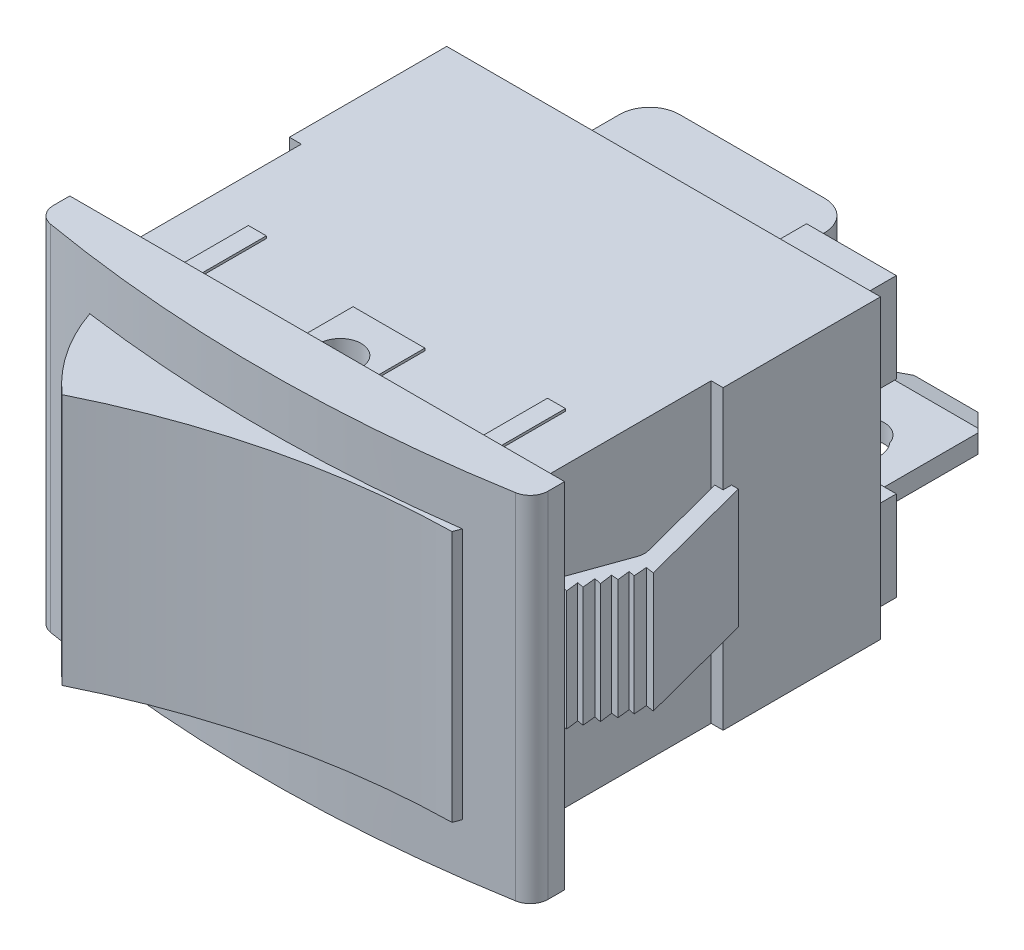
ISO-10303-21;
HEADER;
FILE_DESCRIPTION(('STEP AP214'),'2;1');
FILE_NAME('part.step','',(''),(''),'','','');
FILE_SCHEMA(('AUTOMOTIVE_DESIGN { 1 0 10303 214 1 1 1 1 }'));
ENDSEC;
DATA;
#1=APPLICATION_CONTEXT('core data for automotive mechanical design processes');
#2=APPLICATION_PROTOCOL_DEFINITION('international standard','automotive_design',2000,#1);
#3=PRODUCT_CONTEXT('',#1,'mechanical');
#4=PRODUCT('Part','Part','',(#3));
#5=PRODUCT_RELATED_PRODUCT_CATEGORY('part','',(#4));
#6=PRODUCT_DEFINITION_FORMATION('','',#4);
#7=PRODUCT_DEFINITION_CONTEXT('part definition',#1,'design');
#8=PRODUCT_DEFINITION('design','',#6,#7);
#9=PRODUCT_DEFINITION_SHAPE('','',#8);
#10=(LENGTH_UNIT() NAMED_UNIT(*) SI_UNIT(.MILLI.,.METRE.));
#11=(NAMED_UNIT(*) PLANE_ANGLE_UNIT() SI_UNIT($,.RADIAN.));
#12=(NAMED_UNIT(*) SI_UNIT($,.STERADIAN.) SOLID_ANGLE_UNIT());
#13=UNCERTAINTY_MEASURE_WITH_UNIT(LENGTH_MEASURE(1.E-05),#10,'distance_accuracy_value','');
#14=(GEOMETRIC_REPRESENTATION_CONTEXT(3) GLOBAL_UNCERTAINTY_ASSIGNED_CONTEXT((#13)) GLOBAL_UNIT_ASSIGNED_CONTEXT((#10,
#11,#12)) REPRESENTATION_CONTEXT('',''));
#15=CARTESIAN_POINT('',(0.,0.,0.));
#16=DIRECTION('',(0.,0.,1.));
#17=DIRECTION('',(1.,0.,0.));
#18=AXIS2_PLACEMENT_3D('',#15,#16,#17);
#19=CARTESIAN_POINT('',(9.97271758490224,-2.54,-2.52593317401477));
#20=DIRECTION('',(0.990901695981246,0.,-0.134587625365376));
#21=DIRECTION('',(-0.134587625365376,0.,-0.990901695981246));
#22=AXIS2_PLACEMENT_3D('',#19,#20,#21);
#23=PLANE('',#22);
#24=DIRECTION('',(-0.134587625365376,0.,-0.990901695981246));
#25=VECTOR('',#24,1.);
#26=CARTESIAN_POINT('',(9.97271758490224,2.54,-2.52593317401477));
#27=LINE('',#26,#25);
#28=CARTESIAN_POINT('',(9.97271758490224,2.54,-2.52593317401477));
#29=VERTEX_POINT('',#28);
#30=CARTESIAN_POINT('',(10.0472814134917,2.54,-1.97695681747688));
#31=VERTEX_POINT('',#30);
#32=EDGE_CURVE('E1018',#29,#31,#27,.F.);
#33=ORIENTED_EDGE('',*,*,#32,.T.);
#34=DIRECTION('',(0.,1.,0.));
#35=VECTOR('',#34,1.);
#36=CARTESIAN_POINT('',(10.0472814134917,-2.54,-1.97695681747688));
#37=LINE('',#36,#35);
#38=CARTESIAN_POINT('',(10.0472814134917,-2.54,-1.97695681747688));
#39=VERTEX_POINT('',#38);
#40=EDGE_CURVE('E1028',#39,#31,#37,.T.);
#41=ORIENTED_EDGE('',*,*,#40,.F.);
#42=DIRECTION('',(-0.134587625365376,0.,-0.990901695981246));
#43=VECTOR('',#42,1.);
#44=CARTESIAN_POINT('',(9.97271758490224,-2.54,-2.52593317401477));
#45=LINE('',#44,#43);
#46=CARTESIAN_POINT('',(9.97271758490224,-2.54,-2.52593317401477));
#47=VERTEX_POINT('',#46);
#48=EDGE_CURVE('E1015',#39,#47,#45,.T.);
#49=ORIENTED_EDGE('',*,*,#48,.T.);
#50=DIRECTION('',(0.,1.,0.));
#51=VECTOR('',#50,1.);
#52=CARTESIAN_POINT('',(9.97271758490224,-2.54,-2.52593317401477));
#53=LINE('',#52,#51);
#54=EDGE_CURVE('E1039',#29,#47,#53,.F.);
#55=ORIENTED_EDGE('',*,*,#54,.F.);
#56=EDGE_LOOP('',(#33,#41,#49,#55));
#57=FACE_BOUND('',#56,.T.);
#58=ADVANCED_FACE('F15',(#57),#23,.T.);
#59=CARTESIAN_POINT('',(-9.97271758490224,2.54,-2.52593317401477));
#60=DIRECTION('',(-0.990901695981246,0.,-0.134587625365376));
#61=DIRECTION('',(-0.134587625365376,0.,0.990901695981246));
#62=AXIS2_PLACEMENT_3D('',#59,#60,#61);
#63=PLANE('',#62);
#64=DIRECTION('',(-0.134587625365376,0.,0.990901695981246));
#65=VECTOR('',#64,1.);
#66=CARTESIAN_POINT('',(-9.97271758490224,-2.54,-2.52593317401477));
#67=LINE('',#66,#65);
#68=CARTESIAN_POINT('',(-9.97271758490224,-2.54,-2.52593317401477));
#69=VERTEX_POINT('',#68);
#70=CARTESIAN_POINT('',(-10.0472814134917,-2.54,-1.97695681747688));
#71=VERTEX_POINT('',#70);
#72=EDGE_CURVE('E1023',#69,#71,#67,.T.);
#73=ORIENTED_EDGE('',*,*,#72,.T.);
#74=DIRECTION('',(0.,1.,0.));
#75=VECTOR('',#74,1.);
#76=CARTESIAN_POINT('',(-10.0472814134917,2.54,-1.97695681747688));
#77=LINE('',#76,#75);
#78=CARTESIAN_POINT('',(-10.0472814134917,2.54,-1.97695681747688));
#79=VERTEX_POINT('',#78);
#80=EDGE_CURVE('E1054',#79,#71,#77,.F.);
#81=ORIENTED_EDGE('',*,*,#80,.F.);
#82=DIRECTION('',(-0.134587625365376,0.,0.990901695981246));
#83=VECTOR('',#82,1.);
#84=CARTESIAN_POINT('',(-9.97271758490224,2.54,-2.52593317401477));
#85=LINE('',#84,#83);
#86=CARTESIAN_POINT('',(-9.97271758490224,2.54,-2.52593317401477));
#87=VERTEX_POINT('',#86);
#88=EDGE_CURVE('E1020',#79,#87,#85,.F.);
#89=ORIENTED_EDGE('',*,*,#88,.T.);
#90=DIRECTION('',(0.,1.,0.));
#91=VECTOR('',#90,1.);
#92=CARTESIAN_POINT('',(-9.97271758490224,2.54,-2.52593317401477));
#93=LINE('',#92,#91);
#94=EDGE_CURVE('E1048',#69,#87,#93,.T.);
#95=ORIENTED_EDGE('',*,*,#94,.F.);
#96=EDGE_LOOP('',(#73,#81,#89,#95));
#97=FACE_BOUND('',#96,.T.);
#98=ADVANCED_FACE('F4349',(#97),#63,.T.);
#99=CARTESIAN_POINT('',(10.0472814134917,-2.54,-1.97695681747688));
#100=DIRECTION('',(-0.21039849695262,0.,0.977615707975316));
#101=DIRECTION('',(0.977615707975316,0.,0.21039849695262));
#102=AXIS2_PLACEMENT_3D('',#99,#100,#101);
#103=PLANE('',#102);
#104=DIRECTION('',(0.977615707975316,0.,0.21039849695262));
#105=VECTOR('',#104,1.);
#106=CARTESIAN_POINT('',(10.0472814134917,2.54,-1.97695681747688));
#107=LINE('',#106,#105);
#108=CARTESIAN_POINT('',(9.75187412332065,2.54,-2.04053317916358));
#109=VERTEX_POINT('',#108);
#110=EDGE_CURVE('E1031',#31,#109,#107,.F.);
#111=ORIENTED_EDGE('',*,*,#110,.T.);
#112=DIRECTION('',(0.,1.,0.));
#113=VECTOR('',#112,1.);
#114=CARTESIAN_POINT('',(9.75187412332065,-2.54,-2.04053317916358));
#115=LINE('',#114,#113);
#116=CARTESIAN_POINT('',(9.75187412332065,-2.54,-2.04053317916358));
#117=VERTEX_POINT('',#116);
#118=EDGE_CURVE('E1062',#117,#109,#115,.T.);
#119=ORIENTED_EDGE('',*,*,#118,.F.);
#120=DIRECTION('',(0.977615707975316,0.,0.21039849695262));
#121=VECTOR('',#120,1.);
#122=CARTESIAN_POINT('',(10.0472814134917,-2.54,-1.97695681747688));
#123=LINE('',#122,#121);
#124=EDGE_CURVE('E1025',#117,#39,#123,.T.);
#125=ORIENTED_EDGE('',*,*,#124,.T.);
#126=ORIENTED_EDGE('',*,*,#40,.T.);
#127=EDGE_LOOP('',(#111,#119,#125,#126));
#128=FACE_BOUND('',#127,.T.);
#129=ADVANCED_FACE('F2305',(#128),#103,.T.);
#130=CARTESIAN_POINT('',(10.2725427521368,-2.54,-2.49581240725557));
#131=DIRECTION('',(-0.0999579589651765,0.,0.994991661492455));
#132=DIRECTION('',(0.994991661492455,0.,0.0999579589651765));
#133=AXIS2_PLACEMENT_3D('',#130,#131,#132);
#134=PLANE('',#133);
#135=DIRECTION('',(0.994991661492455,0.,0.0999579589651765));
#136=VECTOR('',#135,1.);
#137=CARTESIAN_POINT('',(10.2725427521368,2.54,-2.49581240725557));
#138=LINE('',#137,#136);
#139=CARTESIAN_POINT('',(10.2725427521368,2.54,-2.49581240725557));
#140=VERTEX_POINT('',#139);
#141=EDGE_CURVE('E1036',#140,#29,#138,.F.);
#142=ORIENTED_EDGE('',*,*,#141,.T.);
#143=ORIENTED_EDGE('',*,*,#54,.T.);
#144=DIRECTION('',(0.994991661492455,0.,0.0999579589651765));
#145=VECTOR('',#144,1.);
#146=CARTESIAN_POINT('',(10.2725427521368,-2.54,-2.49581240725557));
#147=LINE('',#146,#145);
#148=CARTESIAN_POINT('',(10.2725427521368,-2.54,-2.49581240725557));
#149=VERTEX_POINT('',#148);
#150=EDGE_CURVE('E1033',#47,#149,#147,.T.);
#151=ORIENTED_EDGE('',*,*,#150,.T.);
#152=DIRECTION('',(0.,1.,0.));
#153=VECTOR('',#152,1.);
#154=CARTESIAN_POINT('',(10.2725427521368,-2.54,-2.49581240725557));
#155=LINE('',#154,#153);
#156=EDGE_CURVE('E1073',#140,#149,#155,.F.);
#157=ORIENTED_EDGE('',*,*,#156,.F.);
#158=EDGE_LOOP('',(#142,#143,#151,#157));
#159=FACE_BOUND('',#158,.T.);
#160=ADVANCED_FACE('F2297',(#159),#134,.T.);
#161=CARTESIAN_POINT('',(-10.2725427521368,2.54,-2.49581240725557));
#162=DIRECTION('',(0.0999579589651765,0.,0.994991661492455));
#163=DIRECTION('',(0.994991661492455,0.,-0.0999579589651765));
#164=AXIS2_PLACEMENT_3D('',#161,#162,#163);
#165=PLANE('',#164);
#166=DIRECTION('',(0.994991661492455,0.,-0.0999579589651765));
#167=VECTOR('',#166,1.);
#168=CARTESIAN_POINT('',(-10.2725427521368,-2.54,-2.49581240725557));
#169=LINE('',#168,#167);
#170=CARTESIAN_POINT('',(-10.2725427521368,-2.54,-2.49581240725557));
#171=VERTEX_POINT('',#170);
#172=EDGE_CURVE('E1045',#171,#69,#169,.T.);
#173=ORIENTED_EDGE('',*,*,#172,.T.);
#174=ORIENTED_EDGE('',*,*,#94,.T.);
#175=DIRECTION('',(0.994991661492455,0.,-0.0999579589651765));
#176=VECTOR('',#175,1.);
#177=CARTESIAN_POINT('',(-10.2725427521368,2.54,-2.49581240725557));
#178=LINE('',#177,#176);
#179=CARTESIAN_POINT('',(-10.2725427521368,2.54,-2.49581240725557));
#180=VERTEX_POINT('',#179);
#181=EDGE_CURVE('E1042',#87,#180,#178,.F.);
#182=ORIENTED_EDGE('',*,*,#181,.T.);
#183=DIRECTION('',(0.,1.,0.));
#184=VECTOR('',#183,1.);
#185=CARTESIAN_POINT('',(-10.2725427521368,2.54,-2.49581240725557));
#186=LINE('',#185,#184);
#187=EDGE_CURVE('E1082',#171,#180,#186,.T.);
#188=ORIENTED_EDGE('',*,*,#187,.F.);
#189=EDGE_LOOP('',(#173,#174,#182,#188));
#190=FACE_BOUND('',#189,.T.);
#191=ADVANCED_FACE('F4316',(#190),#165,.T.);
#192=CARTESIAN_POINT('',(-10.0472814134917,2.54,-1.97695681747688));
#193=DIRECTION('',(0.21039849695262,0.,0.977615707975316));
#194=DIRECTION('',(0.977615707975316,0.,-0.21039849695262));
#195=AXIS2_PLACEMENT_3D('',#192,#193,#194);
#196=PLANE('',#195);
#197=DIRECTION('',(0.977615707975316,0.,-0.21039849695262));
#198=VECTOR('',#197,1.);
#199=CARTESIAN_POINT('',(-10.0472814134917,-2.54,-1.97695681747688));
#200=LINE('',#199,#198);
#201=CARTESIAN_POINT('',(-9.75187412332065,-2.54,-2.04053317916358));
#202=VERTEX_POINT('',#201);
#203=EDGE_CURVE('E1057',#71,#202,#200,.T.);
#204=ORIENTED_EDGE('',*,*,#203,.T.);
#205=DIRECTION('',(0.,1.,0.));
#206=VECTOR('',#205,1.);
#207=CARTESIAN_POINT('',(-9.75187412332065,2.54,-2.04053317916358));
#208=LINE('',#207,#206);
#209=CARTESIAN_POINT('',(-9.75187412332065,2.54,-2.04053317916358));
#210=VERTEX_POINT('',#209);
#211=EDGE_CURVE('E1088',#210,#202,#208,.F.);
#212=ORIENTED_EDGE('',*,*,#211,.F.);
#213=DIRECTION('',(0.977615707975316,0.,-0.21039849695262));
#214=VECTOR('',#213,1.);
#215=CARTESIAN_POINT('',(-10.0472814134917,2.54,-1.97695681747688));
#216=LINE('',#215,#214);
#217=EDGE_CURVE('E1051',#210,#79,#216,.F.);
#218=ORIENTED_EDGE('',*,*,#217,.T.);
#219=ORIENTED_EDGE('',*,*,#80,.T.);
#220=EDGE_LOOP('',(#204,#212,#218,#219));
#221=FACE_BOUND('',#220,.T.);
#222=ADVANCED_FACE('F4305',(#221),#196,.T.);
#223=CARTESIAN_POINT('',(9.75187412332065,-2.54,-2.04053317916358));
#224=DIRECTION('',(0.995255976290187,0.,-0.0972910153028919));
#225=DIRECTION('',(-0.0972910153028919,0.,-0.995255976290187));
#226=AXIS2_PLACEMENT_3D('',#223,#224,#225);
#227=PLANE('',#226);
#228=DIRECTION('',(-0.0972910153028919,0.,-0.995255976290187));
#229=VECTOR('',#228,1.);
#230=CARTESIAN_POINT('',(9.75187412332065,2.54,-2.04053317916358));
#231=LINE('',#230,#229);
#232=CARTESIAN_POINT('',(9.80665154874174,2.54,-1.48017763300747));
#233=VERTEX_POINT('',#232);
#234=EDGE_CURVE('E1065',#109,#233,#231,.F.);
#235=ORIENTED_EDGE('',*,*,#234,.T.);
#236=DIRECTION('',(0.,1.,0.));
#237=VECTOR('',#236,1.);
#238=CARTESIAN_POINT('',(9.80665154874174,-2.54,-1.48017763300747));
#239=LINE('',#238,#237);
#240=CARTESIAN_POINT('',(9.80665154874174,-2.54,-1.48017763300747));
#241=VERTEX_POINT('',#240);
#242=EDGE_CURVE('E1096',#241,#233,#239,.T.);
#243=ORIENTED_EDGE('',*,*,#242,.F.);
#244=DIRECTION('',(-0.0972910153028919,0.,-0.995255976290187));
#245=VECTOR('',#244,1.);
#246=CARTESIAN_POINT('',(9.75187412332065,-2.54,-2.04053317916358));
#247=LINE('',#246,#245);
#248=EDGE_CURVE('E1059',#241,#117,#247,.T.);
#249=ORIENTED_EDGE('',*,*,#248,.T.);
#250=ORIENTED_EDGE('',*,*,#118,.T.);
#251=EDGE_LOOP('',(#235,#243,#249,#250));
#252=FACE_BOUND('',#251,.T.);
#253=ADVANCED_FACE('F2308',(#252),#227,.T.);
#254=CARTESIAN_POINT('',(10.2130013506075,-2.54,-3.03268309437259));
#255=DIRECTION('',(0.993906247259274,0.,-0.110228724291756));
#256=DIRECTION('',(-0.110228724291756,0.,-0.993906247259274));
#257=AXIS2_PLACEMENT_3D('',#254,#255,#256);
#258=PLANE('',#257);
#259=DIRECTION('',(-0.110228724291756,0.,-0.993906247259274));
#260=VECTOR('',#259,1.);
#261=CARTESIAN_POINT('',(10.2130013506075,2.54,-3.03268309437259));
#262=LINE('',#261,#260);
#263=CARTESIAN_POINT('',(10.2130013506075,2.54,-3.03268309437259));
#264=VERTEX_POINT('',#263);
#265=EDGE_CURVE('E1070',#264,#140,#262,.F.);
#266=ORIENTED_EDGE('',*,*,#265,.T.);
#267=ORIENTED_EDGE('',*,*,#156,.T.);
#268=DIRECTION('',(-0.110228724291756,0.,-0.993906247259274));
#269=VECTOR('',#268,1.);
#270=CARTESIAN_POINT('',(10.2130013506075,-2.54,-3.03268309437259));
#271=LINE('',#270,#269);
#272=CARTESIAN_POINT('',(10.2130013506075,-2.54,-3.03268309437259));
#273=VERTEX_POINT('',#272);
#274=EDGE_CURVE('E1067',#149,#273,#271,.T.);
#275=ORIENTED_EDGE('',*,*,#274,.T.);
#276=DIRECTION('',(0.,1.,0.));
#277=VECTOR('',#276,1.);
#278=CARTESIAN_POINT('',(10.2130013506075,-2.54,-3.03268309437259));
#279=LINE('',#278,#277);
#280=EDGE_CURVE('E1107',#264,#273,#279,.F.);
#281=ORIENTED_EDGE('',*,*,#280,.F.);
#282=EDGE_LOOP('',(#266,#267,#275,#281));
#283=FACE_BOUND('',#282,.T.);
#284=ADVANCED_FACE('F2295',(#283),#258,.T.);
#285=CARTESIAN_POINT('',(-10.2130013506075,2.54,-3.03268309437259));
#286=DIRECTION('',(-0.993906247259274,0.,-0.110228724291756));
#287=DIRECTION('',(-0.110228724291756,0.,0.993906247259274));
#288=AXIS2_PLACEMENT_3D('',#285,#286,#287);
#289=PLANE('',#288);
#290=DIRECTION('',(-0.110228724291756,0.,0.993906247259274));
#291=VECTOR('',#290,1.);
#292=CARTESIAN_POINT('',(-10.2130013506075,-2.54,-3.03268309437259));
#293=LINE('',#292,#291);
#294=CARTESIAN_POINT('',(-10.2130013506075,-2.54,-3.03268309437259));
#295=VERTEX_POINT('',#294);
#296=EDGE_CURVE('E1079',#295,#171,#293,.T.);
#297=ORIENTED_EDGE('',*,*,#296,.T.);
#298=ORIENTED_EDGE('',*,*,#187,.T.);
#299=DIRECTION('',(-0.110228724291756,0.,0.993906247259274));
#300=VECTOR('',#299,1.);
#301=CARTESIAN_POINT('',(-10.2130013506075,2.54,-3.03268309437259));
#302=LINE('',#301,#300);
#303=CARTESIAN_POINT('',(-10.2130013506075,2.54,-3.03268309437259));
#304=VERTEX_POINT('',#303);
#305=EDGE_CURVE('E1076',#180,#304,#302,.F.);
#306=ORIENTED_EDGE('',*,*,#305,.T.);
#307=DIRECTION('',(0.,1.,0.));
#308=VECTOR('',#307,1.);
#309=CARTESIAN_POINT('',(-10.2130013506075,2.54,-3.03268309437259));
#310=LINE('',#309,#308);
#311=EDGE_CURVE('E1118',#295,#304,#310,.T.);
#312=ORIENTED_EDGE('',*,*,#311,.F.);
#313=EDGE_LOOP('',(#297,#298,#306,#312));
#314=FACE_BOUND('',#313,.T.);
#315=ADVANCED_FACE('F4272',(#314),#289,.T.);
#316=CARTESIAN_POINT('',(-9.75187412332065,2.54,-2.04053317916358));
#317=DIRECTION('',(-0.995255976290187,0.,-0.0972910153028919));
#318=DIRECTION('',(-0.0972910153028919,0.,0.995255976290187));
#319=AXIS2_PLACEMENT_3D('',#316,#317,#318);
#320=PLANE('',#319);
#321=DIRECTION('',(-0.0972910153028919,0.,0.995255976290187));
#322=VECTOR('',#321,1.);
#323=CARTESIAN_POINT('',(-9.75187412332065,-2.54,-2.04053317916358));
#324=LINE('',#323,#322);
#325=CARTESIAN_POINT('',(-9.80665154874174,-2.54,-1.48017763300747));
#326=VERTEX_POINT('',#325);
#327=EDGE_CURVE('E1091',#202,#326,#324,.T.);
#328=ORIENTED_EDGE('',*,*,#327,.T.);
#329=DIRECTION('',(0.,1.,0.));
#330=VECTOR('',#329,1.);
#331=CARTESIAN_POINT('',(-9.80665154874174,2.54,-1.48017763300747));
#332=LINE('',#331,#330);
#333=CARTESIAN_POINT('',(-9.80665154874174,2.54,-1.48017763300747));
#334=VERTEX_POINT('',#333);
#335=EDGE_CURVE('E1124',#334,#326,#332,.F.);
#336=ORIENTED_EDGE('',*,*,#335,.F.);
#337=DIRECTION('',(-0.0972910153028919,0.,0.995255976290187));
#338=VECTOR('',#337,1.);
#339=CARTESIAN_POINT('',(-9.75187412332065,2.54,-2.04053317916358));
#340=LINE('',#339,#338);
#341=EDGE_CURVE('E1085',#334,#210,#340,.F.);
#342=ORIENTED_EDGE('',*,*,#341,.T.);
#343=ORIENTED_EDGE('',*,*,#211,.T.);
#344=EDGE_LOOP('',(#328,#336,#342,#343));
#345=FACE_BOUND('',#344,.T.);
#346=ADVANCED_FACE('F4261',(#345),#320,.T.);
#347=CARTESIAN_POINT('',(9.80665154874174,-2.54,-1.48017763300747));
#348=DIRECTION('',(-0.173475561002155,0.,0.984838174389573));
#349=DIRECTION('',(0.984838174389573,0.,0.173475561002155));
#350=AXIS2_PLACEMENT_3D('',#347,#348,#349);
#351=PLANE('',#350);
#352=DIRECTION('',(0.984838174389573,0.,0.173475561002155));
#353=VECTOR('',#352,1.);
#354=CARTESIAN_POINT('',(9.80665154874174,2.54,-1.48017763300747));
#355=LINE('',#354,#353);
#356=CARTESIAN_POINT('',(9.53345764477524,2.54,-1.52829971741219));
#357=VERTEX_POINT('',#356);
#358=EDGE_CURVE('E1099',#233,#357,#355,.F.);
#359=ORIENTED_EDGE('',*,*,#358,.T.);
#360=DIRECTION('',(0.,1.,0.));
#361=VECTOR('',#360,1.);
#362=CARTESIAN_POINT('',(9.53345764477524,-2.54,-1.52829971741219));
#363=LINE('',#362,#361);
#364=CARTESIAN_POINT('',(9.53345764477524,-2.54,-1.52829971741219));
#365=VERTEX_POINT('',#364);
#366=EDGE_CURVE('E1132',#365,#357,#363,.T.);
#367=ORIENTED_EDGE('',*,*,#366,.F.);
#368=DIRECTION('',(0.984838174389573,0.,0.173475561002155));
#369=VECTOR('',#368,1.);
#370=CARTESIAN_POINT('',(9.80665154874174,-2.54,-1.48017763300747));
#371=LINE('',#370,#369);
#372=EDGE_CURVE('E1093',#365,#241,#371,.T.);
#373=ORIENTED_EDGE('',*,*,#372,.T.);
#374=ORIENTED_EDGE('',*,*,#242,.T.);
#375=EDGE_LOOP('',(#359,#367,#373,#374));
#376=FACE_BOUND('',#375,.T.);
#377=ADVANCED_FACE('F2312',(#376),#351,.T.);
#378=CARTESIAN_POINT('',(10.4780052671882,-2.54,-2.97742352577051));
#379=DIRECTION('',(-0.204132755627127,0.,0.978943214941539));
#380=DIRECTION('',(0.978943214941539,0.,0.204132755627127));
#381=AXIS2_PLACEMENT_3D('',#378,#379,#380);
#382=PLANE('',#381);
#383=DIRECTION('',(0.978943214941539,0.,0.204132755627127));
#384=VECTOR('',#383,1.);
#385=CARTESIAN_POINT('',(10.4780052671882,2.54,-2.97742352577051));
#386=LINE('',#385,#384);
#387=CARTESIAN_POINT('',(10.4780052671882,2.54,-2.97742352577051));
#388=VERTEX_POINT('',#387);
#389=EDGE_CURVE('E1104',#388,#264,#386,.F.);
#390=ORIENTED_EDGE('',*,*,#389,.T.);
#391=ORIENTED_EDGE('',*,*,#280,.T.);
#392=DIRECTION('',(0.978943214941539,0.,0.204132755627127));
#393=VECTOR('',#392,1.);
#394=CARTESIAN_POINT('',(10.4780052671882,-2.54,-2.97742352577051));
#395=LINE('',#394,#393);
#396=CARTESIAN_POINT('',(10.4780052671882,-2.54,-2.97742352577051));
#397=VERTEX_POINT('',#396);
#398=EDGE_CURVE('E1101',#273,#397,#395,.T.);
#399=ORIENTED_EDGE('',*,*,#398,.T.);
#400=DIRECTION('',(0.,1.,0.));
#401=VECTOR('',#400,1.);
#402=CARTESIAN_POINT('',(10.4780052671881,-2.54,-2.97742352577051));
#403=LINE('',#402,#401);
#404=EDGE_CURVE('E1142',#388,#397,#403,.F.);
#405=ORIENTED_EDGE('',*,*,#404,.F.);
#406=EDGE_LOOP('',(#390,#391,#399,#405));
#407=FACE_BOUND('',#406,.T.);
#408=ADVANCED_FACE('F2290',(#407),#382,.T.);
#409=CARTESIAN_POINT('',(-3.8481,-2.0955,-22.7076));
#410=DIRECTION('',(0.,0.,-1.));
#411=DIRECTION('',(0.,1.,0.));
#412=AXIS2_PLACEMENT_3D('',#409,#410,#411);
#413=PLANE('',#412);
#414=DIRECTION('',(1.,0.,0.));
#415=VECTOR('',#414,1.);
#416=CARTESIAN_POINT('',(-5.207,-2.35367020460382,-22.7076));
#417=LINE('',#416,#415);
#418=CARTESIAN_POINT('',(-3.8481,-2.35367020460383,-22.7076));
#419=VERTEX_POINT('',#418);
#420=CARTESIAN_POINT('',(-6.5659,-2.35367020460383,-22.7076));
#421=VERTEX_POINT('',#420);
#422=EDGE_CURVE('E1145',#419,#421,#417,.F.);
#423=ORIENTED_EDGE('',*,*,#422,.F.);
#424=DIRECTION('',(0.,1.,0.));
#425=VECTOR('',#424,1.);
#426=CARTESIAN_POINT('',(-3.8481,-2.0955,-22.7076));
#427=LINE('',#426,#425);
#428=CARTESIAN_POINT('',(-3.8481,-2.62472979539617,-22.7076));
#429=VERTEX_POINT('',#428);
#430=EDGE_CURVE('E1110',#419,#429,#427,.F.);
#431=ORIENTED_EDGE('',*,*,#430,.T.);
#432=DIRECTION('',(1.,0.,0.));
#433=VECTOR('',#432,1.);
#434=CARTESIAN_POINT('',(-5.207,-2.62472979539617,-22.7076));
#435=LINE('',#434,#433);
#436=CARTESIAN_POINT('',(-6.5659,-2.62472979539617,-22.7076));
#437=VERTEX_POINT('',#436);
#438=EDGE_CURVE('E1160',#437,#429,#435,.T.);
#439=ORIENTED_EDGE('',*,*,#438,.F.);
#440=DIRECTION('',(0.,1.,0.));
#441=VECTOR('',#440,1.);
#442=CARTESIAN_POINT('',(-6.5659,-2.0955,-22.7076));
#443=LINE('',#442,#441);
#444=EDGE_CURVE('E1155',#421,#437,#443,.F.);
#445=ORIENTED_EDGE('',*,*,#444,.F.);
#446=EDGE_LOOP('',(#423,#431,#439,#445));
#447=FACE_BOUND('',#446,.T.);
#448=ADVANCED_FACE('F4228',(#447),#413,.T.);
#449=CARTESIAN_POINT('',(-10.4780052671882,2.54,-2.97742352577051));
#450=DIRECTION('',(0.204132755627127,0.,0.978943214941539));
#451=DIRECTION('',(0.978943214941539,0.,-0.204132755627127));
#452=AXIS2_PLACEMENT_3D('',#449,#450,#451);
#453=PLANE('',#452);
#454=DIRECTION('',(0.978943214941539,0.,-0.204132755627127));
#455=VECTOR('',#454,1.);
#456=CARTESIAN_POINT('',(-10.4780052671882,-2.54,-2.97742352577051));
#457=LINE('',#456,#455);
#458=CARTESIAN_POINT('',(-10.4780052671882,-2.54,-2.97742352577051));
#459=VERTEX_POINT('',#458);
#460=EDGE_CURVE('E1115',#459,#295,#457,.T.);
#461=ORIENTED_EDGE('',*,*,#460,.T.);
#462=ORIENTED_EDGE('',*,*,#311,.T.);
#463=DIRECTION('',(0.978943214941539,0.,-0.204132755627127));
#464=VECTOR('',#463,1.);
#465=CARTESIAN_POINT('',(-10.4780052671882,2.54,-2.97742352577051));
#466=LINE('',#465,#464);
#467=CARTESIAN_POINT('',(-10.4780052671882,2.54,-2.97742352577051));
#468=VERTEX_POINT('',#467);
#469=EDGE_CURVE('E1112',#304,#468,#466,.F.);
#470=ORIENTED_EDGE('',*,*,#469,.T.);
#471=DIRECTION('',(0.,1.,0.));
#472=VECTOR('',#471,1.);
#473=CARTESIAN_POINT('',(-10.4780052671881,2.54,-2.9774235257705));
#474=LINE('',#473,#472);
#475=EDGE_CURVE('E1180',#459,#468,#474,.T.);
#476=ORIENTED_EDGE('',*,*,#475,.F.);
#477=EDGE_LOOP('',(#461,#462,#470,#476));
#478=FACE_BOUND('',#477,.T.);
#479=ADVANCED_FACE('F4216',(#478),#453,.T.);
#480=CARTESIAN_POINT('',(-9.80665154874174,2.54,-1.48017763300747));
#481=DIRECTION('',(0.173475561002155,0.,0.984838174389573));
#482=DIRECTION('',(0.984838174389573,0.,-0.173475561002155));
#483=AXIS2_PLACEMENT_3D('',#480,#481,#482);
#484=PLANE('',#483);
#485=DIRECTION('',(0.984838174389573,0.,-0.173475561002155));
#486=VECTOR('',#485,1.);
#487=CARTESIAN_POINT('',(-9.80665154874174,-2.54,-1.48017763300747));
#488=LINE('',#487,#486);
#489=CARTESIAN_POINT('',(-9.53345764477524,-2.54,-1.52829971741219));
#490=VERTEX_POINT('',#489);
#491=EDGE_CURVE('E1127',#326,#490,#488,.T.);
#492=ORIENTED_EDGE('',*,*,#491,.T.);
#493=DIRECTION('',(0.,1.,0.));
#494=VECTOR('',#493,1.);
#495=CARTESIAN_POINT('',(-9.53345764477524,2.54,-1.52829971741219));
#496=LINE('',#495,#494);
#497=CARTESIAN_POINT('',(-9.53345764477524,2.54,-1.52829971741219));
#498=VERTEX_POINT('',#497);
#499=EDGE_CURVE('E1186',#498,#490,#496,.F.);
#500=ORIENTED_EDGE('',*,*,#499,.F.);
#501=DIRECTION('',(0.984838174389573,0.,-0.173475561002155));
#502=VECTOR('',#501,1.);
#503=CARTESIAN_POINT('',(-9.80665154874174,2.54,-1.48017763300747));
#504=LINE('',#503,#502);
#505=EDGE_CURVE('E1121',#498,#334,#504,.F.);
#506=ORIENTED_EDGE('',*,*,#505,.T.);
#507=ORIENTED_EDGE('',*,*,#335,.T.);
#508=EDGE_LOOP('',(#492,#500,#506,#507));
#509=FACE_BOUND('',#508,.T.);
#510=ADVANCED_FACE('F4205',(#509),#484,.T.);
#511=CARTESIAN_POINT('',(9.53345764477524,-2.54,-1.52829971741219));
#512=DIRECTION('',(0.99254716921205,0.,-0.121861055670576));
#513=DIRECTION('',(-0.121861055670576,0.,-0.99254716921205));
#514=AXIS2_PLACEMENT_3D('',#511,#512,#513);
#515=PLANE('',#514);
#516=DIRECTION('',(-0.121861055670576,0.,-0.99254716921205));
#517=VECTOR('',#516,1.);
#518=CARTESIAN_POINT('',(9.53345764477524,2.54,-1.52829971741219));
#519=LINE('',#518,#517);
#520=CARTESIAN_POINT('',(9.59915077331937,2.54,-0.993235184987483));
#521=VERTEX_POINT('',#520);
#522=EDGE_CURVE('E1135',#357,#521,#519,.F.);
#523=ORIENTED_EDGE('',*,*,#522,.T.);
#524=DIRECTION('',(0.,1.,0.));
#525=VECTOR('',#524,1.);
#526=CARTESIAN_POINT('',(9.59915077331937,-2.54,-0.993235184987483));
#527=LINE('',#526,#525);
#528=CARTESIAN_POINT('',(9.59915077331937,-2.54,-0.993235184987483));
#529=VERTEX_POINT('',#528);
#530=EDGE_CURVE('E1198',#529,#521,#527,.T.);
#531=ORIENTED_EDGE('',*,*,#530,.F.);
#532=DIRECTION('',(-0.121861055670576,0.,-0.99254716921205));
#533=VECTOR('',#532,1.);
#534=CARTESIAN_POINT('',(9.53345764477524,-2.54,-1.52829971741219));
#535=LINE('',#534,#533);
#536=EDGE_CURVE('E1129',#529,#365,#535,.T.);
#537=ORIENTED_EDGE('',*,*,#536,.T.);
#538=ORIENTED_EDGE('',*,*,#366,.T.);
#539=EDGE_LOOP('',(#523,#531,#537,#538));
#540=FACE_BOUND('',#539,.T.);
#541=ADVANCED_FACE('F2317',(#540),#515,.T.);
#542=CARTESIAN_POINT('',(10.4295740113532,-2.54,-3.54440862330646));
#543=DIRECTION('',(0.996371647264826,0.,-0.0851089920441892));
#544=DIRECTION('',(-0.0851089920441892,0.,-0.996371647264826));
#545=AXIS2_PLACEMENT_3D('',#542,#543,#544);
#546=PLANE('',#545);
#547=DIRECTION('',(-0.0851089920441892,0.,-0.996371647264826));
#548=VECTOR('',#547,1.);
#549=CARTESIAN_POINT('',(10.4295740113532,2.54,-3.54440862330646));
#550=LINE('',#549,#548);
#551=CARTESIAN_POINT('',(10.4295740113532,2.54,-3.54440862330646));
#552=VERTEX_POINT('',#551);
#553=EDGE_CURVE('E1139',#552,#388,#550,.F.);
#554=ORIENTED_EDGE('',*,*,#553,.T.);
#555=ORIENTED_EDGE('',*,*,#404,.T.);
#556=DIRECTION('',(-0.0851089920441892,0.,-0.996371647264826));
#557=VECTOR('',#556,1.);
#558=CARTESIAN_POINT('',(10.4295740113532,-2.54,-3.54440862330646));
#559=LINE('',#558,#557);
#560=CARTESIAN_POINT('',(10.4295740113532,-2.54,-3.54440862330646));
#561=VERTEX_POINT('',#560);
#562=EDGE_CURVE('E1137',#397,#561,#559,.T.);
#563=ORIENTED_EDGE('',*,*,#562,.T.);
#564=DIRECTION('',(0.,1.,0.));
#565=VECTOR('',#564,1.);
#566=CARTESIAN_POINT('',(10.4295740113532,-2.54,-3.54440862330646));
#567=LINE('',#566,#565);
#568=EDGE_CURVE('E1203',#552,#561,#567,.F.);
#569=ORIENTED_EDGE('',*,*,#568,.F.);
#570=EDGE_LOOP('',(#554,#555,#563,#569));
#571=FACE_BOUND('',#570,.T.);
#572=ADVANCED_FACE('F2292',(#571),#546,.T.);
#573=CARTESIAN_POINT('',(-5.207,-2.38539643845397,-22.8113718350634));
#574=DIRECTION('',(0.,0.956304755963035,-0.292371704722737));
#575=DIRECTION('',(0.,0.292371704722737,0.956304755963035));
#576=AXIS2_PLACEMENT_3D('',#573,#574,#575);
#577=PLANE('',#576);
#578=DIRECTION('',(0.691140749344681,0.211302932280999,0.691140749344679));
#579=VECTOR('',#578,1.);
#580=CARTESIAN_POINT('',(-3.8481,-2.35367020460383,-22.7076));
#581=LINE('',#580,#579);
#582=CARTESIAN_POINT('',(-3.00366331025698,-2.0955,-21.863163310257));
#583=VERTEX_POINT('',#582);
#584=EDGE_CURVE('E1166',#419,#583,#581,.T.);
#585=ORIENTED_EDGE('',*,*,#584,.F.);
#586=ORIENTED_EDGE('',*,*,#422,.T.);
#587=DIRECTION('',(0.69114074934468,-0.211302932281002,-0.691140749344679));
#588=VECTOR('',#587,1.);
#589=CARTESIAN_POINT('',(-7.410336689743,-2.0955,-21.863163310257));
#590=LINE('',#589,#588);
#591=CARTESIAN_POINT('',(-7.41033668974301,-2.0955,-21.863163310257));
#592=VERTEX_POINT('',#591);
#593=EDGE_CURVE('E1152',#592,#421,#590,.T.);
#594=ORIENTED_EDGE('',*,*,#593,.F.);
#595=DIRECTION('',(1.,0.,0.));
#596=VECTOR('',#595,1.);
#597=CARTESIAN_POINT('',(-5.207,-2.0955,-21.863163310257));
#598=LINE('',#597,#596);
#599=EDGE_CURVE('E1312',#592,#583,#598,.T.);
#600=ORIENTED_EDGE('',*,*,#599,.T.);
#601=EDGE_LOOP('',(#585,#586,#594,#600));
#602=FACE_BOUND('',#601,.T.);
#603=ADVANCED_FACE('F4172',(#602),#577,.T.);
#604=CARTESIAN_POINT('',(-7.5819,-2.0955,-21.6916));
#605=DIRECTION('',(-1.,0.,0.));
#606=DIRECTION('',(0.,-1.,0.));
#607=AXIS2_PLACEMENT_3D('',#604,#605,#606);
#608=PLANE('',#607);
#609=DIRECTION('',(0.,-1.,0.));
#610=VECTOR('',#609,1.);
#611=CARTESIAN_POINT('',(-7.5819,-2.0955,-16.2052));
#612=LINE('',#611,#610);
#613=CARTESIAN_POINT('',(-7.5819,-2.8829,-16.2052));
#614=VERTEX_POINT('',#613);
#615=CARTESIAN_POINT('',(-7.5819,-2.0955,-16.2052));
#616=VERTEX_POINT('',#615);
#617=EDGE_CURVE('E1147',#614,#616,#612,.F.);
#618=ORIENTED_EDGE('',*,*,#617,.T.);
#619=DIRECTION('',(0.,0.,-1.));
#620=VECTOR('',#619,1.);
#621=CARTESIAN_POINT('',(-7.5819,-2.0955,-14.7066));
#622=LINE('',#621,#620);
#623=CARTESIAN_POINT('',(-7.5819,-2.0955,-21.6916));
#624=VERTEX_POINT('',#623);
#625=EDGE_CURVE('E1307',#616,#624,#622,.T.);
#626=ORIENTED_EDGE('',*,*,#625,.T.);
#627=DIRECTION('',(0.,1.,0.));
#628=VECTOR('',#627,1.);
#629=CARTESIAN_POINT('',(-7.5819,-2.0955,-21.6916));
#630=LINE('',#629,#628);
#631=CARTESIAN_POINT('',(-7.5819,-2.8829,-21.6916));
#632=VERTEX_POINT('',#631);
#633=EDGE_CURVE('E1149',#632,#624,#630,.T.);
#634=ORIENTED_EDGE('',*,*,#633,.F.);
#635=DIRECTION('',(0.,0.,-1.));
#636=VECTOR('',#635,1.);
#637=CARTESIAN_POINT('',(-7.5819,-2.8829,-14.7066));
#638=LINE('',#637,#636);
#639=EDGE_CURVE('E890',#614,#632,#638,.T.);
#640=ORIENTED_EDGE('',*,*,#639,.F.);
#641=EDGE_LOOP('',(#618,#626,#634,#640));
#642=FACE_BOUND('',#641,.T.);
#643=ADVANCED_FACE('F4160',(#642),#608,.T.);
#644=CARTESIAN_POINT('',(-6.5659,-2.0955,-22.7076));
#645=DIRECTION('',(-0.707106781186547,0.,-0.707106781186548));
#646=DIRECTION('',(-0.707106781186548,0.,0.707106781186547));
#647=AXIS2_PLACEMENT_3D('',#644,#645,#646);
#648=PLANE('',#647);
#649=DIRECTION('',(0.691140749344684,0.211302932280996,-0.691140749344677));
#650=VECTOR('',#649,1.);
#651=CARTESIAN_POINT('',(-7.41033668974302,-2.88289999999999,-21.863163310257));
#652=LINE('',#651,#650);
#653=CARTESIAN_POINT('',(-7.41033668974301,-2.8829,-21.863163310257));
#654=VERTEX_POINT('',#653);
#655=EDGE_CURVE('E1157',#654,#437,#652,.T.);
#656=ORIENTED_EDGE('',*,*,#655,.F.);
#657=DIRECTION('',(0.707106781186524,0.,-0.707106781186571));
#658=VECTOR('',#657,1.);
#659=CARTESIAN_POINT('',(-7.5819,-2.8829,-21.6916));
#660=LINE('',#659,#658);
#661=EDGE_CURVE('E892',#632,#654,#660,.T.);
#662=ORIENTED_EDGE('',*,*,#661,.F.);
#663=ORIENTED_EDGE('',*,*,#633,.T.);
#664=DIRECTION('',(0.70710678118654,0.,-0.707106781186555));
#665=VECTOR('',#664,1.);
#666=CARTESIAN_POINT('',(-7.5819,-2.0955,-21.6916));
#667=LINE('',#666,#665);
#668=EDGE_CURVE('E1309',#624,#592,#667,.T.);
#669=ORIENTED_EDGE('',*,*,#668,.T.);
#670=ORIENTED_EDGE('',*,*,#593,.T.);
#671=ORIENTED_EDGE('',*,*,#444,.T.);
#672=EDGE_LOOP('',(#656,#662,#663,#669,#670,#671));
#673=FACE_BOUND('',#672,.T.);
#674=ADVANCED_FACE('F4148',(#673),#648,.T.);
#675=CARTESIAN_POINT('',(-5.207,-2.59300356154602,-22.8113718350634));
#676=DIRECTION('',(0.,-0.956304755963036,-0.292371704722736));
#677=DIRECTION('',(0.,0.292371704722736,-0.956304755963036));
#678=AXIS2_PLACEMENT_3D('',#675,#676,#677);
#679=PLANE('',#678);
#680=DIRECTION('',(-0.691140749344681,0.211302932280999,-0.69114074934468));
#681=VECTOR('',#680,1.);
#682=CARTESIAN_POINT('',(-3.00366331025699,-2.88289999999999,-21.863163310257));
#683=LINE('',#682,#681);
#684=CARTESIAN_POINT('',(-3.00366331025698,-2.88289999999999,-21.863163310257));
#685=VERTEX_POINT('',#684);
#686=EDGE_CURVE('E1163',#685,#429,#683,.T.);
#687=ORIENTED_EDGE('',*,*,#686,.F.);
#688=DIRECTION('',(1.,0.,0.));
#689=VECTOR('',#688,1.);
#690=CARTESIAN_POINT('',(-5.207,-2.8829,-21.863163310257));
#691=LINE('',#690,#689);
#692=EDGE_CURVE('E1320',#654,#685,#691,.T.);
#693=ORIENTED_EDGE('',*,*,#692,.F.);
#694=ORIENTED_EDGE('',*,*,#655,.T.);
#695=ORIENTED_EDGE('',*,*,#438,.T.);
#696=EDGE_LOOP('',(#687,#693,#694,#695));
#697=FACE_BOUND('',#696,.T.);
#698=ADVANCED_FACE('F4136',(#697),#679,.T.);
#699=CARTESIAN_POINT('',(-2.8321,-2.0955,-21.6916));
#700=DIRECTION('',(0.707106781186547,0.,-0.707106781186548));
#701=DIRECTION('',(-0.707106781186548,0.,-0.707106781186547));
#702=AXIS2_PLACEMENT_3D('',#699,#700,#701);
#703=PLANE('',#702);
#704=DIRECTION('',(0.,1.,0.));
#705=VECTOR('',#704,1.);
#706=CARTESIAN_POINT('',(-2.8321,-2.0955,-21.6916));
#707=LINE('',#706,#705);
#708=CARTESIAN_POINT('',(-2.8321,-2.8829,-21.6916));
#709=VERTEX_POINT('',#708);
#710=CARTESIAN_POINT('',(-2.8321,-2.0955,-21.6916));
#711=VERTEX_POINT('',#710);
#712=EDGE_CURVE('E1169',#709,#711,#707,.T.);
#713=ORIENTED_EDGE('',*,*,#712,.F.);
#714=DIRECTION('',(0.707106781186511,0.,0.707106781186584));
#715=VECTOR('',#714,1.);
#716=CARTESIAN_POINT('',(-3.00366331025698,-2.8829,-21.863163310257));
#717=LINE('',#716,#715);
#718=EDGE_CURVE('E1323',#685,#709,#717,.T.);
#719=ORIENTED_EDGE('',*,*,#718,.F.);
#720=ORIENTED_EDGE('',*,*,#686,.T.);
#721=ORIENTED_EDGE('',*,*,#430,.F.);
#722=ORIENTED_EDGE('',*,*,#584,.T.);
#723=DIRECTION('',(0.707106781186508,0.,0.707106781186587));
#724=VECTOR('',#723,1.);
#725=CARTESIAN_POINT('',(-3.00366331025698,-2.0955,-21.863163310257));
#726=LINE('',#725,#724);
#727=EDGE_CURVE('E1314',#583,#711,#726,.T.);
#728=ORIENTED_EDGE('',*,*,#727,.T.);
#729=EDGE_LOOP('',(#713,#719,#720,#721,#722,#728));
#730=FACE_BOUND('',#729,.T.);
#731=ADVANCED_FACE('F4124',(#730),#703,.T.);
#732=CARTESIAN_POINT('',(-2.8321,-2.0955,-7.7216));
#733=DIRECTION('',(1.,0.,0.));
#734=DIRECTION('',(0.,1.,0.));
#735=AXIS2_PLACEMENT_3D('',#732,#733,#734);
#736=PLANE('',#735);
#737=DIRECTION('',(0.,1.,0.));
#738=VECTOR('',#737,1.);
#739=CARTESIAN_POINT('',(-2.8321,-2.0955,-16.2052));
#740=LINE('',#739,#738);
#741=CARTESIAN_POINT('',(-2.8321,-2.0955,-16.2052));
#742=VERTEX_POINT('',#741);
#743=CARTESIAN_POINT('',(-2.8321,-2.8829,-16.2052));
#744=VERTEX_POINT('',#743);
#745=EDGE_CURVE('E886',#742,#744,#740,.F.);
#746=ORIENTED_EDGE('',*,*,#745,.T.);
#747=DIRECTION('',(0.,0.,-1.));
#748=VECTOR('',#747,1.);
#749=CARTESIAN_POINT('',(-2.8321,-2.8829,-14.7066));
#750=LINE('',#749,#748);
#751=EDGE_CURVE('E897',#709,#744,#750,.F.);
#752=ORIENTED_EDGE('',*,*,#751,.F.);
#753=ORIENTED_EDGE('',*,*,#712,.T.);
#754=DIRECTION('',(0.,0.,-1.));
#755=VECTOR('',#754,1.);
#756=CARTESIAN_POINT('',(-2.8321,-2.0955,-14.7066));
#757=LINE('',#756,#755);
#758=EDGE_CURVE('E880',#711,#742,#757,.F.);
#759=ORIENTED_EDGE('',*,*,#758,.T.);
#760=EDGE_LOOP('',(#746,#752,#753,#759));
#761=FACE_BOUND('',#760,.T.);
#762=ADVANCED_FACE('F4113',(#761),#736,.T.);
#763=CARTESIAN_POINT('',(-5.207,-2.4892,-18.7071));
#764=DIRECTION('',(0.,-1.,0.));
#765=DIRECTION('',(1.,0.,0.));
#766=AXIS2_PLACEMENT_3D('',#763,#764,#765);
#767=CYLINDRICAL_SURFACE('',#766,1.143);
#768=DIRECTION('',(0.,-1.,0.));
#769=VECTOR('',#768,1.);
#770=CARTESIAN_POINT('',(-4.33839520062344,-2.4892,-19.45005));
#771=LINE('',#770,#769);
#772=CARTESIAN_POINT('',(-4.33839520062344,-2.0955,-19.45005));
#773=VERTEX_POINT('',#772);
#774=CARTESIAN_POINT('',(-4.33839520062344,-2.8829,-19.45005));
#775=VERTEX_POINT('',#774);
#776=EDGE_CURVE('E875',#773,#775,#771,.T.);
#777=ORIENTED_EDGE('',*,*,#776,.T.);
#778=CARTESIAN_POINT('',(-5.207,-2.8829,-18.7071));
#779=DIRECTION('',(0.,-1.,0.));
#780=DIRECTION('',(1.,0.,0.));
#781=AXIS2_PLACEMENT_3D('',#778,#779,#780);
#782=CIRCLE('',#781,1.143);
#783=CARTESIAN_POINT('',(-6.07560479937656,-2.8829,-19.45005));
#784=VERTEX_POINT('',#783);
#785=EDGE_CURVE('E895',#784,#775,#782,.F.);
#786=ORIENTED_EDGE('',*,*,#785,.F.);
#787=DIRECTION('',(0.,-1.,0.));
#788=VECTOR('',#787,1.);
#789=CARTESIAN_POINT('',(-6.07560479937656,-2.4892,-19.45005));
#790=LINE('',#789,#788);
#791=CARTESIAN_POINT('',(-6.07560479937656,-2.0955,-19.45005));
#792=VERTEX_POINT('',#791);
#793=EDGE_CURVE('E870',#784,#792,#790,.F.);
#794=ORIENTED_EDGE('',*,*,#793,.T.);
#795=CARTESIAN_POINT('',(-5.207,-2.0955,-18.7071));
#796=DIRECTION('',(0.,-1.,0.));
#797=DIRECTION('',(1.,0.,0.));
#798=AXIS2_PLACEMENT_3D('',#795,#796,#797);
#799=CIRCLE('',#798,1.143);
#800=EDGE_CURVE('E18',#792,#773,#799,.F.);
#801=ORIENTED_EDGE('',*,*,#800,.T.);
#802=EDGE_LOOP('',(#777,#786,#794,#801));
#803=FACE_BOUND('',#802,.T.);
#804=ADVANCED_FACE('F874',(#803),#767,.F.);
#805=CARTESIAN_POINT('',(-5.207,-2.4892,-19.1643));
#806=DIRECTION('',(0.,-1.,0.));
#807=DIRECTION('',(1.,0.,0.));
#808=AXIS2_PLACEMENT_3D('',#805,#806,#807);
#809=CYLINDRICAL_SURFACE('',#808,0.914399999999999);
#810=ORIENTED_EDGE('',*,*,#793,.F.);
#811=CARTESIAN_POINT('',(-5.207,-2.8829,-19.1643));
#812=DIRECTION('',(0.,-1.,0.));
#813=DIRECTION('',(1.,0.,0.));
#814=AXIS2_PLACEMENT_3D('',#811,#812,#813);
#815=CIRCLE('',#814,0.914399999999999);
#816=EDGE_CURVE('E884',#775,#784,#815,.F.);
#817=ORIENTED_EDGE('',*,*,#816,.F.);
#818=ORIENTED_EDGE('',*,*,#776,.F.);
#819=CARTESIAN_POINT('',(-5.207,-2.0955,-19.1643));
#820=DIRECTION('',(0.,-1.,0.));
#821=DIRECTION('',(1.,0.,0.));
#822=AXIS2_PLACEMENT_3D('',#819,#820,#821);
#823=CIRCLE('',#822,0.914399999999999);
#824=EDGE_CURVE('E879',#773,#792,#823,.F.);
#825=ORIENTED_EDGE('',*,*,#824,.T.);
#826=EDGE_LOOP('',(#810,#817,#818,#825));
#827=FACE_BOUND('',#826,.T.);
#828=ADVANCED_FACE('F882',(#827),#809,.F.);
#829=CARTESIAN_POINT('',(-10.4295740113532,2.54,-3.54440862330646));
#830=DIRECTION('',(-0.996371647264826,0.,-0.0851089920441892));
#831=DIRECTION('',(-0.0851089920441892,0.,0.996371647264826));
#832=AXIS2_PLACEMENT_3D('',#829,#830,#831);
#833=PLANE('',#832);
#834=DIRECTION('',(-0.0851089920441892,0.,0.996371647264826));
#835=VECTOR('',#834,1.);
#836=CARTESIAN_POINT('',(-10.4295740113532,-2.54,-3.54440862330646));
#837=LINE('',#836,#835);
#838=CARTESIAN_POINT('',(-10.4295740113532,-2.54,-3.54440862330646));
#839=VERTEX_POINT('',#838);
#840=EDGE_CURVE('E1177',#839,#459,#837,.T.);
#841=ORIENTED_EDGE('',*,*,#840,.T.);
#842=ORIENTED_EDGE('',*,*,#475,.T.);
#843=DIRECTION('',(-0.0851089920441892,0.,0.996371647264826));
#844=VECTOR('',#843,1.);
#845=CARTESIAN_POINT('',(-10.4295740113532,2.54,-3.54440862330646));
#846=LINE('',#845,#844);
#847=CARTESIAN_POINT('',(-10.4295740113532,2.54,-3.54440862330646));
#848=VERTEX_POINT('',#847);
#849=EDGE_CURVE('E1173',#468,#848,#846,.F.);
#850=ORIENTED_EDGE('',*,*,#849,.T.);
#851=DIRECTION('',(0.,1.,0.));
#852=VECTOR('',#851,1.);
#853=CARTESIAN_POINT('',(-10.4295740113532,2.54,-3.54440862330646));
#854=LINE('',#853,#852);
#855=EDGE_CURVE('E1332',#839,#848,#854,.T.);
#856=ORIENTED_EDGE('',*,*,#855,.F.);
#857=EDGE_LOOP('',(#841,#842,#850,#856));
#858=FACE_BOUND('',#857,.T.);
#859=ADVANCED_FACE('F4080',(#858),#833,.T.);
#860=CARTESIAN_POINT('',(-9.53345764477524,2.54,-1.52829971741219));
#861=DIRECTION('',(-0.99254716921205,0.,-0.121861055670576));
#862=DIRECTION('',(-0.121861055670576,0.,0.99254716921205));
#863=AXIS2_PLACEMENT_3D('',#860,#861,#862);
#864=PLANE('',#863);
#865=DIRECTION('',(-0.121861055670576,0.,0.99254716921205));
#866=VECTOR('',#865,1.);
#867=CARTESIAN_POINT('',(-9.53345764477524,-2.54,-1.52829971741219));
#868=LINE('',#867,#866);
#869=CARTESIAN_POINT('',(-9.59915077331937,-2.54,-0.993235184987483));
#870=VERTEX_POINT('',#869);
#871=EDGE_CURVE('E1189',#490,#870,#868,.T.);
#872=ORIENTED_EDGE('',*,*,#871,.T.);
#873=DIRECTION('',(0.,1.,0.));
#874=VECTOR('',#873,1.);
#875=CARTESIAN_POINT('',(-9.59915077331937,2.54,-0.993235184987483));
#876=LINE('',#875,#874);
#877=CARTESIAN_POINT('',(-9.59915077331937,2.54,-0.993235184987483));
#878=VERTEX_POINT('',#877);
#879=EDGE_CURVE('E1338',#878,#870,#876,.F.);
#880=ORIENTED_EDGE('',*,*,#879,.F.);
#881=DIRECTION('',(-0.121861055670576,0.,0.99254716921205));
#882=VECTOR('',#881,1.);
#883=CARTESIAN_POINT('',(-9.53345764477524,2.54,-1.52829971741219));
#884=LINE('',#883,#882);
#885=EDGE_CURVE('E1183',#878,#498,#884,.F.);
#886=ORIENTED_EDGE('',*,*,#885,.T.);
#887=ORIENTED_EDGE('',*,*,#499,.T.);
#888=EDGE_LOOP('',(#872,#880,#886,#887));
#889=FACE_BOUND('',#888,.T.);
#890=ADVANCED_FACE('F4068',(#889),#864,.T.);
#891=CARTESIAN_POINT('',(8.31537174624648,5.3467,33.162242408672));
#892=DIRECTION('',(0.,1.,0.));
#893=DIRECTION('',(0.,0.,1.));
#894=AXIS2_PLACEMENT_3D('',#891,#892,#893);
#895=CYLINDRICAL_SURFACE('',#894,31.1000362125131);
#896=CARTESIAN_POINT('',(8.31537174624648,5.3467,33.162242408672));
#897=DIRECTION('',(0.,1.,0.));
#898=DIRECTION('',(0.,0.,1.));
#899=AXIS2_PLACEMENT_3D('',#896,#897,#898);
#900=CIRCLE('',#899,31.1000362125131);
#901=CARTESIAN_POINT('',(7.7916089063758,5.3467,2.06661691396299));
#902=VERTEX_POINT('',#901);
#903=CARTESIAN_POINT('',(-5.51889212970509,5.3467,5.30860000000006));
#904=VERTEX_POINT('',#903);
#905=EDGE_CURVE('E908',#902,#904,#900,.T.);
#906=ORIENTED_EDGE('',*,*,#905,.T.);
#907=DIRECTION('',(0.,1.,0.));
#908=VECTOR('',#907,1.);
#909=CARTESIAN_POINT('',(-5.51889212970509,5.3467,5.30860000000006));
#910=LINE('',#909,#908);
#911=CARTESIAN_POINT('',(-5.51889212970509,-5.3467,5.30860000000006));
#912=VERTEX_POINT('',#911);
#913=EDGE_CURVE('E903',#912,#904,#910,.T.);
#914=ORIENTED_EDGE('',*,*,#913,.F.);
#915=CARTESIAN_POINT('',(8.31537174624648,-5.3467,33.162242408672));
#916=DIRECTION('',(0.,1.,0.));
#917=DIRECTION('',(0.,0.,1.));
#918=AXIS2_PLACEMENT_3D('',#915,#916,#917);
#919=CIRCLE('',#918,31.1000362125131);
#920=CARTESIAN_POINT('',(7.7916089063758,-5.3467,2.06661691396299));
#921=VERTEX_POINT('',#920);
#922=EDGE_CURVE('E900',#921,#912,#919,.T.);
#923=ORIENTED_EDGE('',*,*,#922,.F.);
#924=DIRECTION('',(0.,1.,0.));
#925=VECTOR('',#924,1.);
#926=CARTESIAN_POINT('',(7.7916089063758,5.3467,2.06661691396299));
#927=LINE('',#926,#925);
#928=EDGE_CURVE('E912',#902,#921,#927,.F.);
#929=ORIENTED_EDGE('',*,*,#928,.F.);
#930=EDGE_LOOP('',(#906,#914,#923,#929));
#931=FACE_BOUND('',#930,.T.);
#932=ADVANCED_FACE('F4057',(#931),#895,.F.);
#933=CARTESIAN_POINT('',(9.59915077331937,-2.54,-0.993235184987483));
#934=DIRECTION('',(-0.152101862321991,0.,0.988364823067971));
#935=DIRECTION('',(0.988364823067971,0.,0.152101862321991));
#936=AXIS2_PLACEMENT_3D('',#933,#934,#935);
#937=PLANE('',#936);
#938=DIRECTION('',(0.988364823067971,0.,0.152101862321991));
#939=VECTOR('',#938,1.);
#940=CARTESIAN_POINT('',(9.59915077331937,2.54,-0.993235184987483));
#941=LINE('',#940,#939);
#942=CARTESIAN_POINT('',(9.28320321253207,2.54,-1.04185712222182));
#943=VERTEX_POINT('',#942);
#944=EDGE_CURVE('E1201',#521,#943,#941,.F.);
#945=ORIENTED_EDGE('',*,*,#944,.T.);
#946=DIRECTION('',(0.,1.,0.));
#947=VECTOR('',#946,1.);
#948=CARTESIAN_POINT('',(9.28320321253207,-2.54,-1.04185712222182));
#949=LINE('',#948,#947);
#950=CARTESIAN_POINT('',(9.28320321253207,-2.54,-1.04185712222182));
#951=VERTEX_POINT('',#950);
#952=EDGE_CURVE('E1389',#951,#943,#949,.T.);
#953=ORIENTED_EDGE('',*,*,#952,.F.);
#954=DIRECTION('',(0.988364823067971,0.,0.152101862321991));
#955=VECTOR('',#954,1.);
#956=CARTESIAN_POINT('',(9.59915077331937,-2.54,-0.993235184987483));
#957=LINE('',#956,#955);
#958=EDGE_CURVE('E1191',#951,#529,#957,.T.);
#959=ORIENTED_EDGE('',*,*,#958,.T.);
#960=ORIENTED_EDGE('',*,*,#530,.T.);
#961=EDGE_LOOP('',(#945,#953,#959,#960));
#962=FACE_BOUND('',#961,.T.);
#963=ADVANCED_FACE('F2321',(#962),#937,.T.);
#964=CARTESIAN_POINT('',(10.7784756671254,-2.54,-3.49076247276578));
#965=DIRECTION('',(-0.151971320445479,0.,0.988384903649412));
#966=DIRECTION('',(0.988384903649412,0.,0.151971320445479));
#967=AXIS2_PLACEMENT_3D('',#964,#965,#966);
#968=PLANE('',#967);
#969=DIRECTION('',(0.988384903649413,0.,0.151971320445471));
#970=VECTOR('',#969,1.);
#971=CARTESIAN_POINT('',(10.4295740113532,2.54,-3.54440862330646));
#972=LINE('',#971,#970);
#973=CARTESIAN_POINT('',(10.7784756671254,2.54,-3.49076247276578));
#974=VERTEX_POINT('',#973);
#975=EDGE_CURVE('E1264',#552,#974,#972,.T.);
#976=ORIENTED_EDGE('',*,*,#975,.F.);
#977=ORIENTED_EDGE('',*,*,#568,.T.);
#978=DIRECTION('',(0.988384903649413,0.,0.15197132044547));
#979=VECTOR('',#978,1.);
#980=CARTESIAN_POINT('',(10.4295740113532,-2.54,-3.54440862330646));
#981=LINE('',#980,#979);
#982=CARTESIAN_POINT('',(10.7784756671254,-2.54,-3.49076247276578));
#983=VERTEX_POINT('',#982);
#984=EDGE_CURVE('E1223',#561,#983,#981,.T.);
#985=ORIENTED_EDGE('',*,*,#984,.T.);
#986=DIRECTION('',(0.,1.,0.));
#987=VECTOR('',#986,1.);
#988=CARTESIAN_POINT('',(10.7784756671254,-2.54,-3.49076247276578));
#989=LINE('',#988,#987);
#990=EDGE_CURVE('E1257',#974,#983,#989,.F.);
#991=ORIENTED_EDGE('',*,*,#990,.F.);
#992=EDGE_LOOP('',(#976,#977,#985,#991));
#993=FACE_BOUND('',#992,.T.);
#994=ADVANCED_FACE('F2285',(#993),#968,.T.);
#995=CARTESIAN_POINT('',(5.3467,-3.6195,-22.7076));
#996=DIRECTION('',(0.,0.,-1.));
#997=DIRECTION('',(0.,1.,0.));
#998=AXIS2_PLACEMENT_3D('',#995,#996,#997);
#999=PLANE('',#998);
#1000=DIRECTION('',(1.,0.,0.));
#1001=VECTOR('',#1000,1.);
#1002=CARTESIAN_POINT('',(3.9878,-3.87767020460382,-22.7076));
#1003=LINE('',#1002,#1001);
#1004=CARTESIAN_POINT('',(5.3467,-3.87767020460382,-22.7076));
#1005=VERTEX_POINT('',#1004);
#1006=CARTESIAN_POINT('',(2.6289,-3.87767020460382,-22.7076));
#1007=VERTEX_POINT('',#1006);
#1008=EDGE_CURVE('E1303',#1005,#1007,#1003,.F.);
#1009=ORIENTED_EDGE('',*,*,#1008,.F.);
#1010=DIRECTION('',(0.,1.,0.));
#1011=VECTOR('',#1010,1.);
#1012=CARTESIAN_POINT('',(5.3467,-3.6195,-22.7076));
#1013=LINE('',#1012,#1011);
#1014=CARTESIAN_POINT('',(5.3467,-4.14872979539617,-22.7076));
#1015=VERTEX_POINT('',#1014);
#1016=EDGE_CURVE('E1280',#1005,#1015,#1013,.F.);
#1017=ORIENTED_EDGE('',*,*,#1016,.T.);
#1018=DIRECTION('',(1.,0.,0.));
#1019=VECTOR('',#1018,1.);
#1020=CARTESIAN_POINT('',(3.9878,-4.14872979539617,-22.7076));
#1021=LINE('',#1020,#1019);
#1022=CARTESIAN_POINT('',(2.6289,-4.14872979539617,-22.7076));
#1023=VERTEX_POINT('',#1022);
#1024=EDGE_CURVE('E1438',#1023,#1015,#1021,.T.);
#1025=ORIENTED_EDGE('',*,*,#1024,.F.);
#1026=DIRECTION('',(0.,1.,0.));
#1027=VECTOR('',#1026,1.);
#1028=CARTESIAN_POINT('',(2.6289,-3.6195,-22.7076));
#1029=LINE('',#1028,#1027);
#1030=EDGE_CURVE('E1433',#1007,#1023,#1029,.F.);
#1031=ORIENTED_EDGE('',*,*,#1030,.F.);
#1032=EDGE_LOOP('',(#1009,#1017,#1025,#1031));
#1033=FACE_BOUND('',#1032,.T.);
#1034=ADVANCED_FACE('F4025',(#1033),#999,.T.);
#1035=CARTESIAN_POINT('',(-5.207,-2.0955,-14.7066));
#1036=DIRECTION('',(0.,-1.,0.));
#1037=DIRECTION('',(0.,0.,-1.));
#1038=AXIS2_PLACEMENT_3D('',#1035,#1036,#1037);
#1039=PLANE('',#1038);
#1040=ORIENTED_EDGE('',*,*,#800,.F.);
#1041=ORIENTED_EDGE('',*,*,#824,.F.);
#1042=EDGE_LOOP('',(#1040,#1041));
#1043=FACE_BOUND('',#1042,.T.);
#1044=DIRECTION('',(1.,0.,0.));
#1045=VECTOR('',#1044,1.);
#1046=CARTESIAN_POINT('',(-5.207,-2.0955,-16.2052));
#1047=LINE('',#1046,#1045);
#1048=CARTESIAN_POINT('',(-4.572,-2.0955,-16.2052));
#1049=VERTEX_POINT('',#1048);
#1050=EDGE_CURVE('E1499',#1049,#742,#1047,.T.);
#1051=ORIENTED_EDGE('',*,*,#1050,.T.);
#1052=ORIENTED_EDGE('',*,*,#758,.F.);
#1053=ORIENTED_EDGE('',*,*,#727,.F.);
#1054=ORIENTED_EDGE('',*,*,#599,.F.);
#1055=ORIENTED_EDGE('',*,*,#668,.F.);
#1056=ORIENTED_EDGE('',*,*,#625,.F.);
#1057=DIRECTION('',(1.,0.,0.));
#1058=VECTOR('',#1057,1.);
#1059=CARTESIAN_POINT('',(-5.207,-2.0955,-16.2052));
#1060=LINE('',#1059,#1058);
#1061=CARTESIAN_POINT('',(-5.842,-2.0955,-16.2052));
#1062=VERTEX_POINT('',#1061);
#1063=EDGE_CURVE('E1504',#616,#1062,#1060,.T.);
#1064=ORIENTED_EDGE('',*,*,#1063,.T.);
#1065=DIRECTION('',(1.,0.,0.));
#1066=VECTOR('',#1065,1.);
#1067=CARTESIAN_POINT('',(-5.207,-2.0955,-16.2052));
#1068=LINE('',#1067,#1066);
#1069=EDGE_CURVE('E1456',#1049,#1062,#1068,.F.);
#1070=ORIENTED_EDGE('',*,*,#1069,.F.);
#1071=EDGE_LOOP('',(#1051,#1052,#1053,#1054,#1055,#1056,#1064,#1070));
#1072=FACE_BOUND('',#1071,.T.);
#1073=ADVANCED_FACE('F888',(#1043,#1072),#1039,.F.);
#1074=CARTESIAN_POINT('',(-5.207,-2.8829,-14.7066));
#1075=DIRECTION('',(0.,-1.,0.));
#1076=DIRECTION('',(0.,0.,-1.));
#1077=AXIS2_PLACEMENT_3D('',#1074,#1075,#1076);
#1078=PLANE('',#1077);
#1079=ORIENTED_EDGE('',*,*,#785,.T.);
#1080=ORIENTED_EDGE('',*,*,#816,.T.);
#1081=EDGE_LOOP('',(#1079,#1080));
#1082=FACE_BOUND('',#1081,.T.);
#1083=ORIENTED_EDGE('',*,*,#718,.T.);
#1084=ORIENTED_EDGE('',*,*,#751,.T.);
#1085=DIRECTION('',(1.,0.,0.));
#1086=VECTOR('',#1085,1.);
#1087=CARTESIAN_POINT('',(-5.207,-2.8829,-16.2052));
#1088=LINE('',#1087,#1086);
#1089=CARTESIAN_POINT('',(-4.572,-2.8829,-16.2052));
#1090=VERTEX_POINT('',#1089);
#1091=EDGE_CURVE('E1502',#744,#1090,#1088,.F.);
#1092=ORIENTED_EDGE('',*,*,#1091,.T.);
#1093=DIRECTION('',(1.,0.,0.));
#1094=VECTOR('',#1093,1.);
#1095=CARTESIAN_POINT('',(-5.207,-2.8829,-16.2052));
#1096=LINE('',#1095,#1094);
#1097=CARTESIAN_POINT('',(-5.842,-2.8829,-16.2052));
#1098=VERTEX_POINT('',#1097);
#1099=EDGE_CURVE('E1485',#1098,#1090,#1096,.T.);
#1100=ORIENTED_EDGE('',*,*,#1099,.F.);
#1101=DIRECTION('',(1.,0.,0.));
#1102=VECTOR('',#1101,1.);
#1103=CARTESIAN_POINT('',(-5.207,-2.8829,-16.2052));
#1104=LINE('',#1103,#1102);
#1105=EDGE_CURVE('E1506',#1098,#614,#1104,.F.);
#1106=ORIENTED_EDGE('',*,*,#1105,.T.);
#1107=ORIENTED_EDGE('',*,*,#639,.T.);
#1108=ORIENTED_EDGE('',*,*,#661,.T.);
#1109=ORIENTED_EDGE('',*,*,#692,.T.);
#1110=EDGE_LOOP('',(#1083,#1084,#1092,#1100,#1106,#1107,#1108,#1109));
#1111=FACE_BOUND('',#1110,.T.);
#1112=ADVANCED_FACE('F4002',(#1082,#1111),#1078,.T.);
#1113=CARTESIAN_POINT('',(-10.7784756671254,2.54,-3.49076247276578));
#1114=DIRECTION('',(0.151971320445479,0.,0.988384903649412));
#1115=DIRECTION('',(0.988384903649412,0.,-0.151971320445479));
#1116=AXIS2_PLACEMENT_3D('',#1113,#1114,#1115);
#1117=PLANE('',#1116);
#1118=DIRECTION('',(0.988384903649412,0.,-0.151971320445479));
#1119=VECTOR('',#1118,1.);
#1120=CARTESIAN_POINT('',(-10.7784756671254,-2.54,-3.49076247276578));
#1121=LINE('',#1120,#1119);
#1122=CARTESIAN_POINT('',(-10.7784756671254,-2.54,-3.49076247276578));
#1123=VERTEX_POINT('',#1122);
#1124=EDGE_CURVE('E1329',#1123,#839,#1121,.T.);
#1125=ORIENTED_EDGE('',*,*,#1124,.T.);
#1126=ORIENTED_EDGE('',*,*,#855,.T.);
#1127=DIRECTION('',(0.988384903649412,0.,-0.151971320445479));
#1128=VECTOR('',#1127,1.);
#1129=CARTESIAN_POINT('',(-10.7784756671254,2.54,-3.49076247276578));
#1130=LINE('',#1129,#1128);
#1131=CARTESIAN_POINT('',(-10.7784756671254,2.54,-3.49076247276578));
#1132=VERTEX_POINT('',#1131);
#1133=EDGE_CURVE('E899',#848,#1132,#1130,.F.);
#1134=ORIENTED_EDGE('',*,*,#1133,.T.);
#1135=DIRECTION('',(0.,1.,0.));
#1136=VECTOR('',#1135,1.);
#1137=CARTESIAN_POINT('',(-10.7784756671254,2.54,-3.49076247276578));
#1138=LINE('',#1137,#1136);
#1139=EDGE_CURVE('E1529',#1123,#1132,#1138,.T.);
#1140=ORIENTED_EDGE('',*,*,#1139,.F.);
#1141=EDGE_LOOP('',(#1125,#1126,#1134,#1140));
#1142=FACE_BOUND('',#1141,.T.);
#1143=ADVANCED_FACE('F3990',(#1142),#1117,.T.);
#1144=CARTESIAN_POINT('',(-9.59915077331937,2.54,-0.993235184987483));
#1145=DIRECTION('',(0.152101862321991,0.,0.988364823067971));
#1146=DIRECTION('',(0.988364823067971,0.,-0.152101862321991));
#1147=AXIS2_PLACEMENT_3D('',#1144,#1145,#1146);
#1148=PLANE('',#1147);
#1149=DIRECTION('',(0.988364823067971,0.,-0.152101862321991));
#1150=VECTOR('',#1149,1.);
#1151=CARTESIAN_POINT('',(-9.59915077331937,-2.54,-0.993235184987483));
#1152=LINE('',#1151,#1150);
#1153=CARTESIAN_POINT('',(-9.28320321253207,-2.54,-1.04185712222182));
#1154=VERTEX_POINT('',#1153);
#1155=EDGE_CURVE('E904',#870,#1154,#1152,.T.);
#1156=ORIENTED_EDGE('',*,*,#1155,.T.);
#1157=DIRECTION('',(0.,1.,0.));
#1158=VECTOR('',#1157,1.);
#1159=CARTESIAN_POINT('',(-9.28320321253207,2.54,-1.04185712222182));
#1160=LINE('',#1159,#1158);
#1161=CARTESIAN_POINT('',(-9.28320321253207,2.54,-1.04185712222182));
#1162=VERTEX_POINT('',#1161);
#1163=EDGE_CURVE('E1359',#1162,#1154,#1160,.F.);
#1164=ORIENTED_EDGE('',*,*,#1163,.F.);
#1165=DIRECTION('',(0.988364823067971,0.,-0.152101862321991));
#1166=VECTOR('',#1165,1.);
#1167=CARTESIAN_POINT('',(-9.59915077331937,2.54,-0.993235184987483));
#1168=LINE('',#1167,#1166);
#1169=EDGE_CURVE('E1335',#1162,#878,#1168,.F.);
#1170=ORIENTED_EDGE('',*,*,#1169,.T.);
#1171=ORIENTED_EDGE('',*,*,#879,.T.);
#1172=EDGE_LOOP('',(#1156,#1164,#1170,#1171));
#1173=FACE_BOUND('',#1172,.T.);
#1174=ADVANCED_FACE('F3978',(#1173),#1148,.T.);
#1175=CARTESIAN_POINT('',(0.341956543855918,-5.3467,0.426059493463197));
#1176=DIRECTION('',(0.,-1.,0.));
#1177=DIRECTION('',(0.,0.,-1.));
#1178=AXIS2_PLACEMENT_3D('',#1175,#1176,#1177);
#1179=PLANE('',#1178);
#1180=CARTESIAN_POINT('',(2.73536748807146E-13,-5.3467,-56.1340000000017));
#1181=DIRECTION('',(0.,1.,0.));
#1182=DIRECTION('',(0.,0.,1.));
#1183=AXIS2_PLACEMENT_3D('',#1180,#1181,#1182);
#1184=CIRCLE('',#1183,58.4200000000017);
#1185=CARTESIAN_POINT('',(7.90864066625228,-5.3467,1.74820627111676));
#1186=VERTEX_POINT('',#1185);
#1187=CARTESIAN_POINT('',(-7.9086406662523,-5.3467,1.74820627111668));
#1188=VERTEX_POINT('',#1187);
#1189=EDGE_CURVE('E942',#1186,#1188,#1184,.F.);
#1190=ORIENTED_EDGE('',*,*,#1189,.F.);
#1191=CARTESIAN_POINT('',(0.,-5.3467,-0.977899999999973));
#1192=DIRECTION('',(0.,1.,0.));
#1193=DIRECTION('',(0.,0.,1.));
#1194=AXIS2_PLACEMENT_3D('',#1191,#1192,#1193);
#1195=CIRCLE('',#1194,8.36530050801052);
#1196=EDGE_CURVE('E913',#921,#1186,#1195,.T.);
#1197=ORIENTED_EDGE('',*,*,#1196,.F.);
#1198=ORIENTED_EDGE('',*,*,#922,.T.);
#1199=CARTESIAN_POINT('',(0.,-5.3467,-0.977899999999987));
#1200=DIRECTION('',(0.,1.,0.));
#1201=DIRECTION('',(0.,0.,1.));
#1202=AXIS2_PLACEMENT_3D('',#1199,#1200,#1201);
#1203=CIRCLE('',#1202,8.36530050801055);
#1204=EDGE_CURVE('E905',#1188,#912,#1203,.T.);
#1205=ORIENTED_EDGE('',*,*,#1204,.F.);
#1206=EDGE_LOOP('',(#1190,#1197,#1198,#1205));
#1207=FACE_BOUND('',#1206,.T.);
#1208=ADVANCED_FACE('F3966',(#1207),#1179,.T.);
#1209=CARTESIAN_POINT('',(0.,5.3467,-0.977899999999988));
#1210=DIRECTION('',(0.,1.,0.));
#1211=DIRECTION('',(0.,0.,1.));
#1212=AXIS2_PLACEMENT_3D('',#1209,#1210,#1211);
#1213=CYLINDRICAL_SURFACE('',#1212,8.36530050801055);
#1214=DIRECTION('',(0.,1.,0.));
#1215=VECTOR('',#1214,1.);
#1216=CARTESIAN_POINT('',(-7.9086406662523,7.50570000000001,1.74820627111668));
#1217=LINE('',#1216,#1215);
#1218=CARTESIAN_POINT('',(-7.9086406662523,5.3467,1.74820627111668));
#1219=VERTEX_POINT('',#1218);
#1220=EDGE_CURVE('E945',#1188,#1219,#1217,.T.);
#1221=ORIENTED_EDGE('',*,*,#1220,.F.);
#1222=ORIENTED_EDGE('',*,*,#1204,.T.);
#1223=ORIENTED_EDGE('',*,*,#913,.T.);
#1224=CARTESIAN_POINT('',(0.,5.3467,-0.977899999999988));
#1225=DIRECTION('',(0.,1.,0.));
#1226=DIRECTION('',(0.,0.,1.));
#1227=AXIS2_PLACEMENT_3D('',#1224,#1225,#1226);
#1228=CIRCLE('',#1227,8.36530050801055);
#1229=EDGE_CURVE('E910',#904,#1219,#1228,.F.);
#1230=ORIENTED_EDGE('',*,*,#1229,.T.);
#1231=EDGE_LOOP('',(#1221,#1222,#1223,#1230));
#1232=FACE_BOUND('',#1231,.T.);
#1233=ADVANCED_FACE('F3954',(#1232),#1213,.T.);
#1234=CARTESIAN_POINT('',(0.341956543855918,5.3467,0.426059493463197));
#1235=DIRECTION('',(0.,-1.,0.));
#1236=DIRECTION('',(0.,0.,-1.));
#1237=AXIS2_PLACEMENT_3D('',#1234,#1235,#1236);
#1238=PLANE('',#1237);
#1239=ORIENTED_EDGE('',*,*,#905,.F.);
#1240=CARTESIAN_POINT('',(0.,5.3467,-0.977899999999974));
#1241=DIRECTION('',(0.,1.,0.));
#1242=DIRECTION('',(0.,0.,1.));
#1243=AXIS2_PLACEMENT_3D('',#1240,#1241,#1242);
#1244=CIRCLE('',#1243,8.36530050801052);
#1245=CARTESIAN_POINT('',(7.90864066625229,5.3467,1.74820627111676));
#1246=VERTEX_POINT('',#1245);
#1247=EDGE_CURVE('E916',#1246,#902,#1244,.F.);
#1248=ORIENTED_EDGE('',*,*,#1247,.F.);
#1249=CARTESIAN_POINT('',(2.73536748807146E-13,5.3467,-56.1340000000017));
#1250=DIRECTION('',(0.,1.,0.));
#1251=DIRECTION('',(0.,0.,1.));
#1252=AXIS2_PLACEMENT_3D('',#1249,#1250,#1251);
#1253=CIRCLE('',#1252,58.4200000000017);
#1254=EDGE_CURVE('E947',#1219,#1246,#1253,.T.);
#1255=ORIENTED_EDGE('',*,*,#1254,.F.);
#1256=ORIENTED_EDGE('',*,*,#1229,.F.);
#1257=EDGE_LOOP('',(#1239,#1248,#1255,#1256));
#1258=FACE_BOUND('',#1257,.T.);
#1259=ADVANCED_FACE('F3942',(#1258),#1238,.F.);
#1260=CARTESIAN_POINT('',(0.,5.3467,-0.977899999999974));
#1261=DIRECTION('',(0.,1.,0.));
#1262=DIRECTION('',(0.,0.,1.));
#1263=AXIS2_PLACEMENT_3D('',#1260,#1261,#1262);
#1264=CYLINDRICAL_SURFACE('',#1263,8.36530050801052);
#1265=DIRECTION('',(0.,1.,0.));
#1266=VECTOR('',#1265,1.);
#1267=CARTESIAN_POINT('',(7.9086406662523,7.50570000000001,1.74820627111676));
#1268=LINE('',#1267,#1266);
#1269=EDGE_CURVE('E950',#1246,#1186,#1268,.F.);
#1270=ORIENTED_EDGE('',*,*,#1269,.F.);
#1271=ORIENTED_EDGE('',*,*,#1247,.T.);
#1272=ORIENTED_EDGE('',*,*,#928,.T.);
#1273=ORIENTED_EDGE('',*,*,#1196,.T.);
#1274=EDGE_LOOP('',(#1270,#1271,#1272,#1273));
#1275=FACE_BOUND('',#1274,.T.);
#1276=ADVANCED_FACE('F3930',(#1275),#1264,.T.);
#1277=CARTESIAN_POINT('',(0.4445,-5.1308,-0.9779));
#1278=DIRECTION('',(0.,1.,0.));
#1279=DIRECTION('',(0.,0.,1.));
#1280=AXIS2_PLACEMENT_3D('',#1277,#1278,#1279);
#1281=PLANE('',#1280);
#1282=CARTESIAN_POINT('',(0.,-5.1308,-0.9779));
#1283=DIRECTION('',(0.,1.,0.));
#1284=DIRECTION('',(0.,0.,1.));
#1285=AXIS2_PLACEMENT_3D('',#1282,#1283,#1284);
#1286=CIRCLE('',#1285,0.889);
#1287=CARTESIAN_POINT('',(0.,-5.1308,-0.0889));
#1288=VERTEX_POINT('',#1287);
#1289=EDGE_CURVE('E951',#1288,#1288,#1286,.F.);
#1290=ORIENTED_EDGE('',*,*,#1289,.T.);
#1291=EDGE_LOOP('',(#1290));
#1292=FACE_BOUND('',#1291,.T.);
#1293=ADVANCED_FACE('F3919',(#1292),#1281,.F.);
#1294=CARTESIAN_POINT('',(6.35,-6.4008,-1.905));
#1295=DIRECTION('',(0.,1.,0.));
#1296=DIRECTION('',(0.,0.,1.));
#1297=AXIS2_PLACEMENT_3D('',#1294,#1295,#1296);
#1298=PLANE('',#1297);
#1299=DIRECTION('',(0.,0.,-1.));
#1300=VECTOR('',#1299,1.);
#1301=CARTESIAN_POINT('',(5.969,-6.4008,-1.905));
#1302=LINE('',#1301,#1300);
#1303=CARTESIAN_POINT('',(5.969,-6.4008,0.));
#1304=VERTEX_POINT('',#1303);
#1305=CARTESIAN_POINT('',(5.969,-6.4008,-3.81));
#1306=VERTEX_POINT('',#1305);
#1307=EDGE_CURVE('E1623',#1304,#1306,#1302,.T.);
#1308=ORIENTED_EDGE('',*,*,#1307,.T.);
#1309=DIRECTION('',(-1.,0.,0.));
#1310=VECTOR('',#1309,1.);
#1311=CARTESIAN_POINT('',(6.35,-6.4008,-3.81));
#1312=LINE('',#1311,#1310);
#1313=CARTESIAN_POINT('',(6.731,-6.4008,-3.81));
#1314=VERTEX_POINT('',#1313);
#1315=EDGE_CURVE('E1625',#1314,#1306,#1312,.T.);
#1316=ORIENTED_EDGE('',*,*,#1315,.F.);
#1317=DIRECTION('',(0.,0.,1.));
#1318=VECTOR('',#1317,1.);
#1319=CARTESIAN_POINT('',(6.731,-6.4008,-1.905));
#1320=LINE('',#1319,#1318);
#1321=CARTESIAN_POINT('',(6.731,-6.4008,0.));
#1322=VERTEX_POINT('',#1321);
#1323=EDGE_CURVE('E1634',#1314,#1322,#1320,.T.);
#1324=ORIENTED_EDGE('',*,*,#1323,.T.);
#1325=DIRECTION('',(1.,0.,0.));
#1326=VECTOR('',#1325,1.);
#1327=CARTESIAN_POINT('',(6.35,-6.4008,0.));
#1328=LINE('',#1327,#1326);
#1329=EDGE_CURVE('E919',#1304,#1322,#1328,.T.);
#1330=ORIENTED_EDGE('',*,*,#1329,.F.);
#1331=EDGE_LOOP('',(#1308,#1316,#1324,#1330));
#1332=FACE_BOUND('',#1331,.T.);
#1333=ADVANCED_FACE('F2255',(#1332),#1298,.F.);
#1334=CARTESIAN_POINT('',(-6.35,-6.4008,-1.905));
#1335=DIRECTION('',(0.,1.,0.));
#1336=DIRECTION('',(0.,0.,1.));
#1337=AXIS2_PLACEMENT_3D('',#1334,#1335,#1336);
#1338=PLANE('',#1337);
#1339=DIRECTION('',(0.,0.,-1.));
#1340=VECTOR('',#1339,1.);
#1341=CARTESIAN_POINT('',(-6.731,-6.4008,-1.905));
#1342=LINE('',#1341,#1340);
#1343=CARTESIAN_POINT('',(-6.731,-6.4008,0.));
#1344=VERTEX_POINT('',#1343);
#1345=CARTESIAN_POINT('',(-6.731,-6.4008,-3.81));
#1346=VERTEX_POINT('',#1345);
#1347=EDGE_CURVE('E1641',#1344,#1346,#1342,.T.);
#1348=ORIENTED_EDGE('',*,*,#1347,.T.);
#1349=DIRECTION('',(-1.,0.,0.));
#1350=VECTOR('',#1349,1.);
#1351=CARTESIAN_POINT('',(-6.35,-6.4008,-3.81));
#1352=LINE('',#1351,#1350);
#1353=CARTESIAN_POINT('',(-5.969,-6.4008,-3.81));
#1354=VERTEX_POINT('',#1353);
#1355=EDGE_CURVE('E1643',#1354,#1346,#1352,.T.);
#1356=ORIENTED_EDGE('',*,*,#1355,.F.);
#1357=DIRECTION('',(0.,0.,1.));
#1358=VECTOR('',#1357,1.);
#1359=CARTESIAN_POINT('',(-5.969,-6.4008,-1.905));
#1360=LINE('',#1359,#1358);
#1361=CARTESIAN_POINT('',(-5.969,-6.4008,0.));
#1362=VERTEX_POINT('',#1361);
#1363=EDGE_CURVE('E1652',#1354,#1362,#1360,.T.);
#1364=ORIENTED_EDGE('',*,*,#1363,.T.);
#1365=DIRECTION('',(1.,0.,0.));
#1366=VECTOR('',#1365,1.);
#1367=CARTESIAN_POINT('',(-6.35,-6.4008,0.));
#1368=LINE('',#1367,#1366);
#1369=EDGE_CURVE('E1387',#1344,#1362,#1368,.T.);
#1370=ORIENTED_EDGE('',*,*,#1369,.F.);
#1371=EDGE_LOOP('',(#1348,#1356,#1364,#1370));
#1372=FACE_BOUND('',#1371,.T.);
#1373=ADVANCED_FACE('F2221',(#1372),#1338,.F.);
#1374=CARTESIAN_POINT('',(-0.444499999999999,5.1308,-0.9779));
#1375=DIRECTION('',(0.,-1.,0.));
#1376=DIRECTION('',(0.,0.,-1.));
#1377=AXIS2_PLACEMENT_3D('',#1374,#1375,#1376);
#1378=PLANE('',#1377);
#1379=CARTESIAN_POINT('',(0.,5.1308,-0.9779));
#1380=DIRECTION('',(0.,-1.,0.));
#1381=DIRECTION('',(1.,0.,0.));
#1382=AXIS2_PLACEMENT_3D('',#1379,#1380,#1381);
#1383=CIRCLE('',#1382,0.889);
#1384=CARTESIAN_POINT('',(0.889000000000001,5.1308,-0.9779));
#1385=VERTEX_POINT('',#1384);
#1386=EDGE_CURVE('E955',#1385,#1385,#1383,.F.);
#1387=ORIENTED_EDGE('',*,*,#1386,.T.);
#1388=EDGE_LOOP('',(#1387));
#1389=FACE_BOUND('',#1388,.T.);
#1390=ADVANCED_FACE('F2344',(#1389),#1378,.F.);
#1391=CARTESIAN_POINT('',(9.28320321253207,-2.54,-1.04185712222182));
#1392=DIRECTION('',(0.999834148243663,0.,-0.0182119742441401));
#1393=DIRECTION('',(-0.0182119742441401,0.,-0.999834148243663));
#1394=AXIS2_PLACEMENT_3D('',#1391,#1392,#1393);
#1395=PLANE('',#1394);
#1396=DIRECTION('',(-0.0182119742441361,0.,-0.999834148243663));
#1397=VECTOR('',#1396,1.);
#1398=CARTESIAN_POINT('',(9.29662870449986,2.54,-0.304799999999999));
#1399=LINE('',#1398,#1397);
#1400=CARTESIAN_POINT('',(9.29662870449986,2.54,-0.304799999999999));
#1401=VERTEX_POINT('',#1400);
#1402=EDGE_CURVE('E1412',#1401,#943,#1399,.T.);
#1403=ORIENTED_EDGE('',*,*,#1402,.F.);
#1404=DIRECTION('',(0.,-1.,0.));
#1405=VECTOR('',#1404,1.);
#1406=CARTESIAN_POINT('',(9.29662870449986,-2.54,-0.304799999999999));
#1407=LINE('',#1406,#1405);
#1408=CARTESIAN_POINT('',(9.29662870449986,-2.54,-0.304799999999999));
#1409=VERTEX_POINT('',#1408);
#1410=EDGE_CURVE('E1245',#1409,#1401,#1407,.F.);
#1411=ORIENTED_EDGE('',*,*,#1410,.F.);
#1412=DIRECTION('',(-0.0182119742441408,0.,-0.999834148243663));
#1413=VECTOR('',#1412,1.);
#1414=CARTESIAN_POINT('',(9.29662870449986,-2.54,-0.304799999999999));
#1415=LINE('',#1414,#1413);
#1416=EDGE_CURVE('E1396',#1409,#951,#1415,.T.);
#1417=ORIENTED_EDGE('',*,*,#1416,.T.);
#1418=ORIENTED_EDGE('',*,*,#952,.T.);
#1419=EDGE_LOOP('',(#1403,#1411,#1417,#1418));
#1420=FACE_BOUND('',#1419,.T.);
#1421=ADVANCED_FACE('F2323',(#1420),#1395,.T.);
#1422=CARTESIAN_POINT('',(9.09653369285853,-2.54,-4.01150592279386));
#1423=DIRECTION('',(0.,-1.,0.));
#1424=DIRECTION('',(0.,0.,-1.));
#1425=AXIS2_PLACEMENT_3D('',#1422,#1423,#1424);
#1426=CYLINDRICAL_SURFACE('',#1425,0.783063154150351);
#1427=CARTESIAN_POINT('',(9.09653369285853,-2.54,-4.01150592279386));
#1428=DIRECTION('',(0.,-1.,0.));
#1429=DIRECTION('',(0.,0.,-1.));
#1430=AXIS2_PLACEMENT_3D('',#1427,#1428,#1429);
#1431=CIRCLE('',#1430,0.783063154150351);
#1432=CARTESIAN_POINT('',(9.8441753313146,-2.54,-4.24435755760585));
#1433=VERTEX_POINT('',#1432);
#1434=CARTESIAN_POINT('',(9.85487393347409,-2.54,-3.81629326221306));
#1435=VERTEX_POINT('',#1434);
#1436=EDGE_CURVE('E920',#1433,#1435,#1431,.T.);
#1437=ORIENTED_EDGE('',*,*,#1436,.T.);
#1438=DIRECTION('',(0.,1.,0.));
#1439=VECTOR('',#1438,1.);
#1440=CARTESIAN_POINT('',(9.85487393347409,-2.54,-3.81629326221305));
#1441=LINE('',#1440,#1439);
#1442=CARTESIAN_POINT('',(9.85487393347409,2.54,-3.81629326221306));
#1443=VERTEX_POINT('',#1442);
#1444=EDGE_CURVE('E1209',#1443,#1435,#1441,.F.);
#1445=ORIENTED_EDGE('',*,*,#1444,.F.);
#1446=CARTESIAN_POINT('',(9.09653369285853,2.54,-4.01150592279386));
#1447=DIRECTION('',(0.,-1.,0.));
#1448=DIRECTION('',(0.,0.,-1.));
#1449=AXIS2_PLACEMENT_3D('',#1446,#1447,#1448);
#1450=CIRCLE('',#1449,0.783063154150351);
#1451=CARTESIAN_POINT('',(9.8441753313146,2.54,-4.24435755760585));
#1452=VERTEX_POINT('',#1451);
#1453=EDGE_CURVE('E922',#1452,#1443,#1450,.T.);
#1454=ORIENTED_EDGE('',*,*,#1453,.F.);
#1455=DIRECTION('',(0.,1.,0.));
#1456=VECTOR('',#1455,1.);
#1457=CARTESIAN_POINT('',(9.84417533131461,-2.54,-4.24435755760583));
#1458=LINE('',#1457,#1456);
#1459=EDGE_CURVE('E1290',#1433,#1452,#1458,.T.);
#1460=ORIENTED_EDGE('',*,*,#1459,.F.);
#1461=EDGE_LOOP('',(#1437,#1445,#1454,#1460));
#1462=FACE_BOUND('',#1461,.T.);
#1463=ADVANCED_FACE('F2335',(#1462),#1426,.F.);
#1464=CARTESIAN_POINT('',(9.65201578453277,-2.54,-4.13354894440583));
#1465=DIRECTION('',(0.,1.,0.));
#1466=DIRECTION('',(0.,0.,1.));
#1467=AXIS2_PLACEMENT_3D('',#1464,#1465,#1466);
#1468=PLANE('',#1467);
#1469=ORIENTED_EDGE('',*,*,#1436,.F.);
#1470=DIRECTION('',(0.252813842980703,0.,0.967514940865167));
#1471=VECTOR('',#1470,1.);
#1472=CARTESIAN_POINT('',(9.84417533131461,-2.54,-4.24435755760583));
#1473=LINE('',#1472,#1471);
#1474=CARTESIAN_POINT('',(8.8559190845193,-2.54,-8.0264));
#1475=VERTEX_POINT('',#1474);
#1476=EDGE_CURVE('E1289',#1475,#1433,#1473,.T.);
#1477=ORIENTED_EDGE('',*,*,#1476,.F.);
#1478=DIRECTION('',(1.,0.,0.));
#1479=VECTOR('',#1478,1.);
#1480=CARTESIAN_POINT('',(9.65201578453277,-2.54,-8.0264));
#1481=LINE('',#1480,#1479);
#1482=CARTESIAN_POINT('',(9.2075,-2.54,-8.0264));
#1483=VERTEX_POINT('',#1482);
#1484=EDGE_CURVE('E923',#1483,#1475,#1481,.F.);
#1485=ORIENTED_EDGE('',*,*,#1484,.F.);
#1486=DIRECTION('',(0.,0.,1.));
#1487=VECTOR('',#1486,1.);
#1488=CARTESIAN_POINT('',(9.2075,-2.54,-4.13354894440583));
#1489=LINE('',#1488,#1487);
#1490=CARTESIAN_POINT('',(9.2075,-2.54,-8.382));
#1491=VERTEX_POINT('',#1490);
#1492=EDGE_CURVE('E1222',#1491,#1483,#1489,.T.);
#1493=ORIENTED_EDGE('',*,*,#1492,.F.);
#1494=DIRECTION('',(1.,0.,0.));
#1495=VECTOR('',#1494,1.);
#1496=CARTESIAN_POINT('',(9.65201578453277,-2.54,-8.382));
#1497=LINE('',#1496,#1495);
#1498=CARTESIAN_POINT('',(9.49615689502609,-2.54,-8.382));
#1499=VERTEX_POINT('',#1498);
#1500=EDGE_CURVE('E1220',#1499,#1491,#1497,.F.);
#1501=ORIENTED_EDGE('',*,*,#1500,.F.);
#1502=DIRECTION('',(-0.25359634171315,0.,-0.967310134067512));
#1503=VECTOR('',#1502,1.);
#1504=CARTESIAN_POINT('',(9.49615689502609,-2.54,-8.382));
#1505=LINE('',#1504,#1503);
#1506=EDGE_CURVE('E1213',#983,#1499,#1505,.T.);
#1507=ORIENTED_EDGE('',*,*,#1506,.F.);
#1508=ORIENTED_EDGE('',*,*,#984,.F.);
#1509=ORIENTED_EDGE('',*,*,#562,.F.);
#1510=ORIENTED_EDGE('',*,*,#398,.F.);
#1511=ORIENTED_EDGE('',*,*,#274,.F.);
#1512=ORIENTED_EDGE('',*,*,#150,.F.);
#1513=ORIENTED_EDGE('',*,*,#48,.F.);
#1514=ORIENTED_EDGE('',*,*,#124,.F.);
#1515=ORIENTED_EDGE('',*,*,#248,.F.);
#1516=ORIENTED_EDGE('',*,*,#372,.F.);
#1517=ORIENTED_EDGE('',*,*,#536,.F.);
#1518=ORIENTED_EDGE('',*,*,#958,.F.);
#1519=ORIENTED_EDGE('',*,*,#1416,.F.);
#1520=DIRECTION('',(1.,0.,0.));
#1521=VECTOR('',#1520,1.);
#1522=CARTESIAN_POINT('',(9.29662870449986,-2.54,-0.304799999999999));
#1523=LINE('',#1522,#1521);
#1524=CARTESIAN_POINT('',(8.6995,-2.54,-0.304799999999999));
#1525=VERTEX_POINT('',#1524);
#1526=EDGE_CURVE('E1206',#1525,#1409,#1523,.T.);
#1527=ORIENTED_EDGE('',*,*,#1526,.F.);
#1528=DIRECTION('',(0.,0.,1.));
#1529=VECTOR('',#1528,1.);
#1530=CARTESIAN_POINT('',(8.6995,-2.54,-4.13354894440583));
#1531=LINE('',#1530,#1529);
#1532=CARTESIAN_POINT('',(8.6995,-2.54,-0.592449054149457));
#1533=VERTEX_POINT('',#1532);
#1534=EDGE_CURVE('E1392',#1533,#1525,#1531,.T.);
#1535=ORIENTED_EDGE('',*,*,#1534,.F.);
#1536=DIRECTION('',(-0.337372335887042,0.,0.941371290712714));
#1537=VECTOR('',#1536,1.);
#1538=CARTESIAN_POINT('',(8.59641120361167,-2.54,-0.304799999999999));
#1539=LINE('',#1538,#1537);
#1540=EDGE_CURVE('E1399',#1435,#1533,#1539,.T.);
#1541=ORIENTED_EDGE('',*,*,#1540,.F.);
#1542=EDGE_LOOP('',(#1469,#1477,#1485,#1493,#1501,#1507,#1508,#1509,#1510,#1511,#1512,#1513,
#1514,#1515,#1516,#1517,#1518,#1519,#1527,#1535,#1541));
#1543=FACE_BOUND('',#1542,.T.);
#1544=ADVANCED_FACE('F2265',(#1543),#1468,.F.);
#1545=CARTESIAN_POINT('',(9.65201578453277,2.54,-4.13354894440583));
#1546=DIRECTION('',(0.,1.,0.));
#1547=DIRECTION('',(0.,0.,1.));
#1548=AXIS2_PLACEMENT_3D('',#1545,#1546,#1547);
#1549=PLANE('',#1548);
#1550=DIRECTION('',(1.,0.,0.));
#1551=VECTOR('',#1550,1.);
#1552=CARTESIAN_POINT('',(9.65201578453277,2.54,-8.0264));
#1553=LINE('',#1552,#1551);
#1554=CARTESIAN_POINT('',(9.2075,2.54,-8.0264));
#1555=VERTEX_POINT('',#1554);
#1556=CARTESIAN_POINT('',(8.8559190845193,2.54,-8.0264));
#1557=VERTEX_POINT('',#1556);
#1558=EDGE_CURVE('E1217',#1555,#1557,#1553,.F.);
#1559=ORIENTED_EDGE('',*,*,#1558,.T.);
#1560=DIRECTION('',(0.252813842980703,0.,0.967514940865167));
#1561=VECTOR('',#1560,1.);
#1562=CARTESIAN_POINT('',(9.84417533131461,2.54,-4.24435755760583));
#1563=LINE('',#1562,#1561);
#1564=EDGE_CURVE('E1286',#1452,#1557,#1563,.F.);
#1565=ORIENTED_EDGE('',*,*,#1564,.F.);
#1566=ORIENTED_EDGE('',*,*,#1453,.T.);
#1567=DIRECTION('',(-0.337372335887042,0.,0.941371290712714));
#1568=VECTOR('',#1567,1.);
#1569=CARTESIAN_POINT('',(8.59641120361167,2.54,-0.304799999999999));
#1570=LINE('',#1569,#1568);
#1571=CARTESIAN_POINT('',(8.6995,2.54,-0.592449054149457));
#1572=VERTEX_POINT('',#1571);
#1573=EDGE_CURVE('E1252',#1572,#1443,#1570,.F.);
#1574=ORIENTED_EDGE('',*,*,#1573,.F.);
#1575=DIRECTION('',(0.,0.,1.));
#1576=VECTOR('',#1575,1.);
#1577=CARTESIAN_POINT('',(8.6995,2.54,-4.13354894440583));
#1578=LINE('',#1577,#1576);
#1579=CARTESIAN_POINT('',(8.6995,2.54,-0.304799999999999));
#1580=VERTEX_POINT('',#1579);
#1581=EDGE_CURVE('E926',#1572,#1580,#1578,.T.);
#1582=ORIENTED_EDGE('',*,*,#1581,.T.);
#1583=DIRECTION('',(1.,0.,0.));
#1584=VECTOR('',#1583,1.);
#1585=CARTESIAN_POINT('',(9.29662870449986,2.54,-0.304799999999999));
#1586=LINE('',#1585,#1584);
#1587=EDGE_CURVE('E1210',#1401,#1580,#1586,.F.);
#1588=ORIENTED_EDGE('',*,*,#1587,.F.);
#1589=ORIENTED_EDGE('',*,*,#1402,.T.);
#1590=ORIENTED_EDGE('',*,*,#944,.F.);
#1591=ORIENTED_EDGE('',*,*,#522,.F.);
#1592=ORIENTED_EDGE('',*,*,#358,.F.);
#1593=ORIENTED_EDGE('',*,*,#234,.F.);
#1594=ORIENTED_EDGE('',*,*,#110,.F.);
#1595=ORIENTED_EDGE('',*,*,#32,.F.);
#1596=ORIENTED_EDGE('',*,*,#141,.F.);
#1597=ORIENTED_EDGE('',*,*,#265,.F.);
#1598=ORIENTED_EDGE('',*,*,#389,.F.);
#1599=ORIENTED_EDGE('',*,*,#553,.F.);
#1600=ORIENTED_EDGE('',*,*,#975,.T.);
#1601=DIRECTION('',(-0.25359634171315,0.,-0.967310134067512));
#1602=VECTOR('',#1601,1.);
#1603=CARTESIAN_POINT('',(9.49615689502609,2.54,-8.382));
#1604=LINE('',#1603,#1602);
#1605=CARTESIAN_POINT('',(9.49615689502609,2.54,-8.382));
#1606=VERTEX_POINT('',#1605);
#1607=EDGE_CURVE('E1216',#1606,#974,#1604,.F.);
#1608=ORIENTED_EDGE('',*,*,#1607,.F.);
#1609=DIRECTION('',(1.,0.,0.));
#1610=VECTOR('',#1609,1.);
#1611=CARTESIAN_POINT('',(9.65201578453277,2.54,-8.382));
#1612=LINE('',#1611,#1610);
#1613=CARTESIAN_POINT('',(9.2075,2.54,-8.382));
#1614=VERTEX_POINT('',#1613);
#1615=EDGE_CURVE('E1260',#1606,#1614,#1612,.F.);
#1616=ORIENTED_EDGE('',*,*,#1615,.T.);
#1617=DIRECTION('',(0.,0.,1.));
#1618=VECTOR('',#1617,1.);
#1619=CARTESIAN_POINT('',(9.2075,2.54,-4.13354894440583));
#1620=LINE('',#1619,#1618);
#1621=EDGE_CURVE('E1263',#1614,#1555,#1620,.T.);
#1622=ORIENTED_EDGE('',*,*,#1621,.T.);
#1623=EDGE_LOOP('',(#1559,#1565,#1566,#1574,#1582,#1588,#1589,#1590,#1591,#1592,#1593,#1594,
#1595,#1596,#1597,#1598,#1599,#1600,#1608,#1616,#1622));
#1624=FACE_BOUND('',#1623,.T.);
#1625=ADVANCED_FACE('F2272',(#1624),#1549,.T.);
#1626=CARTESIAN_POINT('',(9.49615689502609,-2.54,-8.382));
#1627=DIRECTION('',(0.967310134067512,0.,-0.25359634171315));
#1628=DIRECTION('',(-0.25359634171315,0.,-0.967310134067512));
#1629=AXIS2_PLACEMENT_3D('',#1626,#1627,#1628);
#1630=PLANE('',#1629);
#1631=ORIENTED_EDGE('',*,*,#1607,.T.);
#1632=ORIENTED_EDGE('',*,*,#990,.T.);
#1633=ORIENTED_EDGE('',*,*,#1506,.T.);
#1634=DIRECTION('',(0.,1.,0.));
#1635=VECTOR('',#1634,1.);
#1636=CARTESIAN_POINT('',(9.49615689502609,-2.54,-8.382));
#1637=LINE('',#1636,#1635);
#1638=EDGE_CURVE('E1248',#1606,#1499,#1637,.F.);
#1639=ORIENTED_EDGE('',*,*,#1638,.F.);
#1640=EDGE_LOOP('',(#1631,#1632,#1633,#1639));
#1641=FACE_BOUND('',#1640,.T.);
#1642=ADVANCED_FACE('F2281',(#1641),#1630,.T.);
#1643=CARTESIAN_POINT('',(9.84417533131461,-2.54,-4.24435755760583));
#1644=DIRECTION('',(-0.967514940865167,0.,0.252813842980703));
#1645=DIRECTION('',(0.252813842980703,0.,0.967514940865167));
#1646=AXIS2_PLACEMENT_3D('',#1643,#1644,#1645);
#1647=PLANE('',#1646);
#1648=DIRECTION('',(0.,1.,0.));
#1649=VECTOR('',#1648,1.);
#1650=CARTESIAN_POINT('',(8.8559190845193,0.,-8.0264));
#1651=LINE('',#1650,#1649);
#1652=EDGE_CURVE('E1251',#1475,#1557,#1651,.T.);
#1653=ORIENTED_EDGE('',*,*,#1652,.F.);
#1654=ORIENTED_EDGE('',*,*,#1476,.T.);
#1655=ORIENTED_EDGE('',*,*,#1459,.T.);
#1656=ORIENTED_EDGE('',*,*,#1564,.T.);
#1657=EDGE_LOOP('',(#1653,#1654,#1655,#1656));
#1658=FACE_BOUND('',#1657,.T.);
#1659=ADVANCED_FACE('F2269',(#1658),#1647,.T.);
#1660=CARTESIAN_POINT('',(6.477,4.0132,-16.2052));
#1661=DIRECTION('',(0.,0.,1.));
#1662=DIRECTION('',(1.,0.,0.));
#1663=AXIS2_PLACEMENT_3D('',#1660,#1661,#1662);
#1664=PLANE('',#1663);
#1665=DIRECTION('',(0.,1.,0.));
#1666=VECTOR('',#1665,1.);
#1667=CARTESIAN_POINT('',(4.572,4.0132,-16.2052));
#1668=LINE('',#1667,#1666);
#1669=CARTESIAN_POINT('',(4.572,2.1082,-16.2052));
#1670=VERTEX_POINT('',#1669);
#1671=CARTESIAN_POINT('',(4.572,5.9182,-16.2052));
#1672=VERTEX_POINT('',#1671);
#1673=EDGE_CURVE('E1664',#1670,#1672,#1668,.T.);
#1674=ORIENTED_EDGE('',*,*,#1673,.T.);
#1675=DIRECTION('',(1.,0.,0.));
#1676=VECTOR('',#1675,1.);
#1677=CARTESIAN_POINT('',(6.477,5.9182,-16.2052));
#1678=LINE('',#1677,#1676);
#1679=CARTESIAN_POINT('',(8.382,5.9182,-16.2052));
#1680=VERTEX_POINT('',#1679);
#1681=EDGE_CURVE('E1660',#1672,#1680,#1678,.T.);
#1682=ORIENTED_EDGE('',*,*,#1681,.T.);
#1683=DIRECTION('',(0.,1.,0.));
#1684=VECTOR('',#1683,1.);
#1685=CARTESIAN_POINT('',(8.382,4.0132,-16.2052));
#1686=LINE('',#1685,#1684);
#1687=CARTESIAN_POINT('',(8.382,2.1082,-16.2052));
#1688=VERTEX_POINT('',#1687);
#1689=EDGE_CURVE('E1677',#1680,#1688,#1686,.F.);
#1690=ORIENTED_EDGE('',*,*,#1689,.T.);
#1691=DIRECTION('',(1.,0.,0.));
#1692=VECTOR('',#1691,1.);
#1693=CARTESIAN_POINT('',(6.477,2.1082,-16.2052));
#1694=LINE('',#1693,#1692);
#1695=EDGE_CURVE('E1669',#1688,#1670,#1694,.F.);
#1696=ORIENTED_EDGE('',*,*,#1695,.T.);
#1697=EDGE_LOOP('',(#1674,#1682,#1690,#1696));
#1698=FACE_BOUND('',#1697,.T.);
#1699=ADVANCED_FACE('F2689',(#1698),#1664,.F.);
#1700=CARTESIAN_POINT('',(3.9878,-3.90939643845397,-22.8113718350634));
#1701=DIRECTION('',(0.,0.956304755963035,-0.292371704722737));
#1702=DIRECTION('',(0.,0.292371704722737,0.956304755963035));
#1703=AXIS2_PLACEMENT_3D('',#1700,#1701,#1702);
#1704=PLANE('',#1703);
#1705=DIRECTION('',(0.691140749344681,0.211302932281,0.691140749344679));
#1706=VECTOR('',#1705,1.);
#1707=CARTESIAN_POINT('',(5.3467,-3.87767020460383,-22.7076));
#1708=LINE('',#1707,#1706);
#1709=CARTESIAN_POINT('',(6.19113668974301,-3.6195,-21.863163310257));
#1710=VERTEX_POINT('',#1709);
#1711=EDGE_CURVE('E1444',#1005,#1710,#1708,.T.);
#1712=ORIENTED_EDGE('',*,*,#1711,.F.);
#1713=ORIENTED_EDGE('',*,*,#1008,.T.);
#1714=DIRECTION('',(0.69114074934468,-0.211302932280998,-0.69114074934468));
#1715=VECTOR('',#1714,1.);
#1716=CARTESIAN_POINT('',(1.78446331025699,-3.6195,-21.863163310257));
#1717=LINE('',#1716,#1715);
#1718=CARTESIAN_POINT('',(1.78446331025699,-3.6195,-21.863163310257));
#1719=VERTEX_POINT('',#1718);
#1720=EDGE_CURVE('E1430',#1719,#1007,#1717,.T.);
#1721=ORIENTED_EDGE('',*,*,#1720,.F.);
#1722=DIRECTION('',(1.,0.,0.));
#1723=VECTOR('',#1722,1.);
#1724=CARTESIAN_POINT('',(3.9878,-3.6195,-21.863163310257));
#1725=LINE('',#1724,#1723);
#1726=EDGE_CURVE('E1693',#1719,#1710,#1725,.T.);
#1727=ORIENTED_EDGE('',*,*,#1726,.T.);
#1728=EDGE_LOOP('',(#1712,#1713,#1721,#1727));
#1729=FACE_BOUND('',#1728,.T.);
#1730=ADVANCED_FACE('F2685',(#1729),#1704,.T.);
#1731=CARTESIAN_POINT('',(6.3627,-3.6195,-7.7216));
#1732=DIRECTION('',(1.,0.,0.));
#1733=DIRECTION('',(0.,1.,0.));
#1734=AXIS2_PLACEMENT_3D('',#1731,#1732,#1733);
#1735=PLANE('',#1734);
#1736=DIRECTION('',(0.,1.,0.));
#1737=VECTOR('',#1736,1.);
#1738=CARTESIAN_POINT('',(6.3627,-4.0132,-16.2052));
#1739=LINE('',#1738,#1737);
#1740=CARTESIAN_POINT('',(6.3627,-3.6195,-16.2052));
#1741=VERTEX_POINT('',#1740);
#1742=CARTESIAN_POINT('',(6.3627,-4.4069,-16.2052));
#1743=VERTEX_POINT('',#1742);
#1744=EDGE_CURVE('E1453',#1741,#1743,#1739,.F.);
#1745=ORIENTED_EDGE('',*,*,#1744,.T.);
#1746=DIRECTION('',(0.,0.,-1.));
#1747=VECTOR('',#1746,1.);
#1748=CARTESIAN_POINT('',(6.3627,-4.4069,-14.7066));
#1749=LINE('',#1748,#1747);
#1750=CARTESIAN_POINT('',(6.3627,-4.4069,-21.6916));
#1751=VERTEX_POINT('',#1750);
#1752=EDGE_CURVE('E966',#1751,#1743,#1749,.F.);
#1753=ORIENTED_EDGE('',*,*,#1752,.F.);
#1754=DIRECTION('',(0.,1.,0.));
#1755=VECTOR('',#1754,1.);
#1756=CARTESIAN_POINT('',(6.3627,-3.6195,-21.6916));
#1757=LINE('',#1756,#1755);
#1758=CARTESIAN_POINT('',(6.3627,-3.6195,-21.6916));
#1759=VERTEX_POINT('',#1758);
#1760=EDGE_CURVE('E1447',#1759,#1751,#1757,.F.);
#1761=ORIENTED_EDGE('',*,*,#1760,.F.);
#1762=DIRECTION('',(0.,0.,-1.));
#1763=VECTOR('',#1762,1.);
#1764=CARTESIAN_POINT('',(6.3627,-3.6195,-14.7066));
#1765=LINE('',#1764,#1763);
#1766=EDGE_CURVE('E1698',#1759,#1741,#1765,.F.);
#1767=ORIENTED_EDGE('',*,*,#1766,.T.);
#1768=EDGE_LOOP('',(#1745,#1753,#1761,#1767));
#1769=FACE_BOUND('',#1768,.T.);
#1770=ADVANCED_FACE('F2681',(#1769),#1735,.T.);
#1771=CARTESIAN_POINT('',(1.6129,-3.6195,-21.6916));
#1772=DIRECTION('',(-1.,0.,0.));
#1773=DIRECTION('',(0.,-1.,0.));
#1774=AXIS2_PLACEMENT_3D('',#1771,#1772,#1773);
#1775=PLANE('',#1774);
#1776=DIRECTION('',(0.,-1.,0.));
#1777=VECTOR('',#1776,1.);
#1778=CARTESIAN_POINT('',(1.6129,-3.6195,-14.7066));
#1779=LINE('',#1778,#1777);
#1780=CARTESIAN_POINT('',(1.6129,-4.4069,-14.7066));
#1781=VERTEX_POINT('',#1780);
#1782=CARTESIAN_POINT('',(1.6129,-3.6195,-14.7066));
#1783=VERTEX_POINT('',#1782);
#1784=EDGE_CURVE('E1425',#1781,#1783,#1779,.F.);
#1785=ORIENTED_EDGE('',*,*,#1784,.T.);
#1786=DIRECTION('',(0.,0.,-1.));
#1787=VECTOR('',#1786,1.);
#1788=CARTESIAN_POINT('',(1.6129,-3.6195,-14.7066));
#1789=LINE('',#1788,#1787);
#1790=CARTESIAN_POINT('',(1.6129,-3.6195,-21.6916));
#1791=VERTEX_POINT('',#1790);
#1792=EDGE_CURVE('E1688',#1783,#1791,#1789,.T.);
#1793=ORIENTED_EDGE('',*,*,#1792,.T.);
#1794=DIRECTION('',(0.,1.,0.));
#1795=VECTOR('',#1794,1.);
#1796=CARTESIAN_POINT('',(1.6129,-3.6195,-21.6916));
#1797=LINE('',#1796,#1795);
#1798=CARTESIAN_POINT('',(1.6129,-4.4069,-21.6916));
#1799=VERTEX_POINT('',#1798);
#1800=EDGE_CURVE('E1427',#1799,#1791,#1797,.T.);
#1801=ORIENTED_EDGE('',*,*,#1800,.F.);
#1802=DIRECTION('',(0.,0.,-1.));
#1803=VECTOR('',#1802,1.);
#1804=CARTESIAN_POINT('',(1.6129,-4.4069,-14.7066));
#1805=LINE('',#1804,#1803);
#1806=EDGE_CURVE('E1706',#1781,#1799,#1805,.T.);
#1807=ORIENTED_EDGE('',*,*,#1806,.F.);
#1808=EDGE_LOOP('',(#1785,#1793,#1801,#1807));
#1809=FACE_BOUND('',#1808,.T.);
#1810=ADVANCED_FACE('F2677',(#1809),#1775,.T.);
#1811=CARTESIAN_POINT('',(2.6289,-3.6195,-22.7076));
#1812=DIRECTION('',(-0.707106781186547,0.,-0.707106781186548));
#1813=DIRECTION('',(-0.707106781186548,0.,0.707106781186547));
#1814=AXIS2_PLACEMENT_3D('',#1811,#1812,#1813);
#1815=PLANE('',#1814);
#1816=DIRECTION('',(0.691140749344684,0.211302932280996,-0.691140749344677));
#1817=VECTOR('',#1816,1.);
#1818=CARTESIAN_POINT('',(1.78446331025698,-4.40689999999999,-21.863163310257));
#1819=LINE('',#1818,#1817);
#1820=CARTESIAN_POINT('',(1.78446331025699,-4.4069,-21.863163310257));
#1821=VERTEX_POINT('',#1820);
#1822=EDGE_CURVE('E1435',#1821,#1023,#1819,.T.);
#1823=ORIENTED_EDGE('',*,*,#1822,.F.);
#1824=DIRECTION('',(0.70710678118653,0.,-0.707106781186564));
#1825=VECTOR('',#1824,1.);
#1826=CARTESIAN_POINT('',(1.6129,-4.4069,-21.6916));
#1827=LINE('',#1826,#1825);
#1828=EDGE_CURVE('E1709',#1799,#1821,#1827,.T.);
#1829=ORIENTED_EDGE('',*,*,#1828,.F.);
#1830=ORIENTED_EDGE('',*,*,#1800,.T.);
#1831=DIRECTION('',(0.707106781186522,0.,-0.707106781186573));
#1832=VECTOR('',#1831,1.);
#1833=CARTESIAN_POINT('',(1.6129,-3.6195,-21.6916));
#1834=LINE('',#1833,#1832);
#1835=EDGE_CURVE('E1690',#1791,#1719,#1834,.T.);
#1836=ORIENTED_EDGE('',*,*,#1835,.T.);
#1837=ORIENTED_EDGE('',*,*,#1720,.T.);
#1838=ORIENTED_EDGE('',*,*,#1030,.T.);
#1839=EDGE_LOOP('',(#1823,#1829,#1830,#1836,#1837,#1838));
#1840=FACE_BOUND('',#1839,.T.);
#1841=ADVANCED_FACE('F2673',(#1840),#1815,.T.);
#1842=CARTESIAN_POINT('',(3.9878,-4.11700356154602,-22.8113718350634));
#1843=DIRECTION('',(0.,-0.956304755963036,-0.292371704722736));
#1844=DIRECTION('',(0.,0.292371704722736,-0.956304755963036));
#1845=AXIS2_PLACEMENT_3D('',#1842,#1843,#1844);
#1846=PLANE('',#1845);
#1847=DIRECTION('',(-0.69114074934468,0.211302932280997,-0.69114074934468));
#1848=VECTOR('',#1847,1.);
#1849=CARTESIAN_POINT('',(6.19113668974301,-4.40689999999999,-21.863163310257));
#1850=LINE('',#1849,#1848);
#1851=CARTESIAN_POINT('',(6.19113668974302,-4.40689999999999,-21.863163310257));
#1852=VERTEX_POINT('',#1851);
#1853=EDGE_CURVE('E1441',#1852,#1015,#1850,.T.);
#1854=ORIENTED_EDGE('',*,*,#1853,.F.);
#1855=DIRECTION('',(1.,0.,0.));
#1856=VECTOR('',#1855,1.);
#1857=CARTESIAN_POINT('',(3.9878,-4.4069,-21.863163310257));
#1858=LINE('',#1857,#1856);
#1859=EDGE_CURVE('E1712',#1821,#1852,#1858,.T.);
#1860=ORIENTED_EDGE('',*,*,#1859,.F.);
#1861=ORIENTED_EDGE('',*,*,#1822,.T.);
#1862=ORIENTED_EDGE('',*,*,#1024,.T.);
#1863=EDGE_LOOP('',(#1854,#1860,#1861,#1862));
#1864=FACE_BOUND('',#1863,.T.);
#1865=ADVANCED_FACE('F2669',(#1864),#1846,.T.);
#1866=CARTESIAN_POINT('',(6.3627,-3.6195,-21.6916));
#1867=DIRECTION('',(0.707106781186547,0.,-0.707106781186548));
#1868=DIRECTION('',(-0.707106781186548,0.,-0.707106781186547));
#1869=AXIS2_PLACEMENT_3D('',#1866,#1867,#1868);
#1870=PLANE('',#1869);
#1871=ORIENTED_EDGE('',*,*,#1760,.T.);
#1872=DIRECTION('',(0.707106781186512,0.,0.707106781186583));
#1873=VECTOR('',#1872,1.);
#1874=CARTESIAN_POINT('',(6.19113668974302,-4.4069,-21.863163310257));
#1875=LINE('',#1874,#1873);
#1876=EDGE_CURVE('E971',#1852,#1751,#1875,.T.);
#1877=ORIENTED_EDGE('',*,*,#1876,.F.);
#1878=ORIENTED_EDGE('',*,*,#1853,.T.);
#1879=ORIENTED_EDGE('',*,*,#1016,.F.);
#1880=ORIENTED_EDGE('',*,*,#1711,.T.);
#1881=DIRECTION('',(0.70710678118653,0.,0.707106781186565));
#1882=VECTOR('',#1881,1.);
#1883=CARTESIAN_POINT('',(6.19113668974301,-3.6195,-21.863163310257));
#1884=LINE('',#1883,#1882);
#1885=EDGE_CURVE('E1695',#1710,#1759,#1884,.T.);
#1886=ORIENTED_EDGE('',*,*,#1885,.T.);
#1887=EDGE_LOOP('',(#1871,#1877,#1878,#1879,#1880,#1886));
#1888=FACE_BOUND('',#1887,.T.);
#1889=ADVANCED_FACE('F2665',(#1888),#1870,.T.);
#1890=CARTESIAN_POINT('',(3.9878,-4.0132,-18.7071));
#1891=DIRECTION('',(0.,-1.,0.));
#1892=DIRECTION('',(1.,0.,0.));
#1893=AXIS2_PLACEMENT_3D('',#1890,#1891,#1892);
#1894=CYLINDRICAL_SURFACE('',#1893,1.143);
#1895=DIRECTION('',(0.,-1.,0.));
#1896=VECTOR('',#1895,1.);
#1897=CARTESIAN_POINT('',(4.85640479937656,-4.0132,-19.45005));
#1898=LINE('',#1897,#1896);
#1899=CARTESIAN_POINT('',(4.85640479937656,-3.6195,-19.45005));
#1900=VERTEX_POINT('',#1899);
#1901=CARTESIAN_POINT('',(4.85640479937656,-4.4069,-19.45005));
#1902=VERTEX_POINT('',#1901);
#1903=EDGE_CURVE('E1450',#1900,#1902,#1898,.T.);
#1904=ORIENTED_EDGE('',*,*,#1903,.T.);
#1905=CARTESIAN_POINT('',(3.9878,-4.4069,-18.7071));
#1906=DIRECTION('',(0.,-1.,0.));
#1907=DIRECTION('',(1.,0.,0.));
#1908=AXIS2_PLACEMENT_3D('',#1905,#1906,#1907);
#1909=CIRCLE('',#1908,1.143);
#1910=CARTESIAN_POINT('',(3.11919520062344,-4.4069,-19.45005));
#1911=VERTEX_POINT('',#1910);
#1912=EDGE_CURVE('E967',#1911,#1902,#1909,.F.);
#1913=ORIENTED_EDGE('',*,*,#1912,.F.);
#1914=DIRECTION('',(0.,-1.,0.));
#1915=VECTOR('',#1914,1.);
#1916=CARTESIAN_POINT('',(3.11919520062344,-4.0132,-19.45005));
#1917=LINE('',#1916,#1915);
#1918=CARTESIAN_POINT('',(3.11919520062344,-3.6195,-19.45005));
#1919=VERTEX_POINT('',#1918);
#1920=EDGE_CURVE('E1451',#1911,#1919,#1917,.F.);
#1921=ORIENTED_EDGE('',*,*,#1920,.T.);
#1922=CARTESIAN_POINT('',(3.9878,-3.6195,-18.7071));
#1923=DIRECTION('',(0.,-1.,0.));
#1924=DIRECTION('',(1.,0.,0.));
#1925=AXIS2_PLACEMENT_3D('',#1922,#1923,#1924);
#1926=CIRCLE('',#1925,1.143);
#1927=EDGE_CURVE('E960',#1919,#1900,#1926,.F.);
#1928=ORIENTED_EDGE('',*,*,#1927,.T.);
#1929=EDGE_LOOP('',(#1904,#1913,#1921,#1928));
#1930=FACE_BOUND('',#1929,.T.);
#1931=ADVANCED_FACE('F2661',(#1930),#1894,.F.);
#1932=CARTESIAN_POINT('',(3.9878,-4.0132,-19.1643));
#1933=DIRECTION('',(0.,-1.,0.));
#1934=DIRECTION('',(1.,0.,0.));
#1935=AXIS2_PLACEMENT_3D('',#1932,#1933,#1934);
#1936=CYLINDRICAL_SURFACE('',#1935,0.914399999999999);
#1937=ORIENTED_EDGE('',*,*,#1920,.F.);
#1938=CARTESIAN_POINT('',(3.9878,-4.4069,-19.1643));
#1939=DIRECTION('',(0.,-1.,0.));
#1940=DIRECTION('',(1.,0.,0.));
#1941=AXIS2_PLACEMENT_3D('',#1938,#1939,#1940);
#1942=CIRCLE('',#1941,0.914399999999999);
#1943=EDGE_CURVE('E970',#1902,#1911,#1942,.F.);
#1944=ORIENTED_EDGE('',*,*,#1943,.F.);
#1945=ORIENTED_EDGE('',*,*,#1903,.F.);
#1946=CARTESIAN_POINT('',(3.9878,-3.6195,-19.1643));
#1947=DIRECTION('',(0.,-1.,0.));
#1948=DIRECTION('',(1.,0.,0.));
#1949=AXIS2_PLACEMENT_3D('',#1946,#1947,#1948);
#1950=CIRCLE('',#1949,0.914399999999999);
#1951=EDGE_CURVE('E962',#1900,#1919,#1950,.F.);
#1952=ORIENTED_EDGE('',*,*,#1951,.T.);
#1953=EDGE_LOOP('',(#1937,#1944,#1945,#1952));
#1954=FACE_BOUND('',#1953,.T.);
#1955=ADVANCED_FACE('F2657',(#1954),#1936,.F.);
#1956=CARTESIAN_POINT('',(6.477,-4.0132,-16.2052));
#1957=DIRECTION('',(0.,0.,1.));
#1958=DIRECTION('',(1.,0.,0.));
#1959=AXIS2_PLACEMENT_3D('',#1956,#1957,#1958);
#1960=PLANE('',#1959);
#1961=DIRECTION('',(1.,0.,0.));
#1962=VECTOR('',#1961,1.);
#1963=CARTESIAN_POINT('',(6.477,-2.1082,-16.2052));
#1964=LINE('',#1963,#1962);
#1965=CARTESIAN_POINT('',(4.572,-2.1082,-16.2052));
#1966=VERTEX_POINT('',#1965);
#1967=CARTESIAN_POINT('',(8.382,-2.1082,-16.2052));
#1968=VERTEX_POINT('',#1967);
#1969=EDGE_CURVE('E1680',#1966,#1968,#1964,.T.);
#1970=ORIENTED_EDGE('',*,*,#1969,.T.);
#1971=DIRECTION('',(0.,1.,0.));
#1972=VECTOR('',#1971,1.);
#1973=CARTESIAN_POINT('',(8.382,-4.0132,-16.2052));
#1974=LINE('',#1973,#1972);
#1975=CARTESIAN_POINT('',(8.382,-5.9182,-16.2052));
#1976=VERTEX_POINT('',#1975);
#1977=EDGE_CURVE('E1731',#1968,#1976,#1974,.F.);
#1978=ORIENTED_EDGE('',*,*,#1977,.T.);
#1979=DIRECTION('',(1.,0.,0.));
#1980=VECTOR('',#1979,1.);
#1981=CARTESIAN_POINT('',(6.477,-5.9182,-16.2052));
#1982=LINE('',#1981,#1980);
#1983=CARTESIAN_POINT('',(4.572,-5.9182,-16.2052));
#1984=VERTEX_POINT('',#1983);
#1985=EDGE_CURVE('E1723',#1976,#1984,#1982,.F.);
#1986=ORIENTED_EDGE('',*,*,#1985,.T.);
#1987=DIRECTION('',(0.,1.,0.));
#1988=VECTOR('',#1987,1.);
#1989=CARTESIAN_POINT('',(4.572,-4.0132,-16.2052));
#1990=LINE('',#1989,#1988);
#1991=CARTESIAN_POINT('',(4.572,-4.4069,-16.2052));
#1992=VERTEX_POINT('',#1991);
#1993=EDGE_CURVE('E1718',#1984,#1992,#1990,.T.);
#1994=ORIENTED_EDGE('',*,*,#1993,.T.);
#1995=DIRECTION('',(1.,0.,0.));
#1996=VECTOR('',#1995,1.);
#1997=CARTESIAN_POINT('',(3.9878,-4.4069,-16.2052));
#1998=LINE('',#1997,#1996);
#1999=EDGE_CURVE('E1704',#1743,#1992,#1998,.F.);
#2000=ORIENTED_EDGE('',*,*,#1999,.F.);
#2001=ORIENTED_EDGE('',*,*,#1744,.F.);
#2002=DIRECTION('',(1.,0.,0.));
#2003=VECTOR('',#2002,1.);
#2004=CARTESIAN_POINT('',(3.9878,-3.6195,-16.2052));
#2005=LINE('',#2004,#2003);
#2006=CARTESIAN_POINT('',(4.572,-3.6195,-16.2052));
#2007=VERTEX_POINT('',#2006);
#2008=EDGE_CURVE('E963',#1741,#2007,#2005,.F.);
#2009=ORIENTED_EDGE('',*,*,#2008,.T.);
#2010=DIRECTION('',(0.,1.,0.));
#2011=VECTOR('',#2010,1.);
#2012=CARTESIAN_POINT('',(4.572,-4.0132,-16.2052));
#2013=LINE('',#2012,#2011);
#2014=EDGE_CURVE('E1682',#2007,#1966,#2013,.T.);
#2015=ORIENTED_EDGE('',*,*,#2014,.T.);
#2016=EDGE_LOOP('',(#1970,#1978,#1986,#1994,#2000,#2001,#2009,#2015));
#2017=FACE_BOUND('',#2016,.T.);
#2018=ADVANCED_FACE('F2653',(#2017),#1960,.F.);
#2019=CARTESIAN_POINT('',(-5.207,2.4892,-16.2052));
#2020=DIRECTION('',(0.,0.,1.));
#2021=DIRECTION('',(1.,0.,0.));
#2022=AXIS2_PLACEMENT_3D('',#2019,#2020,#2021);
#2023=PLANE('',#2022);
#2024=DIRECTION('',(0.,1.,0.));
#2025=VECTOR('',#2024,1.);
#2026=CARTESIAN_POINT('',(-2.032,2.4892,-16.2052));
#2027=LINE('',#2026,#2025);
#2028=CARTESIAN_POINT('',(-2.032,4.3942,-16.2052));
#2029=VERTEX_POINT('',#2028);
#2030=CARTESIAN_POINT('',(-2.032,0.634999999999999,-16.2052));
#2031=VERTEX_POINT('',#2030);
#2032=EDGE_CURVE('E1749',#2029,#2031,#2027,.F.);
#2033=ORIENTED_EDGE('',*,*,#2032,.T.);
#2034=DIRECTION('',(1.,0.,0.));
#2035=VECTOR('',#2034,1.);
#2036=CARTESIAN_POINT('',(-4.34975,0.634999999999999,-16.2052));
#2037=LINE('',#2036,#2035);
#2038=CARTESIAN_POINT('',(-4.572,0.634999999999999,-16.2052));
#2039=VERTEX_POINT('',#2038);
#2040=EDGE_CURVE('E1734',#2031,#2039,#2037,.F.);
#2041=ORIENTED_EDGE('',*,*,#2040,.T.);
#2042=DIRECTION('',(0.,1.,0.));
#2043=VECTOR('',#2042,1.);
#2044=CARTESIAN_POINT('',(-4.572,2.4892,-16.2052));
#2045=LINE('',#2044,#2043);
#2046=CARTESIAN_POINT('',(-4.572,4.3942,-16.2052));
#2047=VERTEX_POINT('',#2046);
#2048=EDGE_CURVE('E1756',#2047,#2039,#2045,.F.);
#2049=ORIENTED_EDGE('',*,*,#2048,.F.);
#2050=DIRECTION('',(1.,0.,0.));
#2051=VECTOR('',#2050,1.);
#2052=CARTESIAN_POINT('',(-5.207,4.3942,-16.2052));
#2053=LINE('',#2052,#2051);
#2054=EDGE_CURVE('E1752',#2047,#2029,#2053,.T.);
#2055=ORIENTED_EDGE('',*,*,#2054,.T.);
#2056=EDGE_LOOP('',(#2033,#2041,#2049,#2055));
#2057=FACE_BOUND('',#2056,.T.);
#2058=ADVANCED_FACE('F2649',(#2057),#2023,.F.);
#2059=CARTESIAN_POINT('',(-5.207,2.4892,-16.2052));
#2060=DIRECTION('',(0.,0.,1.));
#2061=DIRECTION('',(1.,0.,0.));
#2062=AXIS2_PLACEMENT_3D('',#2059,#2060,#2061);
#2063=PLANE('',#2062);
#2064=DIRECTION('',(1.,0.,0.));
#2065=VECTOR('',#2064,1.);
#2066=CARTESIAN_POINT('',(-4.34975,0.634999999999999,-16.2052));
#2067=LINE('',#2066,#2065);
#2068=CARTESIAN_POINT('',(-5.842,0.634999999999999,-16.2052));
#2069=VERTEX_POINT('',#2068);
#2070=EDGE_CURVE('E1736',#2039,#2069,#2067,.F.);
#2071=ORIENTED_EDGE('',*,*,#2070,.T.);
#2072=DIRECTION('',(0.,1.,0.));
#2073=VECTOR('',#2072,1.);
#2074=CARTESIAN_POINT('',(-5.842,2.4892,-16.2052));
#2075=LINE('',#2074,#2073);
#2076=CARTESIAN_POINT('',(-5.842,0.584200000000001,-16.2052));
#2077=VERTEX_POINT('',#2076);
#2078=EDGE_CURVE('E1770',#2077,#2069,#2075,.T.);
#2079=ORIENTED_EDGE('',*,*,#2078,.F.);
#2080=DIRECTION('',(1.,0.,0.));
#2081=VECTOR('',#2080,1.);
#2082=CARTESIAN_POINT('',(-5.207,0.584200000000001,-16.2052));
#2083=LINE('',#2082,#2081);
#2084=CARTESIAN_POINT('',(-4.572,0.584200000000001,-16.2052));
#2085=VERTEX_POINT('',#2084);
#2086=EDGE_CURVE('E1767',#2085,#2077,#2083,.F.);
#2087=ORIENTED_EDGE('',*,*,#2086,.F.);
#2088=DIRECTION('',(0.,1.,0.));
#2089=VECTOR('',#2088,1.);
#2090=CARTESIAN_POINT('',(-4.572,2.4892,-16.2052));
#2091=LINE('',#2090,#2089);
#2092=EDGE_CURVE('E1759',#2039,#2085,#2091,.F.);
#2093=ORIENTED_EDGE('',*,*,#2092,.F.);
#2094=EDGE_LOOP('',(#2071,#2079,#2087,#2093));
#2095=FACE_BOUND('',#2094,.T.);
#2096=ADVANCED_FACE('F2645',(#2095),#2063,.T.);
#2097=CARTESIAN_POINT('',(-5.207,2.4892,-16.2052));
#2098=DIRECTION('',(0.,0.,1.));
#2099=DIRECTION('',(1.,0.,0.));
#2100=AXIS2_PLACEMENT_3D('',#2097,#2098,#2099);
#2101=PLANE('',#2100);
#2102=DIRECTION('',(0.,1.,0.));
#2103=VECTOR('',#2102,1.);
#2104=CARTESIAN_POINT('',(-8.382,2.4892,-16.2052));
#2105=LINE('',#2104,#2103);
#2106=CARTESIAN_POINT('',(-8.382,0.634999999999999,-16.2052));
#2107=VERTEX_POINT('',#2106);
#2108=CARTESIAN_POINT('',(-8.382,4.3942,-16.2052));
#2109=VERTEX_POINT('',#2108);
#2110=EDGE_CURVE('E1469',#2107,#2109,#2105,.T.);
#2111=ORIENTED_EDGE('',*,*,#2110,.T.);
#2112=DIRECTION('',(1.,0.,0.));
#2113=VECTOR('',#2112,1.);
#2114=CARTESIAN_POINT('',(-5.207,4.3942,-16.2052));
#2115=LINE('',#2114,#2113);
#2116=CARTESIAN_POINT('',(-5.842,4.3942,-16.2052));
#2117=VERTEX_POINT('',#2116);
#2118=EDGE_CURVE('E1470',#2109,#2117,#2115,.T.);
#2119=ORIENTED_EDGE('',*,*,#2118,.T.);
#2120=DIRECTION('',(0.,1.,0.));
#2121=VECTOR('',#2120,1.);
#2122=CARTESIAN_POINT('',(-5.842,2.4892,-16.2052));
#2123=LINE('',#2122,#2121);
#2124=EDGE_CURVE('E1773',#2069,#2117,#2123,.T.);
#2125=ORIENTED_EDGE('',*,*,#2124,.F.);
#2126=DIRECTION('',(1.,0.,0.));
#2127=VECTOR('',#2126,1.);
#2128=CARTESIAN_POINT('',(-4.34975,0.634999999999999,-16.2052));
#2129=LINE('',#2128,#2127);
#2130=EDGE_CURVE('E1475',#2069,#2107,#2129,.F.);
#2131=ORIENTED_EDGE('',*,*,#2130,.T.);
#2132=EDGE_LOOP('',(#2111,#2119,#2125,#2131));
#2133=FACE_BOUND('',#2132,.T.);
#2134=ADVANCED_FACE('F2641',(#2133),#2101,.F.);
#2135=CARTESIAN_POINT('',(-5.207,-2.4892,-16.2052));
#2136=DIRECTION('',(0.,0.,1.));
#2137=DIRECTION('',(1.,0.,0.));
#2138=AXIS2_PLACEMENT_3D('',#2135,#2136,#2137);
#2139=PLANE('',#2138);
#2140=ORIENTED_EDGE('',*,*,#1099,.T.);
#2141=DIRECTION('',(0.,1.,0.));
#2142=VECTOR('',#2141,1.);
#2143=CARTESIAN_POINT('',(-4.572,-2.4892,-16.2052));
#2144=LINE('',#2143,#2142);
#2145=EDGE_CURVE('E1821',#1049,#1090,#2144,.F.);
#2146=ORIENTED_EDGE('',*,*,#2145,.F.);
#2147=ORIENTED_EDGE('',*,*,#1069,.T.);
#2148=DIRECTION('',(0.,1.,0.));
#2149=VECTOR('',#2148,1.);
#2150=CARTESIAN_POINT('',(-5.842,-2.4892,-16.2052));
#2151=LINE('',#2150,#2149);
#2152=EDGE_CURVE('E1799',#1098,#1062,#2151,.T.);
#2153=ORIENTED_EDGE('',*,*,#2152,.F.);
#2154=EDGE_LOOP('',(#2140,#2146,#2147,#2153));
#2155=FACE_BOUND('',#2154,.T.);
#2156=ADVANCED_FACE('F2637',(#2155),#2139,.T.);
#2157=CARTESIAN_POINT('',(0.,0.634999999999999,0.));
#2158=DIRECTION('',(1.,0.,0.));
#2159=DIRECTION('',(0.,1.,0.));
#2160=AXIS2_PLACEMENT_3D('',#2157,#2158,#2159);
#2161=PLANE('',#2160);
#2162=DIRECTION('',(0.,1.,0.));
#2163=VECTOR('',#2162,1.);
#2164=CARTESIAN_POINT('',(0.,0.634999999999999,-14.7066));
#2165=LINE('',#2164,#2163);
#2166=CARTESIAN_POINT('',(0.,0.634999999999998,-14.7066));
#2167=VERTEX_POINT('',#2166);
#2168=CARTESIAN_POINT('',(0.,-0.635000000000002,-14.7066));
#2169=VERTEX_POINT('',#2168);
#2170=EDGE_CURVE('E1488',#2167,#2169,#2165,.F.);
#2171=ORIENTED_EDGE('',*,*,#2170,.T.);
#2172=DIRECTION('',(0.,0.,1.));
#2173=VECTOR('',#2172,1.);
#2174=CARTESIAN_POINT('',(0.,-0.635000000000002,-11.1990300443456));
#2175=LINE('',#2174,#2173);
#2176=CARTESIAN_POINT('',(0.,-0.635000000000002,-21.5392));
#2177=VERTEX_POINT('',#2176);
#2178=EDGE_CURVE('E1833',#2177,#2169,#2175,.T.);
#2179=ORIENTED_EDGE('',*,*,#2178,.F.);
#2180=DIRECTION('',(0.,1.,0.));
#2181=VECTOR('',#2180,1.);
#2182=CARTESIAN_POINT('',(0.,0.634999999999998,-21.5392));
#2183=LINE('',#2182,#2181);
#2184=CARTESIAN_POINT('',(0.,0.634999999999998,-21.5392));
#2185=VERTEX_POINT('',#2184);
#2186=EDGE_CURVE('E1525',#2185,#2177,#2183,.F.);
#2187=ORIENTED_EDGE('',*,*,#2186,.F.);
#2188=DIRECTION('',(0.,0.,1.));
#2189=VECTOR('',#2188,1.);
#2190=CARTESIAN_POINT('',(0.,0.634999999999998,-11.1990300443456));
#2191=LINE('',#2190,#2189);
#2192=EDGE_CURVE('E982',#2185,#2167,#2191,.T.);
#2193=ORIENTED_EDGE('',*,*,#2192,.T.);
#2194=EDGE_LOOP('',(#2171,#2179,#2187,#2193));
#2195=FACE_BOUND('',#2194,.T.);
#2196=ADVANCED_FACE('F2633',(#2195),#2161,.T.);
#2197=CARTESIAN_POINT('',(-5.207,-2.4892,-16.2052));
#2198=DIRECTION('',(0.,0.,1.));
#2199=DIRECTION('',(1.,0.,0.));
#2200=AXIS2_PLACEMENT_3D('',#2197,#2198,#2199);
#2201=PLANE('',#2200);
#2202=DIRECTION('',(1.,0.,0.));
#2203=VECTOR('',#2202,1.);
#2204=CARTESIAN_POINT('',(-4.34975,-0.635000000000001,-16.2052));
#2205=LINE('',#2204,#2203);
#2206=CARTESIAN_POINT('',(-2.032,-0.635000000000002,-16.2052));
#2207=VERTEX_POINT('',#2206);
#2208=CARTESIAN_POINT('',(-4.572,-0.635000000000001,-16.2052));
#2209=VERTEX_POINT('',#2208);
#2210=EDGE_CURVE('E1841',#2207,#2209,#2205,.F.);
#2211=ORIENTED_EDGE('',*,*,#2210,.F.);
#2212=DIRECTION('',(0.,1.,0.));
#2213=VECTOR('',#2212,1.);
#2214=CARTESIAN_POINT('',(-2.032,-2.4892,-16.2052));
#2215=LINE('',#2214,#2213);
#2216=CARTESIAN_POINT('',(-2.032,-4.3942,-16.2052));
#2217=VERTEX_POINT('',#2216);
#2218=EDGE_CURVE('E1829',#2207,#2217,#2215,.F.);
#2219=ORIENTED_EDGE('',*,*,#2218,.T.);
#2220=DIRECTION('',(1.,0.,0.));
#2221=VECTOR('',#2220,1.);
#2222=CARTESIAN_POINT('',(-5.207,-4.3942,-16.2052));
#2223=LINE('',#2222,#2221);
#2224=CARTESIAN_POINT('',(-4.572,-4.3942,-16.2052));
#2225=VERTEX_POINT('',#2224);
#2226=EDGE_CURVE('E1826',#2217,#2225,#2223,.F.);
#2227=ORIENTED_EDGE('',*,*,#2226,.T.);
#2228=DIRECTION('',(0.,1.,0.));
#2229=VECTOR('',#2228,1.);
#2230=CARTESIAN_POINT('',(-4.572,-2.4892,-16.2052));
#2231=LINE('',#2230,#2229);
#2232=EDGE_CURVE('E1810',#1090,#2225,#2231,.F.);
#2233=ORIENTED_EDGE('',*,*,#2232,.F.);
#2234=ORIENTED_EDGE('',*,*,#1091,.F.);
#2235=ORIENTED_EDGE('',*,*,#745,.F.);
#2236=ORIENTED_EDGE('',*,*,#1050,.F.);
#2237=DIRECTION('',(0.,1.,0.));
#2238=VECTOR('',#2237,1.);
#2239=CARTESIAN_POINT('',(-4.572,-2.4892,-16.2052));
#2240=LINE('',#2239,#2238);
#2241=EDGE_CURVE('E1818',#2209,#1049,#2240,.F.);
#2242=ORIENTED_EDGE('',*,*,#2241,.F.);
#2243=EDGE_LOOP('',(#2211,#2219,#2227,#2233,#2234,#2235,#2236,#2242));
#2244=FACE_BOUND('',#2243,.T.);
#2245=ADVANCED_FACE('F2629',(#2244),#2201,.F.);
#2246=CARTESIAN_POINT('',(-5.207,-2.4892,-16.2052));
#2247=DIRECTION('',(0.,0.,1.));
#2248=DIRECTION('',(1.,0.,0.));
#2249=AXIS2_PLACEMENT_3D('',#2246,#2247,#2248);
#2250=PLANE('',#2249);
#2251=DIRECTION('',(1.,0.,0.));
#2252=VECTOR('',#2251,1.);
#2253=CARTESIAN_POINT('',(-4.34975,-0.635000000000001,-16.2052));
#2254=LINE('',#2253,#2252);
#2255=CARTESIAN_POINT('',(-5.842,-0.635000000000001,-16.2052));
#2256=VERTEX_POINT('',#2255);
#2257=EDGE_CURVE('E1844',#2209,#2256,#2254,.F.);
#2258=ORIENTED_EDGE('',*,*,#2257,.F.);
#2259=DIRECTION('',(0.,1.,0.));
#2260=VECTOR('',#2259,1.);
#2261=CARTESIAN_POINT('',(-4.572,-2.4892,-16.2052));
#2262=LINE('',#2261,#2260);
#2263=CARTESIAN_POINT('',(-4.572,-0.5842,-16.2052));
#2264=VERTEX_POINT('',#2263);
#2265=EDGE_CURVE('E1815',#2264,#2209,#2262,.F.);
#2266=ORIENTED_EDGE('',*,*,#2265,.F.);
#2267=DIRECTION('',(1.,0.,0.));
#2268=VECTOR('',#2267,1.);
#2269=CARTESIAN_POINT('',(-5.207,-0.5842,-16.2052));
#2270=LINE('',#2269,#2268);
#2271=CARTESIAN_POINT('',(-5.842,-0.5842,-16.2052));
#2272=VERTEX_POINT('',#2271);
#2273=EDGE_CURVE('E1808',#2272,#2264,#2270,.T.);
#2274=ORIENTED_EDGE('',*,*,#2273,.F.);
#2275=DIRECTION('',(0.,1.,0.));
#2276=VECTOR('',#2275,1.);
#2277=CARTESIAN_POINT('',(-5.842,-2.4892,-16.2052));
#2278=LINE('',#2277,#2276);
#2279=EDGE_CURVE('E1791',#2256,#2272,#2278,.T.);
#2280=ORIENTED_EDGE('',*,*,#2279,.F.);
#2281=EDGE_LOOP('',(#2258,#2266,#2274,#2280));
#2282=FACE_BOUND('',#2281,.T.);
#2283=ADVANCED_FACE('F2625',(#2282),#2250,.T.);
#2284=CARTESIAN_POINT('',(-5.207,-2.4892,-16.2052));
#2285=DIRECTION('',(0.,0.,1.));
#2286=DIRECTION('',(1.,0.,0.));
#2287=AXIS2_PLACEMENT_3D('',#2284,#2285,#2286);
#2288=PLANE('',#2287);
#2289=ORIENTED_EDGE('',*,*,#1105,.F.);
#2290=DIRECTION('',(0.,1.,0.));
#2291=VECTOR('',#2290,1.);
#2292=CARTESIAN_POINT('',(-5.842,-2.4892,-16.2052));
#2293=LINE('',#2292,#2291);
#2294=CARTESIAN_POINT('',(-5.842,-4.3942,-16.2052));
#2295=VERTEX_POINT('',#2294);
#2296=EDGE_CURVE('E1796',#2295,#1098,#2293,.T.);
#2297=ORIENTED_EDGE('',*,*,#2296,.F.);
#2298=DIRECTION('',(1.,0.,0.));
#2299=VECTOR('',#2298,1.);
#2300=CARTESIAN_POINT('',(-5.207,-4.3942,-16.2052));
#2301=LINE('',#2300,#2299);
#2302=CARTESIAN_POINT('',(-8.382,-4.3942,-16.2052));
#2303=VERTEX_POINT('',#2302);
#2304=EDGE_CURVE('E1787',#2295,#2303,#2301,.F.);
#2305=ORIENTED_EDGE('',*,*,#2304,.T.);
#2306=DIRECTION('',(0.,1.,0.));
#2307=VECTOR('',#2306,1.);
#2308=CARTESIAN_POINT('',(-8.382,-2.4892,-16.2052));
#2309=LINE('',#2308,#2307);
#2310=CARTESIAN_POINT('',(-8.382,-0.635000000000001,-16.2052));
#2311=VERTEX_POINT('',#2310);
#2312=EDGE_CURVE('E1785',#2303,#2311,#2309,.T.);
#2313=ORIENTED_EDGE('',*,*,#2312,.T.);
#2314=DIRECTION('',(1.,0.,0.));
#2315=VECTOR('',#2314,1.);
#2316=CARTESIAN_POINT('',(-4.34975,-0.635000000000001,-16.2052));
#2317=LINE('',#2316,#2315);
#2318=EDGE_CURVE('E1847',#2256,#2311,#2317,.F.);
#2319=ORIENTED_EDGE('',*,*,#2318,.F.);
#2320=DIRECTION('',(0.,1.,0.));
#2321=VECTOR('',#2320,1.);
#2322=CARTESIAN_POINT('',(-5.842,-2.4892,-16.2052));
#2323=LINE('',#2322,#2321);
#2324=EDGE_CURVE('E1802',#1062,#2256,#2323,.T.);
#2325=ORIENTED_EDGE('',*,*,#2324,.F.);
#2326=ORIENTED_EDGE('',*,*,#1063,.F.);
#2327=ORIENTED_EDGE('',*,*,#617,.F.);
#2328=EDGE_LOOP('',(#2289,#2297,#2305,#2313,#2319,#2325,#2326,#2327));
#2329=FACE_BOUND('',#2328,.T.);
#2330=ADVANCED_FACE('F2621',(#2329),#2288,.F.);
#2331=CARTESIAN_POINT('',(-8.6995,0.634999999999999,-21.5392));
#2332=DIRECTION('',(-1.,0.,0.));
#2333=DIRECTION('',(0.,-1.,0.));
#2334=AXIS2_PLACEMENT_3D('',#2331,#2332,#2333);
#2335=PLANE('',#2334);
#2336=DIRECTION('',(0.,-1.,0.));
#2337=VECTOR('',#2336,1.);
#2338=CARTESIAN_POINT('',(-8.6995,0.634999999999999,-14.7066));
#2339=LINE('',#2338,#2337);
#2340=CARTESIAN_POINT('',(-8.6995,-0.635000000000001,-14.7066));
#2341=VERTEX_POINT('',#2340);
#2342=CARTESIAN_POINT('',(-8.6995,0.635,-14.7066));
#2343=VERTEX_POINT('',#2342);
#2344=EDGE_CURVE('E1509',#2341,#2343,#2339,.F.);
#2345=ORIENTED_EDGE('',*,*,#2344,.T.);
#2346=DIRECTION('',(0.,0.,1.));
#2347=VECTOR('',#2346,1.);
#2348=CARTESIAN_POINT('',(-8.6995,0.635,-11.1990300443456));
#2349=LINE('',#2348,#2347);
#2350=CARTESIAN_POINT('',(-8.6995,0.634999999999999,-21.5392));
#2351=VERTEX_POINT('',#2350);
#2352=EDGE_CURVE('E978',#2343,#2351,#2349,.F.);
#2353=ORIENTED_EDGE('',*,*,#2352,.T.);
#2354=DIRECTION('',(0.,1.,0.));
#2355=VECTOR('',#2354,1.);
#2356=CARTESIAN_POINT('',(-8.6995,0.634999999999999,-21.5392));
#2357=LINE('',#2356,#2355);
#2358=CARTESIAN_POINT('',(-8.6995,-0.635000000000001,-21.5392));
#2359=VERTEX_POINT('',#2358);
#2360=EDGE_CURVE('E1519',#2359,#2351,#2357,.T.);
#2361=ORIENTED_EDGE('',*,*,#2360,.F.);
#2362=DIRECTION('',(0.,0.,1.));
#2363=VECTOR('',#2362,1.);
#2364=CARTESIAN_POINT('',(-8.6995,-0.635,-11.1990300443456));
#2365=LINE('',#2364,#2363);
#2366=EDGE_CURVE('E987',#2341,#2359,#2365,.F.);
#2367=ORIENTED_EDGE('',*,*,#2366,.F.);
#2368=EDGE_LOOP('',(#2345,#2353,#2361,#2367));
#2369=FACE_BOUND('',#2368,.T.);
#2370=ADVANCED_FACE('F2617',(#2369),#2335,.T.);
#2371=CARTESIAN_POINT('',(-7.4295,0.634999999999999,-21.5392));
#2372=DIRECTION('',(0.,1.,0.));
#2373=DIRECTION('',(-1.,0.,0.));
#2374=AXIS2_PLACEMENT_3D('',#2371,#2372,#2373);
#2375=CYLINDRICAL_SURFACE('',#2374,1.27);
#2376=CARTESIAN_POINT('',(-7.4295,-0.635000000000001,-21.5392));
#2377=DIRECTION('',(0.,1.,0.));
#2378=DIRECTION('',(-1.,0.,0.));
#2379=AXIS2_PLACEMENT_3D('',#2376,#2377,#2378);
#2380=CIRCLE('',#2379,1.27);
#2381=CARTESIAN_POINT('',(-7.4295,-0.635000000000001,-22.8092));
#2382=VERTEX_POINT('',#2381);
#2383=EDGE_CURVE('E983',#2359,#2382,#2380,.F.);
#2384=ORIENTED_EDGE('',*,*,#2383,.F.);
#2385=ORIENTED_EDGE('',*,*,#2360,.T.);
#2386=CARTESIAN_POINT('',(-7.4295,0.634999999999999,-21.5392));
#2387=DIRECTION('',(0.,1.,0.));
#2388=DIRECTION('',(-1.,0.,0.));
#2389=AXIS2_PLACEMENT_3D('',#2386,#2387,#2388);
#2390=CIRCLE('',#2389,1.27);
#2391=CARTESIAN_POINT('',(-7.4295,0.634999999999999,-22.8092));
#2392=VERTEX_POINT('',#2391);
#2393=EDGE_CURVE('E975',#2351,#2392,#2390,.F.);
#2394=ORIENTED_EDGE('',*,*,#2393,.T.);
#2395=DIRECTION('',(0.,1.,0.));
#2396=VECTOR('',#2395,1.);
#2397=CARTESIAN_POINT('',(-7.4295,0.634999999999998,-22.8092));
#2398=LINE('',#2397,#2396);
#2399=EDGE_CURVE('E1522',#2382,#2392,#2398,.T.);
#2400=ORIENTED_EDGE('',*,*,#2399,.F.);
#2401=EDGE_LOOP('',(#2384,#2385,#2394,#2400));
#2402=FACE_BOUND('',#2401,.T.);
#2403=ADVANCED_FACE('F2613',(#2402),#2375,.T.);
#2404=CARTESIAN_POINT('',(-1.27,0.634999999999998,-22.8092));
#2405=DIRECTION('',(0.,0.,-1.));
#2406=DIRECTION('',(0.,1.,0.));
#2407=AXIS2_PLACEMENT_3D('',#2404,#2405,#2406);
#2408=PLANE('',#2407);
#2409=DIRECTION('',(1.,0.,0.));
#2410=VECTOR('',#2409,1.);
#2411=CARTESIAN_POINT('',(-4.34975,-0.635000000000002,-22.8092));
#2412=LINE('',#2411,#2410);
#2413=CARTESIAN_POINT('',(-1.27,-0.635000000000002,-22.8092));
#2414=VERTEX_POINT('',#2413);
#2415=EDGE_CURVE('E986',#2382,#2414,#2412,.T.);
#2416=ORIENTED_EDGE('',*,*,#2415,.F.);
#2417=ORIENTED_EDGE('',*,*,#2399,.T.);
#2418=DIRECTION('',(1.,0.,0.));
#2419=VECTOR('',#2418,1.);
#2420=CARTESIAN_POINT('',(-4.34975,0.634999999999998,-22.8092));
#2421=LINE('',#2420,#2419);
#2422=CARTESIAN_POINT('',(-1.27,0.634999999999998,-22.8092));
#2423=VERTEX_POINT('',#2422);
#2424=EDGE_CURVE('E977',#2392,#2423,#2421,.T.);
#2425=ORIENTED_EDGE('',*,*,#2424,.T.);
#2426=DIRECTION('',(0.,1.,0.));
#2427=VECTOR('',#2426,1.);
#2428=CARTESIAN_POINT('',(-1.27,0.634999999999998,-22.8092));
#2429=LINE('',#2428,#2427);
#2430=EDGE_CURVE('E1526',#2414,#2423,#2429,.T.);
#2431=ORIENTED_EDGE('',*,*,#2430,.F.);
#2432=EDGE_LOOP('',(#2416,#2417,#2425,#2431));
#2433=FACE_BOUND('',#2432,.T.);
#2434=ADVANCED_FACE('F2609',(#2433),#2408,.T.);
#2435=CARTESIAN_POINT('',(-1.27,0.634999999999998,-21.5392));
#2436=DIRECTION('',(0.,1.,0.));
#2437=DIRECTION('',(-1.,0.,0.));
#2438=AXIS2_PLACEMENT_3D('',#2435,#2436,#2437);
#2439=CYLINDRICAL_SURFACE('',#2438,1.27);
#2440=CARTESIAN_POINT('',(-1.27,-0.635000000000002,-21.5392));
#2441=DIRECTION('',(0.,1.,0.));
#2442=DIRECTION('',(-1.,0.,0.));
#2443=AXIS2_PLACEMENT_3D('',#2440,#2441,#2442);
#2444=CIRCLE('',#2443,1.27);
#2445=EDGE_CURVE('E988',#2414,#2177,#2444,.F.);
#2446=ORIENTED_EDGE('',*,*,#2445,.F.);
#2447=ORIENTED_EDGE('',*,*,#2430,.T.);
#2448=CARTESIAN_POINT('',(-1.27,0.634999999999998,-21.5392));
#2449=DIRECTION('',(0.,1.,0.));
#2450=DIRECTION('',(-1.,0.,0.));
#2451=AXIS2_PLACEMENT_3D('',#2448,#2449,#2450);
#2452=CIRCLE('',#2451,1.27);
#2453=EDGE_CURVE('E979',#2423,#2185,#2452,.F.);
#2454=ORIENTED_EDGE('',*,*,#2453,.T.);
#2455=ORIENTED_EDGE('',*,*,#2186,.T.);
#2456=EDGE_LOOP('',(#2446,#2447,#2454,#2455));
#2457=FACE_BOUND('',#2456,.T.);
#2458=ADVANCED_FACE('F2605',(#2457),#2439,.T.);
#2459=CARTESIAN_POINT('',(-9.49615689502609,2.54,-8.382));
#2460=DIRECTION('',(-0.967310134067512,0.,-0.25359634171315));
#2461=DIRECTION('',(-0.25359634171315,0.,0.967310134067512));
#2462=AXIS2_PLACEMENT_3D('',#2459,#2460,#2461);
#2463=PLANE('',#2462);
#2464=DIRECTION('',(0.25359634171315,0.,-0.967310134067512));
#2465=VECTOR('',#2464,1.);
#2466=CARTESIAN_POINT('',(-10.7784756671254,-2.54,-3.49076247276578));
#2467=LINE('',#2466,#2465);
#2468=CARTESIAN_POINT('',(-9.49615689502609,-2.54,-8.382));
#2469=VERTEX_POINT('',#2468);
#2470=EDGE_CURVE('E1573',#1123,#2469,#2467,.T.);
#2471=ORIENTED_EDGE('',*,*,#2470,.F.);
#2472=ORIENTED_EDGE('',*,*,#1139,.T.);
#2473=DIRECTION('',(0.25359634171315,0.,-0.967310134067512));
#2474=VECTOR('',#2473,1.);
#2475=CARTESIAN_POINT('',(-10.7784756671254,2.54,-3.49076247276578));
#2476=LINE('',#2475,#2474);
#2477=CARTESIAN_POINT('',(-9.49615689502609,2.54,-8.382));
#2478=VERTEX_POINT('',#2477);
#2479=EDGE_CURVE('E1548',#1132,#2478,#2476,.T.);
#2480=ORIENTED_EDGE('',*,*,#2479,.T.);
#2481=DIRECTION('',(0.,1.,0.));
#2482=VECTOR('',#2481,1.);
#2483=CARTESIAN_POINT('',(-9.49615689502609,2.54,-8.382));
#2484=LINE('',#2483,#2482);
#2485=EDGE_CURVE('E991',#2469,#2478,#2484,.T.);
#2486=ORIENTED_EDGE('',*,*,#2485,.F.);
#2487=EDGE_LOOP('',(#2471,#2472,#2480,#2486));
#2488=FACE_BOUND('',#2487,.T.);
#2489=ADVANCED_FACE('F2601',(#2488),#2463,.T.);
#2490=CARTESIAN_POINT('',(-9.84417533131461,2.54,-4.24435755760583));
#2491=DIRECTION('',(0.967514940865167,0.,0.252813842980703));
#2492=DIRECTION('',(0.252813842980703,0.,-0.967514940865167));
#2493=AXIS2_PLACEMENT_3D('',#2490,#2491,#2492);
#2494=PLANE('',#2493);
#2495=DIRECTION('',(0.,1.,0.));
#2496=VECTOR('',#2495,1.);
#2497=CARTESIAN_POINT('',(-8.8559190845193,0.,-8.0264));
#2498=LINE('',#2497,#2496);
#2499=CARTESIAN_POINT('',(-8.8559190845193,2.54,-8.0264));
#2500=VERTEX_POINT('',#2499);
#2501=CARTESIAN_POINT('',(-8.8559190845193,-2.54,-8.0264));
#2502=VERTEX_POINT('',#2501);
#2503=EDGE_CURVE('E1354',#2500,#2502,#2498,.F.);
#2504=ORIENTED_EDGE('',*,*,#2503,.F.);
#2505=DIRECTION('',(-0.252813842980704,0.,0.967514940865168));
#2506=VECTOR('',#2505,1.);
#2507=CARTESIAN_POINT('',(-8.8559190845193,2.54,-8.0264));
#2508=LINE('',#2507,#2506);
#2509=CARTESIAN_POINT('',(-9.8441753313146,2.54,-4.24435755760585));
#2510=VERTEX_POINT('',#2509);
#2511=EDGE_CURVE('E930',#2500,#2510,#2508,.T.);
#2512=ORIENTED_EDGE('',*,*,#2511,.T.);
#2513=DIRECTION('',(0.,1.,0.));
#2514=VECTOR('',#2513,1.);
#2515=CARTESIAN_POINT('',(-9.84417533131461,2.54,-4.24435755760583));
#2516=LINE('',#2515,#2514);
#2517=CARTESIAN_POINT('',(-9.8441753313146,-2.54,-4.24435755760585));
#2518=VERTEX_POINT('',#2517);
#2519=EDGE_CURVE('E1356',#2510,#2518,#2516,.F.);
#2520=ORIENTED_EDGE('',*,*,#2519,.T.);
#2521=DIRECTION('',(-0.252813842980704,0.,0.967514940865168));
#2522=VECTOR('',#2521,1.);
#2523=CARTESIAN_POINT('',(-8.8559190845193,-2.54,-8.0264));
#2524=LINE('',#2523,#2522);
#2525=EDGE_CURVE('E937',#2502,#2518,#2524,.T.);
#2526=ORIENTED_EDGE('',*,*,#2525,.F.);
#2527=EDGE_LOOP('',(#2504,#2512,#2520,#2526));
#2528=FACE_BOUND('',#2527,.T.);
#2529=ADVANCED_FACE('F2597',(#2528),#2494,.T.);
#2530=CARTESIAN_POINT('',(-9.28320321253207,2.54,-1.04185712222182));
#2531=DIRECTION('',(-0.999834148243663,0.,-0.0182119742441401));
#2532=DIRECTION('',(-0.0182119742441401,0.,0.999834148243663));
#2533=AXIS2_PLACEMENT_3D('',#2530,#2531,#2532);
#2534=PLANE('',#2533);
#2535=DIRECTION('',(0.0182119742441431,0.,-0.999834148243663));
#2536=VECTOR('',#2535,1.);
#2537=CARTESIAN_POINT('',(-9.29662870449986,-2.54,-0.304799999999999));
#2538=LINE('',#2537,#2536);
#2539=CARTESIAN_POINT('',(-9.29662870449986,-2.54,-0.304799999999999));
#2540=VERTEX_POINT('',#2539);
#2541=EDGE_CURVE('E1563',#2540,#1154,#2538,.T.);
#2542=ORIENTED_EDGE('',*,*,#2541,.F.);
#2543=DIRECTION('',(0.,-1.,0.));
#2544=VECTOR('',#2543,1.);
#2545=CARTESIAN_POINT('',(-9.29662870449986,2.54,-0.304799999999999));
#2546=LINE('',#2545,#2544);
#2547=CARTESIAN_POINT('',(-9.29662870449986,2.54,-0.304799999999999));
#2548=VERTEX_POINT('',#2547);
#2549=EDGE_CURVE('E1371',#2548,#2540,#2546,.T.);
#2550=ORIENTED_EDGE('',*,*,#2549,.F.);
#2551=DIRECTION('',(0.0182119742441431,0.,-0.999834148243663));
#2552=VECTOR('',#2551,1.);
#2553=CARTESIAN_POINT('',(-9.29662870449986,2.54,-0.304799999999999));
#2554=LINE('',#2553,#2552);
#2555=EDGE_CURVE('E1539',#2548,#1162,#2554,.T.);
#2556=ORIENTED_EDGE('',*,*,#2555,.T.);
#2557=ORIENTED_EDGE('',*,*,#1163,.T.);
#2558=EDGE_LOOP('',(#2542,#2550,#2556,#2557));
#2559=FACE_BOUND('',#2558,.T.);
#2560=ADVANCED_FACE('F2593',(#2559),#2534,.T.);
#2561=CARTESIAN_POINT('',(-9.09653369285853,2.54,-4.01150592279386));
#2562=DIRECTION('',(0.,1.,0.));
#2563=DIRECTION('',(0.,0.,1.));
#2564=AXIS2_PLACEMENT_3D('',#2561,#2562,#2563);
#2565=CYLINDRICAL_SURFACE('',#2564,0.783063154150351);
#2566=CARTESIAN_POINT('',(-9.09653369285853,2.54,-4.01150592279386));
#2567=DIRECTION('',(0.,1.,0.));
#2568=DIRECTION('',(0.,0.,1.));
#2569=AXIS2_PLACEMENT_3D('',#2566,#2567,#2568);
#2570=CIRCLE('',#2569,0.783063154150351);
#2571=CARTESIAN_POINT('',(-9.85487393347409,2.54,-3.81629326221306));
#2572=VERTEX_POINT('',#2571);
#2573=EDGE_CURVE('E927',#2510,#2572,#2570,.T.);
#2574=ORIENTED_EDGE('',*,*,#2573,.T.);
#2575=DIRECTION('',(0.,1.,0.));
#2576=VECTOR('',#2575,1.);
#2577=CARTESIAN_POINT('',(-9.85487393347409,2.54,-3.81629326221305));
#2578=LINE('',#2577,#2576);
#2579=CARTESIAN_POINT('',(-9.85487393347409,-2.54,-3.81629326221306));
#2580=VERTEX_POINT('',#2579);
#2581=EDGE_CURVE('E1347',#2580,#2572,#2578,.T.);
#2582=ORIENTED_EDGE('',*,*,#2581,.F.);
#2583=CARTESIAN_POINT('',(-9.09653369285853,-2.54,-4.01150592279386));
#2584=DIRECTION('',(0.,1.,0.));
#2585=DIRECTION('',(0.,0.,1.));
#2586=AXIS2_PLACEMENT_3D('',#2583,#2584,#2585);
#2587=CIRCLE('',#2586,0.783063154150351);
#2588=EDGE_CURVE('E929',#2518,#2580,#2587,.T.);
#2589=ORIENTED_EDGE('',*,*,#2588,.F.);
#2590=ORIENTED_EDGE('',*,*,#2519,.F.);
#2591=EDGE_LOOP('',(#2574,#2582,#2589,#2590));
#2592=FACE_BOUND('',#2591,.T.);
#2593=ADVANCED_FACE('F2589',(#2592),#2565,.F.);
#2594=CARTESIAN_POINT('',(-9.65201578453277,2.54,-4.13354894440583));
#2595=DIRECTION('',(0.,-1.,0.));
#2596=DIRECTION('',(0.,0.,-1.));
#2597=AXIS2_PLACEMENT_3D('',#2594,#2595,#2596);
#2598=PLANE('',#2597);
#2599=ORIENTED_EDGE('',*,*,#2573,.F.);
#2600=ORIENTED_EDGE('',*,*,#2511,.F.);
#2601=DIRECTION('',(1.,0.,0.));
#2602=VECTOR('',#2601,1.);
#2603=CARTESIAN_POINT('',(-12.7127,2.54,-8.0264));
#2604=LINE('',#2603,#2602);
#2605=CARTESIAN_POINT('',(-9.2075,2.54,-8.0264));
#2606=VERTEX_POINT('',#2605);
#2607=EDGE_CURVE('E1351',#2606,#2500,#2604,.T.);
#2608=ORIENTED_EDGE('',*,*,#2607,.F.);
#2609=DIRECTION('',(0.,0.,-1.));
#2610=VECTOR('',#2609,1.);
#2611=CARTESIAN_POINT('',(-9.2075,2.54,-4.13354894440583));
#2612=LINE('',#2611,#2610);
#2613=CARTESIAN_POINT('',(-9.2075,2.54,-8.382));
#2614=VERTEX_POINT('',#2613);
#2615=EDGE_CURVE('E1550',#2614,#2606,#2612,.F.);
#2616=ORIENTED_EDGE('',*,*,#2615,.F.);
#2617=DIRECTION('',(1.,0.,0.));
#2618=VECTOR('',#2617,1.);
#2619=CARTESIAN_POINT('',(-8.763,2.54,-8.382));
#2620=LINE('',#2619,#2618);
#2621=EDGE_CURVE('E1860',#2478,#2614,#2620,.T.);
#2622=ORIENTED_EDGE('',*,*,#2621,.F.);
#2623=ORIENTED_EDGE('',*,*,#2479,.F.);
#2624=ORIENTED_EDGE('',*,*,#1133,.F.);
#2625=ORIENTED_EDGE('',*,*,#849,.F.);
#2626=ORIENTED_EDGE('',*,*,#469,.F.);
#2627=ORIENTED_EDGE('',*,*,#305,.F.);
#2628=ORIENTED_EDGE('',*,*,#181,.F.);
#2629=ORIENTED_EDGE('',*,*,#88,.F.);
#2630=ORIENTED_EDGE('',*,*,#217,.F.);
#2631=ORIENTED_EDGE('',*,*,#341,.F.);
#2632=ORIENTED_EDGE('',*,*,#505,.F.);
#2633=ORIENTED_EDGE('',*,*,#885,.F.);
#2634=ORIENTED_EDGE('',*,*,#1169,.F.);
#2635=ORIENTED_EDGE('',*,*,#2555,.F.);
#2636=DIRECTION('',(1.,0.,0.));
#2637=VECTOR('',#2636,1.);
#2638=CARTESIAN_POINT('',(-9.29662870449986,2.54,-0.304799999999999));
#2639=LINE('',#2638,#2637);
#2640=CARTESIAN_POINT('',(-8.6995,2.54,-0.304799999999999));
#2641=VERTEX_POINT('',#2640);
#2642=EDGE_CURVE('E1344',#2641,#2548,#2639,.F.);
#2643=ORIENTED_EDGE('',*,*,#2642,.F.);
#2644=DIRECTION('',(0.,0.,-1.));
#2645=VECTOR('',#2644,1.);
#2646=CARTESIAN_POINT('',(-8.6995,2.54,-4.13354894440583));
#2647=LINE('',#2646,#2645);
#2648=CARTESIAN_POINT('',(-8.6995,2.54,-0.592449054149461));
#2649=VERTEX_POINT('',#2648);
#2650=EDGE_CURVE('E1358',#2649,#2641,#2647,.F.);
#2651=ORIENTED_EDGE('',*,*,#2650,.F.);
#2652=DIRECTION('',(-0.337372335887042,0.,-0.941371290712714));
#2653=VECTOR('',#2652,1.);
#2654=CARTESIAN_POINT('',(-8.59641120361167,2.54,-0.304799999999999));
#2655=LINE('',#2654,#2653);
#2656=EDGE_CURVE('E1542',#2572,#2649,#2655,.F.);
#2657=ORIENTED_EDGE('',*,*,#2656,.F.);
#2658=EDGE_LOOP('',(#2599,#2600,#2608,#2616,#2622,#2623,#2624,#2625,#2626,#2627,#2628,#2629,
#2630,#2631,#2632,#2633,#2634,#2635,#2643,#2651,#2657));
#2659=FACE_BOUND('',#2658,.T.);
#2660=ADVANCED_FACE('F2585',(#2659),#2598,.F.);
#2661=CARTESIAN_POINT('',(-9.65201578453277,-2.54,-4.13354894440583));
#2662=DIRECTION('',(0.,-1.,0.));
#2663=DIRECTION('',(0.,0.,-1.));
#2664=AXIS2_PLACEMENT_3D('',#2661,#2662,#2663);
#2665=PLANE('',#2664);
#2666=DIRECTION('',(1.,0.,0.));
#2667=VECTOR('',#2666,1.);
#2668=CARTESIAN_POINT('',(-12.7127,-2.54,-8.0264));
#2669=LINE('',#2668,#2667);
#2670=CARTESIAN_POINT('',(-9.2075,-2.54,-8.0264));
#2671=VERTEX_POINT('',#2670);
#2672=EDGE_CURVE('E1376',#2502,#2671,#2669,.F.);
#2673=ORIENTED_EDGE('',*,*,#2672,.F.);
#2674=ORIENTED_EDGE('',*,*,#2525,.T.);
#2675=ORIENTED_EDGE('',*,*,#2588,.T.);
#2676=DIRECTION('',(-0.337372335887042,0.,-0.941371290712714));
#2677=VECTOR('',#2676,1.);
#2678=CARTESIAN_POINT('',(-8.59641120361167,-2.54,-0.304799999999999));
#2679=LINE('',#2678,#2677);
#2680=CARTESIAN_POINT('',(-8.6995,-2.54,-0.592449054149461));
#2681=VERTEX_POINT('',#2680);
#2682=EDGE_CURVE('E1545',#2681,#2580,#2679,.T.);
#2683=ORIENTED_EDGE('',*,*,#2682,.F.);
#2684=DIRECTION('',(0.,0.,-1.));
#2685=VECTOR('',#2684,1.);
#2686=CARTESIAN_POINT('',(-8.6995,-2.54,-4.13354894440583));
#2687=LINE('',#2686,#2685);
#2688=CARTESIAN_POINT('',(-8.6995,-2.54,-0.304799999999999));
#2689=VERTEX_POINT('',#2688);
#2690=EDGE_CURVE('E933',#2681,#2689,#2687,.F.);
#2691=ORIENTED_EDGE('',*,*,#2690,.T.);
#2692=DIRECTION('',(1.,0.,0.));
#2693=VECTOR('',#2692,1.);
#2694=CARTESIAN_POINT('',(-9.29662870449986,-2.54,-0.304799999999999));
#2695=LINE('',#2694,#2693);
#2696=EDGE_CURVE('E1348',#2540,#2689,#2695,.T.);
#2697=ORIENTED_EDGE('',*,*,#2696,.F.);
#2698=ORIENTED_EDGE('',*,*,#2541,.T.);
#2699=ORIENTED_EDGE('',*,*,#1155,.F.);
#2700=ORIENTED_EDGE('',*,*,#871,.F.);
#2701=ORIENTED_EDGE('',*,*,#491,.F.);
#2702=ORIENTED_EDGE('',*,*,#327,.F.);
#2703=ORIENTED_EDGE('',*,*,#203,.F.);
#2704=ORIENTED_EDGE('',*,*,#72,.F.);
#2705=ORIENTED_EDGE('',*,*,#172,.F.);
#2706=ORIENTED_EDGE('',*,*,#296,.F.);
#2707=ORIENTED_EDGE('',*,*,#460,.F.);
#2708=ORIENTED_EDGE('',*,*,#840,.F.);
#2709=ORIENTED_EDGE('',*,*,#1124,.F.);
#2710=ORIENTED_EDGE('',*,*,#2470,.T.);
#2711=DIRECTION('',(1.,0.,0.));
#2712=VECTOR('',#2711,1.);
#2713=CARTESIAN_POINT('',(-8.763,-2.54,-8.382));
#2714=LINE('',#2713,#2712);
#2715=CARTESIAN_POINT('',(-9.2075,-2.54,-8.382));
#2716=VERTEX_POINT('',#2715);
#2717=EDGE_CURVE('E1355',#2716,#2469,#2714,.F.);
#2718=ORIENTED_EDGE('',*,*,#2717,.F.);
#2719=DIRECTION('',(0.,0.,-1.));
#2720=VECTOR('',#2719,1.);
#2721=CARTESIAN_POINT('',(-9.2075,-2.54,-4.13354894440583));
#2722=LINE('',#2721,#2720);
#2723=EDGE_CURVE('E1576',#2716,#2671,#2722,.F.);
#2724=ORIENTED_EDGE('',*,*,#2723,.T.);
#2725=EDGE_LOOP('',(#2673,#2674,#2675,#2683,#2691,#2697,#2698,#2699,#2700,#2701,#2702,#2703,
#2704,#2705,#2706,#2707,#2708,#2709,#2710,#2718,#2724));
#2726=FACE_BOUND('',#2725,.T.);
#2727=ADVANCED_FACE('F2581',(#2726),#2665,.T.);
#2728=CARTESIAN_POINT('',(9.7409,-7.5057,0.695216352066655));
#2729=DIRECTION('',(0.,-1.,0.));
#2730=DIRECTION('',(0.,0.,-1.));
#2731=AXIS2_PLACEMENT_3D('',#2728,#2729,#2730);
#2732=CYLINDRICAL_SURFACE('',#2731,0.762000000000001);
#2733=CARTESIAN_POINT('',(9.7409,7.5057,0.695216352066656));
#2734=DIRECTION('',(0.,-1.,0.));
#2735=DIRECTION('',(0.,0.,-1.));
#2736=AXIS2_PLACEMENT_3D('',#2733,#2734,#2735);
#2737=CIRCLE('',#2736,0.762000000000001);
#2738=CARTESIAN_POINT('',(10.5029,7.5057,0.695216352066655));
#2739=VERTEX_POINT('',#2738);
#2740=CARTESIAN_POINT('',(9.86963436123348,7.5057,1.44626326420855));
#2741=VERTEX_POINT('',#2740);
#2742=EDGE_CURVE('E936',#2739,#2741,#2737,.T.);
#2743=ORIENTED_EDGE('',*,*,#2742,.T.);
#2744=DIRECTION('',(0.,1.,0.));
#2745=VECTOR('',#2744,1.);
#2746=CARTESIAN_POINT('',(9.86963436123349,7.50570000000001,1.44626326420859));
#2747=LINE('',#2746,#2745);
#2748=CARTESIAN_POINT('',(9.86963436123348,-7.5057,1.44626326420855));
#2749=VERTEX_POINT('',#2748);
#2750=EDGE_CURVE('E941',#2749,#2741,#2747,.T.);
#2751=ORIENTED_EDGE('',*,*,#2750,.F.);
#2752=CARTESIAN_POINT('',(9.7409,-7.5057,0.695216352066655));
#2753=DIRECTION('',(0.,-1.,0.));
#2754=DIRECTION('',(0.,0.,-1.));
#2755=AXIS2_PLACEMENT_3D('',#2752,#2753,#2754);
#2756=CIRCLE('',#2755,0.762000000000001);
#2757=CARTESIAN_POINT('',(10.5029,-7.5057,0.695216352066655));
#2758=VERTEX_POINT('',#2757);
#2759=EDGE_CURVE('E934',#2749,#2758,#2756,.F.);
#2760=ORIENTED_EDGE('',*,*,#2759,.T.);
#2761=DIRECTION('',(0.,1.,0.));
#2762=VECTOR('',#2761,1.);
#2763=CARTESIAN_POINT('',(10.5029,0.,0.695216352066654));
#2764=LINE('',#2763,#2762);
#2765=EDGE_CURVE('E995',#2758,#2739,#2764,.T.);
#2766=ORIENTED_EDGE('',*,*,#2765,.T.);
#2767=EDGE_LOOP('',(#2743,#2751,#2760,#2766));
#2768=FACE_BOUND('',#2767,.T.);
#2769=ADVANCED_FACE('F2577',(#2768),#2732,.T.);
#2770=CARTESIAN_POINT('',(-9.7409,7.5057,0.695216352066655));
#2771=DIRECTION('',(0.,1.,0.));
#2772=DIRECTION('',(0.,0.,1.));
#2773=AXIS2_PLACEMENT_3D('',#2770,#2771,#2772);
#2774=CYLINDRICAL_SURFACE('',#2773,0.762000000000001);
#2775=CARTESIAN_POINT('',(-9.7409,-7.5057,0.695216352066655));
#2776=DIRECTION('',(0.,1.,0.));
#2777=DIRECTION('',(0.,0.,1.));
#2778=AXIS2_PLACEMENT_3D('',#2775,#2776,#2777);
#2779=CIRCLE('',#2778,0.762000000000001);
#2780=CARTESIAN_POINT('',(-10.5029,-7.5057,0.695216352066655));
#2781=VERTEX_POINT('',#2780);
#2782=CARTESIAN_POINT('',(-9.86963436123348,-7.5057,1.4462632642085));
#2783=VERTEX_POINT('',#2782);
#2784=EDGE_CURVE('E939',#2781,#2783,#2779,.T.);
#2785=ORIENTED_EDGE('',*,*,#2784,.T.);
#2786=DIRECTION('',(0.,1.,0.));
#2787=VECTOR('',#2786,1.);
#2788=CARTESIAN_POINT('',(-9.86963436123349,7.50570000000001,1.44626326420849));
#2789=LINE('',#2788,#2787);
#2790=CARTESIAN_POINT('',(-9.86963436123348,7.5057,1.44626326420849));
#2791=VERTEX_POINT('',#2790);
#2792=EDGE_CURVE('E946',#2791,#2783,#2789,.F.);
#2793=ORIENTED_EDGE('',*,*,#2792,.F.);
#2794=CARTESIAN_POINT('',(-9.7409,7.5057,0.695216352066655));
#2795=DIRECTION('',(0.,1.,0.));
#2796=DIRECTION('',(0.,0.,1.));
#2797=AXIS2_PLACEMENT_3D('',#2794,#2795,#2796);
#2798=CIRCLE('',#2797,0.762000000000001);
#2799=CARTESIAN_POINT('',(-10.5029,7.5057,0.695216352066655));
#2800=VERTEX_POINT('',#2799);
#2801=EDGE_CURVE('E992',#2791,#2800,#2798,.F.);
#2802=ORIENTED_EDGE('',*,*,#2801,.T.);
#2803=DIRECTION('',(0.,1.,0.));
#2804=VECTOR('',#2803,1.);
#2805=CARTESIAN_POINT('',(-10.5029,0.,0.695216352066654));
#2806=LINE('',#2805,#2804);
#2807=EDGE_CURVE('E1004',#2800,#2781,#2806,.F.);
#2808=ORIENTED_EDGE('',*,*,#2807,.T.);
#2809=EDGE_LOOP('',(#2785,#2793,#2802,#2808));
#2810=FACE_BOUND('',#2809,.T.);
#2811=ADVANCED_FACE('F2573',(#2810),#2774,.T.);
#2812=CARTESIAN_POINT('',(2.73536748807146E-13,7.5057,-56.1340000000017));
#2813=DIRECTION('',(0.,1.,0.));
#2814=DIRECTION('',(0.,0.,1.));
#2815=AXIS2_PLACEMENT_3D('',#2812,#2813,#2814);
#2816=CYLINDRICAL_SURFACE('',#2815,58.4200000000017);
#2817=ORIENTED_EDGE('',*,*,#1254,.T.);
#2818=ORIENTED_EDGE('',*,*,#1269,.T.);
#2819=ORIENTED_EDGE('',*,*,#1189,.T.);
#2820=ORIENTED_EDGE('',*,*,#1220,.T.);
#2821=EDGE_LOOP('',(#2817,#2818,#2819,#2820));
#2822=FACE_BOUND('',#2821,.T.);
#2823=CARTESIAN_POINT('',(2.73536748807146E-13,7.5057,-56.1340000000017));
#2824=DIRECTION('',(0.,1.,0.));
#2825=DIRECTION('',(0.,0.,1.));
#2826=AXIS2_PLACEMENT_3D('',#2823,#2824,#2825);
#2827=CIRCLE('',#2826,58.4200000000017);
#2828=EDGE_CURVE('E996',#2741,#2791,#2827,.F.);
#2829=ORIENTED_EDGE('',*,*,#2828,.T.);
#2830=ORIENTED_EDGE('',*,*,#2792,.T.);
#2831=CARTESIAN_POINT('',(2.73536748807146E-13,-7.50570000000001,-56.1340000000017));
#2832=DIRECTION('',(0.,1.,0.));
#2833=DIRECTION('',(0.,0.,1.));
#2834=AXIS2_PLACEMENT_3D('',#2831,#2832,#2833);
#2835=CIRCLE('',#2834,58.4200000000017);
#2836=EDGE_CURVE('E1000',#2749,#2783,#2835,.F.);
#2837=ORIENTED_EDGE('',*,*,#2836,.F.);
#2838=ORIENTED_EDGE('',*,*,#2750,.T.);
#2839=EDGE_LOOP('',(#2829,#2830,#2837,#2838));
#2840=FACE_BOUND('',#2839,.T.);
#2841=ADVANCED_FACE('F2569',(#2822,#2840),#2816,.T.);
#2842=CARTESIAN_POINT('',(0.,-5.7658,-0.9779));
#2843=DIRECTION('',(0.,1.,0.));
#2844=DIRECTION('',(0.,0.,1.));
#2845=AXIS2_PLACEMENT_3D('',#2842,#2843,#2844);
#2846=CYLINDRICAL_SURFACE('',#2845,0.889);
#2847=ORIENTED_EDGE('',*,*,#1289,.F.);
#2848=EDGE_LOOP('',(#2847));
#2849=FACE_BOUND('',#2848,.T.);
#2850=CARTESIAN_POINT('',(0.,-6.4008,-0.9779));
#2851=DIRECTION('',(0.,1.,0.));
#2852=DIRECTION('',(0.,0.,1.));
#2853=AXIS2_PLACEMENT_3D('',#2850,#2851,#2852);
#2854=CIRCLE('',#2853,0.889);
#2855=CARTESIAN_POINT('',(0.,-6.4008,-0.0889));
#2856=VERTEX_POINT('',#2855);
#2857=EDGE_CURVE('E1005',#2856,#2856,#2854,.F.);
#2858=ORIENTED_EDGE('',*,*,#2857,.T.);
#2859=EDGE_LOOP('',(#2858));
#2860=FACE_BOUND('',#2859,.T.);
#2861=ADVANCED_FACE('F2566',(#2849,#2860),#2846,.F.);
#2862=CARTESIAN_POINT('',(-1.524,0.,-1.524));
#2863=DIRECTION('',(1.,0.,0.));
#2864=DIRECTION('',(0.,0.,-1.));
#2865=AXIS2_PLACEMENT_3D('',#2862,#2863,#2864);
#2866=PLANE('',#2865);
#2867=DIRECTION('',(0.,0.,1.));
#2868=VECTOR('',#2867,1.);
#2869=CARTESIAN_POINT('',(-1.524,-6.4008,-1.524));
#2870=LINE('',#2869,#2868);
#2871=CARTESIAN_POINT('',(-1.524,-6.4008,-3.048));
#2872=VERTEX_POINT('',#2871);
#2873=CARTESIAN_POINT('',(-1.524,-6.4008,0.));
#2874=VERTEX_POINT('',#2873);
#2875=EDGE_CURVE('E1009',#2872,#2874,#2870,.T.);
#2876=ORIENTED_EDGE('',*,*,#2875,.T.);
#2877=DIRECTION('',(0.,1.,0.));
#2878=VECTOR('',#2877,1.);
#2879=CARTESIAN_POINT('',(-1.524,0.,0.));
#2880=LINE('',#2879,#2878);
#2881=CARTESIAN_POINT('',(-1.524,-6.2992,0.));
#2882=VERTEX_POINT('',#2881);
#2883=EDGE_CURVE('E954',#2882,#2874,#2880,.F.);
#2884=ORIENTED_EDGE('',*,*,#2883,.F.);
#2885=DIRECTION('',(0.,0.,1.));
#2886=VECTOR('',#2885,1.);
#2887=CARTESIAN_POINT('',(-1.524,-6.2992,-7.3533));
#2888=LINE('',#2887,#2886);
#2889=CARTESIAN_POINT('',(-1.524,-6.2992,-3.048));
#2890=VERTEX_POINT('',#2889);
#2891=EDGE_CURVE('E1008',#2882,#2890,#2888,.F.);
#2892=ORIENTED_EDGE('',*,*,#2891,.T.);
#2893=DIRECTION('',(0.,1.,0.));
#2894=VECTOR('',#2893,1.);
#2895=CARTESIAN_POINT('',(-1.524,0.,-3.048));
#2896=LINE('',#2895,#2894);
#2897=EDGE_CURVE('E1614',#2872,#2890,#2896,.T.);
#2898=ORIENTED_EDGE('',*,*,#2897,.F.);
#2899=EDGE_LOOP('',(#2876,#2884,#2892,#2898));
#2900=FACE_BOUND('',#2899,.T.);
#2901=ADVANCED_FACE('F2230',(#2900),#2866,.F.);
#2902=CARTESIAN_POINT('',(0.,0.,-3.048));
#2903=DIRECTION('',(0.,0.,-1.));
#2904=DIRECTION('',(-1.,0.,0.));
#2905=AXIS2_PLACEMENT_3D('',#2902,#2903,#2904);
#2906=PLANE('',#2905);
#2907=DIRECTION('',(1.,0.,0.));
#2908=VECTOR('',#2907,1.);
#2909=CARTESIAN_POINT('',(0.,-6.2992,-3.048));
#2910=LINE('',#2909,#2908);
#2911=CARTESIAN_POINT('',(1.524,-6.2992,-3.048));
#2912=VERTEX_POINT('',#2911);
#2913=EDGE_CURVE('E1891',#2890,#2912,#2910,.T.);
#2914=ORIENTED_EDGE('',*,*,#2913,.T.);
#2915=DIRECTION('',(0.,1.,0.));
#2916=VECTOR('',#2915,1.);
#2917=CARTESIAN_POINT('',(1.524,0.,-3.048));
#2918=LINE('',#2917,#2916);
#2919=CARTESIAN_POINT('',(1.524,-6.4008,-3.048));
#2920=VERTEX_POINT('',#2919);
#2921=EDGE_CURVE('E1617',#2912,#2920,#2918,.F.);
#2922=ORIENTED_EDGE('',*,*,#2921,.T.);
#2923=DIRECTION('',(1.,0.,0.));
#2924=VECTOR('',#2923,1.);
#2925=CARTESIAN_POINT('',(0.,-6.4008,-3.048));
#2926=LINE('',#2925,#2924);
#2927=EDGE_CURVE('E1885',#2920,#2872,#2926,.F.);
#2928=ORIENTED_EDGE('',*,*,#2927,.T.);
#2929=ORIENTED_EDGE('',*,*,#2897,.T.);
#2930=EDGE_LOOP('',(#2914,#2922,#2928,#2929));
#2931=FACE_BOUND('',#2930,.T.);
#2932=ADVANCED_FACE('F2232',(#2931),#2906,.T.);
#2933=CARTESIAN_POINT('',(1.524,0.,-1.524));
#2934=DIRECTION('',(-1.,0.,0.));
#2935=DIRECTION('',(0.,0.,1.));
#2936=AXIS2_PLACEMENT_3D('',#2933,#2934,#2935);
#2937=PLANE('',#2936);
#2938=DIRECTION('',(0.,0.,1.));
#2939=VECTOR('',#2938,1.);
#2940=CARTESIAN_POINT('',(1.524,-6.4008,-1.524));
#2941=LINE('',#2940,#2939);
#2942=CARTESIAN_POINT('',(1.524,-6.4008,0.));
#2943=VERTEX_POINT('',#2942);
#2944=EDGE_CURVE('E1882',#2943,#2920,#2941,.F.);
#2945=ORIENTED_EDGE('',*,*,#2944,.T.);
#2946=ORIENTED_EDGE('',*,*,#2921,.F.);
#2947=DIRECTION('',(0.,0.,1.));
#2948=VECTOR('',#2947,1.);
#2949=CARTESIAN_POINT('',(1.524,-6.2992,-7.3533));
#2950=LINE('',#2949,#2948);
#2951=CARTESIAN_POINT('',(1.524,-6.2992,0.));
#2952=VERTEX_POINT('',#2951);
#2953=EDGE_CURVE('E1893',#2912,#2952,#2950,.T.);
#2954=ORIENTED_EDGE('',*,*,#2953,.T.);
#2955=DIRECTION('',(0.,1.,0.));
#2956=VECTOR('',#2955,1.);
#2957=CARTESIAN_POINT('',(1.524,0.,0.));
#2958=LINE('',#2957,#2956);
#2959=EDGE_CURVE('E1619',#2943,#2952,#2958,.T.);
#2960=ORIENTED_EDGE('',*,*,#2959,.F.);
#2961=EDGE_LOOP('',(#2945,#2946,#2954,#2960));
#2962=FACE_BOUND('',#2961,.T.);
#2963=ADVANCED_FACE('F2242',(#2962),#2937,.F.);
#2964=CARTESIAN_POINT('',(5.969,0.,-1.905));
#2965=DIRECTION('',(1.,0.,0.));
#2966=DIRECTION('',(0.,0.,-1.));
#2967=AXIS2_PLACEMENT_3D('',#2964,#2965,#2966);
#2968=PLANE('',#2967);
#2969=ORIENTED_EDGE('',*,*,#1307,.F.);
#2970=DIRECTION('',(0.,1.,0.));
#2971=VECTOR('',#2970,1.);
#2972=CARTESIAN_POINT('',(5.969,0.,0.));
#2973=LINE('',#2972,#2971);
#2974=CARTESIAN_POINT('',(5.969,-6.2992,0.));
#2975=VERTEX_POINT('',#2974);
#2976=EDGE_CURVE('E1621',#2975,#1304,#2973,.F.);
#2977=ORIENTED_EDGE('',*,*,#2976,.F.);
#2978=DIRECTION('',(0.,0.,1.));
#2979=VECTOR('',#2978,1.);
#2980=CARTESIAN_POINT('',(5.969,-6.2992,-7.3533));
#2981=LINE('',#2980,#2979);
#2982=CARTESIAN_POINT('',(5.969,-6.2992,-3.81));
#2983=VERTEX_POINT('',#2982);
#2984=EDGE_CURVE('E1896',#2975,#2983,#2981,.F.);
#2985=ORIENTED_EDGE('',*,*,#2984,.T.);
#2986=DIRECTION('',(0.,1.,0.));
#2987=VECTOR('',#2986,1.);
#2988=CARTESIAN_POINT('',(5.969,0.,-3.81));
#2989=LINE('',#2988,#2987);
#2990=EDGE_CURVE('E1628',#1306,#2983,#2989,.T.);
#2991=ORIENTED_EDGE('',*,*,#2990,.F.);
#2992=EDGE_LOOP('',(#2969,#2977,#2985,#2991));
#2993=FACE_BOUND('',#2992,.T.);
#2994=ADVANCED_FACE('F2249',(#2993),#2968,.F.);
#2995=CARTESIAN_POINT('',(6.35,0.,-3.81));
#2996=DIRECTION('',(0.,0.,-1.));
#2997=DIRECTION('',(-1.,0.,0.));
#2998=AXIS2_PLACEMENT_3D('',#2995,#2996,#2997);
#2999=PLANE('',#2998);
#3000=DIRECTION('',(1.,0.,0.));
#3001=VECTOR('',#3000,1.);
#3002=CARTESIAN_POINT('',(0.,-6.2992,-3.81));
#3003=LINE('',#3002,#3001);
#3004=CARTESIAN_POINT('',(6.731,-6.2992,-3.81));
#3005=VERTEX_POINT('',#3004);
#3006=EDGE_CURVE('E1898',#2983,#3005,#3003,.T.);
#3007=ORIENTED_EDGE('',*,*,#3006,.T.);
#3008=DIRECTION('',(0.,1.,0.));
#3009=VECTOR('',#3008,1.);
#3010=CARTESIAN_POINT('',(6.731,0.,-3.81));
#3011=LINE('',#3010,#3009);
#3012=EDGE_CURVE('E1631',#3005,#1314,#3011,.F.);
#3013=ORIENTED_EDGE('',*,*,#3012,.T.);
#3014=ORIENTED_EDGE('',*,*,#1315,.T.);
#3015=ORIENTED_EDGE('',*,*,#2990,.T.);
#3016=EDGE_LOOP('',(#3007,#3013,#3014,#3015));
#3017=FACE_BOUND('',#3016,.T.);
#3018=ADVANCED_FACE('F2251',(#3017),#2999,.T.);
#3019=CARTESIAN_POINT('',(6.731,0.,-1.905));
#3020=DIRECTION('',(-1.,0.,0.));
#3021=DIRECTION('',(0.,0.,1.));
#3022=AXIS2_PLACEMENT_3D('',#3019,#3020,#3021);
#3023=PLANE('',#3022);
#3024=ORIENTED_EDGE('',*,*,#1323,.F.);
#3025=ORIENTED_EDGE('',*,*,#3012,.F.);
#3026=DIRECTION('',(0.,0.,1.));
#3027=VECTOR('',#3026,1.);
#3028=CARTESIAN_POINT('',(6.731,-6.2992,-7.3533));
#3029=LINE('',#3028,#3027);
#3030=CARTESIAN_POINT('',(6.731,-6.2992,0.));
#3031=VERTEX_POINT('',#3030);
#3032=EDGE_CURVE('E1900',#3005,#3031,#3029,.T.);
#3033=ORIENTED_EDGE('',*,*,#3032,.T.);
#3034=DIRECTION('',(0.,1.,0.));
#3035=VECTOR('',#3034,1.);
#3036=CARTESIAN_POINT('',(6.731,0.,0.));
#3037=LINE('',#3036,#3035);
#3038=EDGE_CURVE('E1637',#1322,#3031,#3037,.T.);
#3039=ORIENTED_EDGE('',*,*,#3038,.F.);
#3040=EDGE_LOOP('',(#3024,#3025,#3033,#3039));
#3041=FACE_BOUND('',#3040,.T.);
#3042=ADVANCED_FACE('F2259',(#3041),#3023,.F.);
#3043=CARTESIAN_POINT('',(-6.731,0.,-1.905));
#3044=DIRECTION('',(1.,0.,0.));
#3045=DIRECTION('',(0.,0.,-1.));
#3046=AXIS2_PLACEMENT_3D('',#3043,#3044,#3045);
#3047=PLANE('',#3046);
#3048=ORIENTED_EDGE('',*,*,#1347,.F.);
#3049=DIRECTION('',(0.,1.,0.));
#3050=VECTOR('',#3049,1.);
#3051=CARTESIAN_POINT('',(-6.731,0.,0.));
#3052=LINE('',#3051,#3050);
#3053=CARTESIAN_POINT('',(-6.731,-6.2992,0.));
#3054=VERTEX_POINT('',#3053);
#3055=EDGE_CURVE('E1639',#3054,#1344,#3052,.F.);
#3056=ORIENTED_EDGE('',*,*,#3055,.F.);
#3057=DIRECTION('',(0.,0.,1.));
#3058=VECTOR('',#3057,1.);
#3059=CARTESIAN_POINT('',(-6.731,-6.2992,-7.3533));
#3060=LINE('',#3059,#3058);
#3061=CARTESIAN_POINT('',(-6.731,-6.2992,-3.81));
#3062=VERTEX_POINT('',#3061);
#3063=EDGE_CURVE('E1907',#3054,#3062,#3060,.F.);
#3064=ORIENTED_EDGE('',*,*,#3063,.T.);
#3065=DIRECTION('',(0.,1.,0.));
#3066=VECTOR('',#3065,1.);
#3067=CARTESIAN_POINT('',(-6.731,0.,-3.81));
#3068=LINE('',#3067,#3066);
#3069=EDGE_CURVE('E1646',#1346,#3062,#3068,.T.);
#3070=ORIENTED_EDGE('',*,*,#3069,.F.);
#3071=EDGE_LOOP('',(#3048,#3056,#3064,#3070));
#3072=FACE_BOUND('',#3071,.T.);
#3073=ADVANCED_FACE('F2215',(#3072),#3047,.F.);
#3074=CARTESIAN_POINT('',(-6.35,0.,-3.81));
#3075=DIRECTION('',(0.,0.,-1.));
#3076=DIRECTION('',(-1.,0.,0.));
#3077=AXIS2_PLACEMENT_3D('',#3074,#3075,#3076);
#3078=PLANE('',#3077);
#3079=DIRECTION('',(1.,0.,0.));
#3080=VECTOR('',#3079,1.);
#3081=CARTESIAN_POINT('',(0.,-6.2992,-3.81));
#3082=LINE('',#3081,#3080);
#3083=CARTESIAN_POINT('',(-5.969,-6.2992,-3.81));
#3084=VERTEX_POINT('',#3083);
#3085=EDGE_CURVE('E1909',#3062,#3084,#3082,.T.);
#3086=ORIENTED_EDGE('',*,*,#3085,.T.);
#3087=DIRECTION('',(0.,1.,0.));
#3088=VECTOR('',#3087,1.);
#3089=CARTESIAN_POINT('',(-5.969,0.,-3.81));
#3090=LINE('',#3089,#3088);
#3091=EDGE_CURVE('E1649',#3084,#1354,#3090,.F.);
#3092=ORIENTED_EDGE('',*,*,#3091,.T.);
#3093=ORIENTED_EDGE('',*,*,#1355,.T.);
#3094=ORIENTED_EDGE('',*,*,#3069,.T.);
#3095=EDGE_LOOP('',(#3086,#3092,#3093,#3094));
#3096=FACE_BOUND('',#3095,.T.);
#3097=ADVANCED_FACE('F2217',(#3096),#3078,.T.);
#3098=CARTESIAN_POINT('',(-5.969,0.,-1.905));
#3099=DIRECTION('',(-1.,0.,0.));
#3100=DIRECTION('',(0.,0.,1.));
#3101=AXIS2_PLACEMENT_3D('',#3098,#3099,#3100);
#3102=PLANE('',#3101);
#3103=ORIENTED_EDGE('',*,*,#1363,.F.);
#3104=ORIENTED_EDGE('',*,*,#3091,.F.);
#3105=DIRECTION('',(0.,0.,1.));
#3106=VECTOR('',#3105,1.);
#3107=CARTESIAN_POINT('',(-5.969,-6.2992,-7.3533));
#3108=LINE('',#3107,#3106);
#3109=CARTESIAN_POINT('',(-5.969,-6.2992,0.));
#3110=VERTEX_POINT('',#3109);
#3111=EDGE_CURVE('E1014',#3084,#3110,#3108,.T.);
#3112=ORIENTED_EDGE('',*,*,#3111,.T.);
#3113=DIRECTION('',(0.,1.,0.));
#3114=VECTOR('',#3113,1.);
#3115=CARTESIAN_POINT('',(-5.969,0.,0.));
#3116=LINE('',#3115,#3114);
#3117=EDGE_CURVE('E959',#1362,#3110,#3116,.T.);
#3118=ORIENTED_EDGE('',*,*,#3117,.F.);
#3119=EDGE_LOOP('',(#3103,#3104,#3112,#3118));
#3120=FACE_BOUND('',#3119,.T.);
#3121=ADVANCED_FACE('F2225',(#3120),#3102,.F.);
#3122=CARTESIAN_POINT('',(0.,5.7658,-0.9779));
#3123=DIRECTION('',(0.,-1.,0.));
#3124=DIRECTION('',(1.,0.,0.));
#3125=AXIS2_PLACEMENT_3D('',#3122,#3123,#3124);
#3126=CYLINDRICAL_SURFACE('',#3125,0.889);
#3127=ORIENTED_EDGE('',*,*,#1386,.F.);
#3128=EDGE_LOOP('',(#3127));
#3129=FACE_BOUND('',#3128,.T.);
#3130=CARTESIAN_POINT('',(0.,6.4008,-0.9779));
#3131=DIRECTION('',(0.,-1.,0.));
#3132=DIRECTION('',(1.,0.,0.));
#3133=AXIS2_PLACEMENT_3D('',#3130,#3131,#3132);
#3134=CIRCLE('',#3133,0.889);
#3135=CARTESIAN_POINT('',(0.889000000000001,6.4008,-0.9779));
#3136=VERTEX_POINT('',#3135);
#3137=EDGE_CURVE('E1010',#3136,#3136,#3134,.F.);
#3138=ORIENTED_EDGE('',*,*,#3137,.T.);
#3139=EDGE_LOOP('',(#3138));
#3140=FACE_BOUND('',#3139,.T.);
#3141=ADVANCED_FACE('F2543',(#3129,#3140),#3126,.F.);
#3142=CARTESIAN_POINT('',(6.35,6.4008,-1.905));
#3143=DIRECTION('',(0.,-1.,0.));
#3144=DIRECTION('',(0.,0.,-1.));
#3145=AXIS2_PLACEMENT_3D('',#3142,#3143,#3144);
#3146=PLANE('',#3145);
#3147=DIRECTION('',(0.,0.,1.));
#3148=VECTOR('',#3147,1.);
#3149=CARTESIAN_POINT('',(6.731,6.4008,-1.905));
#3150=LINE('',#3149,#3148);
#3151=CARTESIAN_POINT('',(6.731,6.4008,0.));
#3152=VERTEX_POINT('',#3151);
#3153=CARTESIAN_POINT('',(6.731,6.4008,-3.81));
#3154=VERTEX_POINT('',#3153);
#3155=EDGE_CURVE('E1933',#3152,#3154,#3150,.F.);
#3156=ORIENTED_EDGE('',*,*,#3155,.T.);
#3157=DIRECTION('',(-1.,0.,0.));
#3158=VECTOR('',#3157,1.);
#3159=CARTESIAN_POINT('',(6.35,6.4008,-3.81));
#3160=LINE('',#3159,#3158);
#3161=CARTESIAN_POINT('',(5.969,6.4008,-3.81));
#3162=VERTEX_POINT('',#3161);
#3163=EDGE_CURVE('E1927',#3162,#3154,#3160,.F.);
#3164=ORIENTED_EDGE('',*,*,#3163,.F.);
#3165=DIRECTION('',(0.,0.,-1.));
#3166=VECTOR('',#3165,1.);
#3167=CARTESIAN_POINT('',(5.969,6.4008,-1.905));
#3168=LINE('',#3167,#3166);
#3169=CARTESIAN_POINT('',(5.969,6.4008,0.));
#3170=VERTEX_POINT('',#3169);
#3171=EDGE_CURVE('E1924',#3162,#3170,#3168,.F.);
#3172=ORIENTED_EDGE('',*,*,#3171,.T.);
#3173=DIRECTION('',(1.,0.,0.));
#3174=VECTOR('',#3173,1.);
#3175=CARTESIAN_POINT('',(6.35,6.4008,0.));
#3176=LINE('',#3175,#3174);
#3177=EDGE_CURVE('E958',#3152,#3170,#3176,.F.);
#3178=ORIENTED_EDGE('',*,*,#3177,.F.);
#3179=EDGE_LOOP('',(#3156,#3164,#3172,#3178));
#3180=FACE_BOUND('',#3179,.T.);
#3181=ADVANCED_FACE('F2540',(#3180),#3146,.F.);
#3182=CARTESIAN_POINT('',(9.29662870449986,-2.54,-0.304799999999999));
#3183=DIRECTION('',(0.,0.,1.));
#3184=DIRECTION('',(0.,-1.,0.));
#3185=AXIS2_PLACEMENT_3D('',#3182,#3183,#3184);
#3186=PLANE('',#3185);
#3187=DIRECTION('',(0.,1.,0.));
#3188=VECTOR('',#3187,1.);
#3189=CARTESIAN_POINT('',(8.6995,0.,-0.304799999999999));
#3190=LINE('',#3189,#3188);
#3191=EDGE_CURVE('E1236',#1525,#1580,#3190,.T.);
#3192=ORIENTED_EDGE('',*,*,#3191,.F.);
#3193=ORIENTED_EDGE('',*,*,#1526,.T.);
#3194=ORIENTED_EDGE('',*,*,#1410,.T.);
#3195=ORIENTED_EDGE('',*,*,#1587,.T.);
#3196=EDGE_LOOP('',(#3192,#3193,#3194,#3195));
#3197=FACE_BOUND('',#3196,.T.);
#3198=ADVANCED_FACE('F2327',(#3197),#3186,.T.);
#3199=CARTESIAN_POINT('',(8.59641120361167,-2.54,-0.304799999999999));
#3200=DIRECTION('',(-0.941371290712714,0.,-0.337372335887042));
#3201=DIRECTION('',(-0.337372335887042,0.,0.941371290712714));
#3202=AXIS2_PLACEMENT_3D('',#3199,#3200,#3201);
#3203=PLANE('',#3202);
#3204=DIRECTION('',(0.,1.,0.));
#3205=VECTOR('',#3204,1.);
#3206=CARTESIAN_POINT('',(8.6995,0.,-0.592449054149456));
#3207=LINE('',#3206,#3205);
#3208=EDGE_CURVE('E1239',#1572,#1533,#3207,.F.);
#3209=ORIENTED_EDGE('',*,*,#3208,.F.);
#3210=ORIENTED_EDGE('',*,*,#1573,.T.);
#3211=ORIENTED_EDGE('',*,*,#1444,.T.);
#3212=ORIENTED_EDGE('',*,*,#1540,.T.);
#3213=EDGE_LOOP('',(#3209,#3210,#3211,#3212));
#3214=FACE_BOUND('',#3213,.T.);
#3215=ADVANCED_FACE('F2333',(#3214),#3203,.T.);
#3216=CARTESIAN_POINT('',(8.763,-2.54,-8.382));
#3217=DIRECTION('',(0.,0.,-1.));
#3218=DIRECTION('',(0.,1.,0.));
#3219=AXIS2_PLACEMENT_3D('',#3216,#3217,#3218);
#3220=PLANE('',#3219);
#3221=DIRECTION('',(0.,1.,0.));
#3222=VECTOR('',#3221,1.);
#3223=CARTESIAN_POINT('',(9.2075,-6.2992,-8.382));
#3224=LINE('',#3223,#3222);
#3225=EDGE_CURVE('E1233',#1614,#1491,#3224,.F.);
#3226=ORIENTED_EDGE('',*,*,#3225,.F.);
#3227=ORIENTED_EDGE('',*,*,#1615,.F.);
#3228=ORIENTED_EDGE('',*,*,#1638,.T.);
#3229=ORIENTED_EDGE('',*,*,#1500,.T.);
#3230=EDGE_LOOP('',(#3226,#3227,#3228,#3229));
#3231=FACE_BOUND('',#3230,.T.);
#3232=ADVANCED_FACE('F2276',(#3231),#3220,.T.);
#3233=CARTESIAN_POINT('',(12.7127,0.,-8.0264));
#3234=DIRECTION('',(0.,0.,1.));
#3235=DIRECTION('',(1.,0.,0.));
#3236=AXIS2_PLACEMENT_3D('',#3233,#3234,#3235);
#3237=PLANE('',#3236);
#3238=DIRECTION('',(1.,0.,0.));
#3239=VECTOR('',#3238,1.);
#3240=CARTESIAN_POINT('',(0.,-6.2992,-8.0264));
#3241=LINE('',#3240,#3239);
#3242=CARTESIAN_POINT('',(8.6995,-6.2992,-8.0264));
#3243=VERTEX_POINT('',#3242);
#3244=CARTESIAN_POINT('',(9.2075,-6.2992,-8.0264));
#3245=VERTEX_POINT('',#3244);
#3246=EDGE_CURVE('E1903',#3243,#3245,#3241,.T.);
#3247=ORIENTED_EDGE('',*,*,#3246,.T.);
#3248=DIRECTION('',(0.,1.,0.));
#3249=VECTOR('',#3248,1.);
#3250=CARTESIAN_POINT('',(9.2075,-6.2992,-8.0264));
#3251=LINE('',#3250,#3249);
#3252=EDGE_CURVE('E1229',#1483,#3245,#3251,.F.);
#3253=ORIENTED_EDGE('',*,*,#3252,.F.);
#3254=ORIENTED_EDGE('',*,*,#1484,.T.);
#3255=ORIENTED_EDGE('',*,*,#1652,.T.);
#3256=ORIENTED_EDGE('',*,*,#1558,.F.);
#3257=DIRECTION('',(0.,1.,0.));
#3258=VECTOR('',#3257,1.);
#3259=CARTESIAN_POINT('',(9.2075,-6.2992,-8.0264));
#3260=LINE('',#3259,#3258);
#3261=CARTESIAN_POINT('',(9.2075,6.2992,-8.0264));
#3262=VERTEX_POINT('',#3261);
#3263=EDGE_CURVE('E1269',#3262,#1555,#3260,.F.);
#3264=ORIENTED_EDGE('',*,*,#3263,.F.);
#3265=DIRECTION('',(1.,0.,0.));
#3266=VECTOR('',#3265,1.);
#3267=CARTESIAN_POINT('',(12.7127,6.2992,-8.0264));
#3268=LINE('',#3267,#3266);
#3269=CARTESIAN_POINT('',(8.6995,6.2992,-8.0264));
#3270=VERTEX_POINT('',#3269);
#3271=EDGE_CURVE('E1295',#3262,#3270,#3268,.F.);
#3272=ORIENTED_EDGE('',*,*,#3271,.T.);
#3273=DIRECTION('',(0.,1.,0.));
#3274=VECTOR('',#3273,1.);
#3275=CARTESIAN_POINT('',(8.6995,0.,-8.0264));
#3276=LINE('',#3275,#3274);
#3277=EDGE_CURVE('E1240',#3243,#3270,#3276,.T.);
#3278=ORIENTED_EDGE('',*,*,#3277,.F.);
#3279=EDGE_LOOP('',(#3247,#3253,#3254,#3255,#3256,#3264,#3272,#3278));
#3280=FACE_BOUND('',#3279,.T.);
#3281=ADVANCED_FACE('F2183',(#3280),#3237,.T.);
#3282=CARTESIAN_POINT('',(6.477,5.9182,-15.4559));
#3283=DIRECTION('',(0.,-1.,0.));
#3284=DIRECTION('',(0.,0.,-1.));
#3285=AXIS2_PLACEMENT_3D('',#3282,#3283,#3284);
#3286=PLANE('',#3285);
#3287=DIRECTION('',(0.,0.,-1.));
#3288=VECTOR('',#3287,1.);
#3289=CARTESIAN_POINT('',(4.572,5.9182,-15.4559));
#3290=LINE('',#3289,#3288);
#3291=CARTESIAN_POINT('',(4.572,5.9182,-14.7066));
#3292=VERTEX_POINT('',#3291);
#3293=EDGE_CURVE('E1662',#1672,#3292,#3290,.F.);
#3294=ORIENTED_EDGE('',*,*,#3293,.T.);
#3295=DIRECTION('',(1.,0.,0.));
#3296=VECTOR('',#3295,1.);
#3297=CARTESIAN_POINT('',(-9.2075,5.9182,-14.7066));
#3298=LINE('',#3297,#3296);
#3299=CARTESIAN_POINT('',(8.382,5.9182,-14.7066));
#3300=VERTEX_POINT('',#3299);
#3301=EDGE_CURVE('E1950',#3300,#3292,#3298,.F.);
#3302=ORIENTED_EDGE('',*,*,#3301,.F.);
#3303=DIRECTION('',(0.,0.,1.));
#3304=VECTOR('',#3303,1.);
#3305=CARTESIAN_POINT('',(8.382,5.9182,-15.4559));
#3306=LINE('',#3305,#3304);
#3307=EDGE_CURVE('E1674',#3300,#1680,#3306,.F.);
#3308=ORIENTED_EDGE('',*,*,#3307,.T.);
#3309=ORIENTED_EDGE('',*,*,#1681,.F.);
#3310=EDGE_LOOP('',(#3294,#3302,#3308,#3309));
#3311=FACE_BOUND('',#3310,.T.);
#3312=ADVANCED_FACE('F2527',(#3311),#3286,.F.);
#3313=CARTESIAN_POINT('',(4.572,4.0132,-15.4559));
#3314=DIRECTION('',(1.,0.,0.));
#3315=DIRECTION('',(0.,0.,-1.));
#3316=AXIS2_PLACEMENT_3D('',#3313,#3314,#3315);
#3317=PLANE('',#3316);
#3318=DIRECTION('',(0.,0.,1.));
#3319=VECTOR('',#3318,1.);
#3320=CARTESIAN_POINT('',(4.572,2.1082,-15.4559));
#3321=LINE('',#3320,#3319);
#3322=CARTESIAN_POINT('',(4.572,2.1082,-14.7066));
#3323=VERTEX_POINT('',#3322);
#3324=EDGE_CURVE('E1667',#1670,#3323,#3321,.T.);
#3325=ORIENTED_EDGE('',*,*,#3324,.T.);
#3326=DIRECTION('',(0.,1.,0.));
#3327=VECTOR('',#3326,1.);
#3328=CARTESIAN_POINT('',(4.572,-6.2992,-14.7066));
#3329=LINE('',#3328,#3327);
#3330=EDGE_CURVE('E1953',#3292,#3323,#3329,.F.);
#3331=ORIENTED_EDGE('',*,*,#3330,.F.);
#3332=ORIENTED_EDGE('',*,*,#3293,.F.);
#3333=ORIENTED_EDGE('',*,*,#1673,.F.);
#3334=EDGE_LOOP('',(#3325,#3331,#3332,#3333));
#3335=FACE_BOUND('',#3334,.T.);
#3336=ADVANCED_FACE('F2523',(#3335),#3317,.F.);
#3337=CARTESIAN_POINT('',(6.477,2.1082,-15.4559));
#3338=DIRECTION('',(0.,1.,0.));
#3339=DIRECTION('',(0.,0.,1.));
#3340=AXIS2_PLACEMENT_3D('',#3337,#3338,#3339);
#3341=PLANE('',#3340);
#3342=DIRECTION('',(0.,0.,1.));
#3343=VECTOR('',#3342,1.);
#3344=CARTESIAN_POINT('',(8.382,2.1082,-15.4559));
#3345=LINE('',#3344,#3343);
#3346=CARTESIAN_POINT('',(8.382,2.1082,-14.7066));
#3347=VERTEX_POINT('',#3346);
#3348=EDGE_CURVE('E1672',#1688,#3347,#3345,.T.);
#3349=ORIENTED_EDGE('',*,*,#3348,.T.);
#3350=DIRECTION('',(1.,0.,0.));
#3351=VECTOR('',#3350,1.);
#3352=CARTESIAN_POINT('',(-9.2075,2.1082,-14.7066));
#3353=LINE('',#3352,#3351);
#3354=EDGE_CURVE('E1956',#3323,#3347,#3353,.T.);
#3355=ORIENTED_EDGE('',*,*,#3354,.F.);
#3356=ORIENTED_EDGE('',*,*,#3324,.F.);
#3357=ORIENTED_EDGE('',*,*,#1695,.F.);
#3358=EDGE_LOOP('',(#3349,#3355,#3356,#3357));
#3359=FACE_BOUND('',#3358,.T.);
#3360=ADVANCED_FACE('F2519',(#3359),#3341,.F.);
#3361=CARTESIAN_POINT('',(8.382,4.0132,-15.4559));
#3362=DIRECTION('',(-1.,0.,0.));
#3363=DIRECTION('',(0.,0.,1.));
#3364=AXIS2_PLACEMENT_3D('',#3361,#3362,#3363);
#3365=PLANE('',#3364);
#3366=ORIENTED_EDGE('',*,*,#3307,.F.);
#3367=DIRECTION('',(0.,1.,0.));
#3368=VECTOR('',#3367,1.);
#3369=CARTESIAN_POINT('',(8.382,-6.2992,-14.7066));
#3370=LINE('',#3369,#3368);
#3371=EDGE_CURVE('E1959',#3347,#3300,#3370,.T.);
#3372=ORIENTED_EDGE('',*,*,#3371,.F.);
#3373=ORIENTED_EDGE('',*,*,#3348,.F.);
#3374=ORIENTED_EDGE('',*,*,#1689,.F.);
#3375=EDGE_LOOP('',(#3366,#3372,#3373,#3374));
#3376=FACE_BOUND('',#3375,.T.);
#3377=ADVANCED_FACE('F2515',(#3376),#3365,.F.);
#3378=CARTESIAN_POINT('',(6.477,-2.1082,-15.4559));
#3379=DIRECTION('',(0.,-1.,0.));
#3380=DIRECTION('',(0.,0.,-1.));
#3381=AXIS2_PLACEMENT_3D('',#3378,#3379,#3380);
#3382=PLANE('',#3381);
#3383=DIRECTION('',(0.,0.,-1.));
#3384=VECTOR('',#3383,1.);
#3385=CARTESIAN_POINT('',(4.572,-2.1082,-15.4559));
#3386=LINE('',#3385,#3384);
#3387=CARTESIAN_POINT('',(4.572,-2.1082,-14.7066));
#3388=VERTEX_POINT('',#3387);
#3389=EDGE_CURVE('E1684',#1966,#3388,#3386,.F.);
#3390=ORIENTED_EDGE('',*,*,#3389,.T.);
#3391=DIRECTION('',(1.,0.,0.));
#3392=VECTOR('',#3391,1.);
#3393=CARTESIAN_POINT('',(-9.2075,-2.1082,-14.7066));
#3394=LINE('',#3393,#3392);
#3395=CARTESIAN_POINT('',(8.382,-2.1082,-14.7066));
#3396=VERTEX_POINT('',#3395);
#3397=EDGE_CURVE('E1962',#3396,#3388,#3394,.F.);
#3398=ORIENTED_EDGE('',*,*,#3397,.F.);
#3399=DIRECTION('',(0.,0.,1.));
#3400=VECTOR('',#3399,1.);
#3401=CARTESIAN_POINT('',(8.382,-2.1082,-15.4559));
#3402=LINE('',#3401,#3400);
#3403=EDGE_CURVE('E1728',#3396,#1968,#3402,.F.);
#3404=ORIENTED_EDGE('',*,*,#3403,.T.);
#3405=ORIENTED_EDGE('',*,*,#1969,.F.);
#3406=EDGE_LOOP('',(#3390,#3398,#3404,#3405));
#3407=FACE_BOUND('',#3406,.T.);
#3408=ADVANCED_FACE('F2511',(#3407),#3382,.F.);
#3409=CARTESIAN_POINT('',(4.572,-4.0132,-15.4559));
#3410=DIRECTION('',(1.,0.,0.));
#3411=DIRECTION('',(0.,0.,-1.));
#3412=AXIS2_PLACEMENT_3D('',#3409,#3410,#3411);
#3413=PLANE('',#3412);
#3414=ORIENTED_EDGE('',*,*,#3389,.F.);
#3415=ORIENTED_EDGE('',*,*,#2014,.F.);
#3416=DIRECTION('',(0.,0.,-1.));
#3417=VECTOR('',#3416,1.);
#3418=CARTESIAN_POINT('',(4.572,-3.6195,-14.7066));
#3419=LINE('',#3418,#3417);
#3420=CARTESIAN_POINT('',(4.572,-3.6195,-14.7066));
#3421=VERTEX_POINT('',#3420);
#3422=EDGE_CURVE('E1686',#2007,#3421,#3419,.F.);
#3423=ORIENTED_EDGE('',*,*,#3422,.T.);
#3424=DIRECTION('',(0.,1.,0.));
#3425=VECTOR('',#3424,1.);
#3426=CARTESIAN_POINT('',(4.572,-6.2992,-14.7066));
#3427=LINE('',#3426,#3425);
#3428=EDGE_CURVE('E1965',#3388,#3421,#3427,.F.);
#3429=ORIENTED_EDGE('',*,*,#3428,.F.);
#3430=EDGE_LOOP('',(#3414,#3415,#3423,#3429));
#3431=FACE_BOUND('',#3430,.T.);
#3432=ADVANCED_FACE('F2507',(#3431),#3413,.F.);
#3433=CARTESIAN_POINT('',(3.9878,-3.6195,-14.7066));
#3434=DIRECTION('',(0.,-1.,0.));
#3435=DIRECTION('',(0.,0.,-1.));
#3436=AXIS2_PLACEMENT_3D('',#3433,#3434,#3435);
#3437=PLANE('',#3436);
#3438=ORIENTED_EDGE('',*,*,#1927,.F.);
#3439=ORIENTED_EDGE('',*,*,#1951,.F.);
#3440=EDGE_LOOP('',(#3438,#3439));
#3441=FACE_BOUND('',#3440,.T.);
#3442=ORIENTED_EDGE('',*,*,#1766,.F.);
#3443=ORIENTED_EDGE('',*,*,#1885,.F.);
#3444=ORIENTED_EDGE('',*,*,#1726,.F.);
#3445=ORIENTED_EDGE('',*,*,#1835,.F.);
#3446=ORIENTED_EDGE('',*,*,#1792,.F.);
#3447=DIRECTION('',(1.,0.,0.));
#3448=VECTOR('',#3447,1.);
#3449=CARTESIAN_POINT('',(-9.2075,-3.6195,-14.7066));
#3450=LINE('',#3449,#3448);
#3451=EDGE_CURVE('E1968',#3421,#1783,#3450,.F.);
#3452=ORIENTED_EDGE('',*,*,#3451,.F.);
#3453=ORIENTED_EDGE('',*,*,#3422,.F.);
#3454=ORIENTED_EDGE('',*,*,#2008,.F.);
#3455=EDGE_LOOP('',(#3442,#3443,#3444,#3445,#3446,#3452,#3453,#3454));
#3456=FACE_BOUND('',#3455,.T.);
#3457=ADVANCED_FACE('F2503',(#3441,#3456),#3437,.F.);
#3458=CARTESIAN_POINT('',(3.9878,-4.4069,-14.7066));
#3459=DIRECTION('',(0.,-1.,0.));
#3460=DIRECTION('',(0.,0.,-1.));
#3461=AXIS2_PLACEMENT_3D('',#3458,#3459,#3460);
#3462=PLANE('',#3461);
#3463=ORIENTED_EDGE('',*,*,#1912,.T.);
#3464=ORIENTED_EDGE('',*,*,#1943,.T.);
#3465=EDGE_LOOP('',(#3463,#3464));
#3466=FACE_BOUND('',#3465,.T.);
#3467=ORIENTED_EDGE('',*,*,#1859,.T.);
#3468=ORIENTED_EDGE('',*,*,#1876,.T.);
#3469=ORIENTED_EDGE('',*,*,#1752,.T.);
#3470=ORIENTED_EDGE('',*,*,#1999,.T.);
#3471=DIRECTION('',(0.,0.,-1.));
#3472=VECTOR('',#3471,1.);
#3473=CARTESIAN_POINT('',(4.572,-4.4069,-15.4559));
#3474=LINE('',#3473,#3472);
#3475=CARTESIAN_POINT('',(4.572,-4.4069,-14.7066));
#3476=VERTEX_POINT('',#3475);
#3477=EDGE_CURVE('E974',#1992,#3476,#3474,.F.);
#3478=ORIENTED_EDGE('',*,*,#3477,.T.);
#3479=DIRECTION('',(1.,0.,0.));
#3480=VECTOR('',#3479,1.);
#3481=CARTESIAN_POINT('',(-9.2075,-4.4069,-14.7066));
#3482=LINE('',#3481,#3480);
#3483=EDGE_CURVE('E1971',#1781,#3476,#3482,.T.);
#3484=ORIENTED_EDGE('',*,*,#3483,.F.);
#3485=ORIENTED_EDGE('',*,*,#1806,.T.);
#3486=ORIENTED_EDGE('',*,*,#1828,.T.);
#3487=EDGE_LOOP('',(#3467,#3468,#3469,#3470,#3478,#3484,#3485,#3486));
#3488=FACE_BOUND('',#3487,.T.);
#3489=ADVANCED_FACE('F2499',(#3466,#3488),#3462,.T.);
#3490=CARTESIAN_POINT('',(4.572,-4.0132,-15.4559));
#3491=DIRECTION('',(1.,0.,0.));
#3492=DIRECTION('',(0.,0.,-1.));
#3493=AXIS2_PLACEMENT_3D('',#3490,#3491,#3492);
#3494=PLANE('',#3493);
#3495=DIRECTION('',(0.,0.,1.));
#3496=VECTOR('',#3495,1.);
#3497=CARTESIAN_POINT('',(4.572,-5.9182,-15.4559));
#3498=LINE('',#3497,#3496);
#3499=CARTESIAN_POINT('',(4.572,-5.9182,-14.7066));
#3500=VERTEX_POINT('',#3499);
#3501=EDGE_CURVE('E1721',#1984,#3500,#3498,.T.);
#3502=ORIENTED_EDGE('',*,*,#3501,.T.);
#3503=DIRECTION('',(0.,1.,0.));
#3504=VECTOR('',#3503,1.);
#3505=CARTESIAN_POINT('',(4.572,-6.2992,-14.7066));
#3506=LINE('',#3505,#3504);
#3507=EDGE_CURVE('E1974',#3476,#3500,#3506,.F.);
#3508=ORIENTED_EDGE('',*,*,#3507,.F.);
#3509=ORIENTED_EDGE('',*,*,#3477,.F.);
#3510=ORIENTED_EDGE('',*,*,#1993,.F.);
#3511=EDGE_LOOP('',(#3502,#3508,#3509,#3510));
#3512=FACE_BOUND('',#3511,.T.);
#3513=ADVANCED_FACE('F2495',(#3512),#3494,.F.);
#3514=CARTESIAN_POINT('',(6.477,-5.9182,-15.4559));
#3515=DIRECTION('',(0.,1.,0.));
#3516=DIRECTION('',(0.,0.,1.));
#3517=AXIS2_PLACEMENT_3D('',#3514,#3515,#3516);
#3518=PLANE('',#3517);
#3519=DIRECTION('',(0.,0.,1.));
#3520=VECTOR('',#3519,1.);
#3521=CARTESIAN_POINT('',(8.382,-5.9182,-15.4559));
#3522=LINE('',#3521,#3520);
#3523=CARTESIAN_POINT('',(8.382,-5.9182,-14.7066));
#3524=VERTEX_POINT('',#3523);
#3525=EDGE_CURVE('E1726',#1976,#3524,#3522,.T.);
#3526=ORIENTED_EDGE('',*,*,#3525,.T.);
#3527=DIRECTION('',(1.,0.,0.));
#3528=VECTOR('',#3527,1.);
#3529=CARTESIAN_POINT('',(-9.2075,-5.9182,-14.7066));
#3530=LINE('',#3529,#3528);
#3531=EDGE_CURVE('E1977',#3500,#3524,#3530,.T.);
#3532=ORIENTED_EDGE('',*,*,#3531,.F.);
#3533=ORIENTED_EDGE('',*,*,#3501,.F.);
#3534=ORIENTED_EDGE('',*,*,#1985,.F.);
#3535=EDGE_LOOP('',(#3526,#3532,#3533,#3534));
#3536=FACE_BOUND('',#3535,.T.);
#3537=ADVANCED_FACE('F2491',(#3536),#3518,.F.);
#3538=CARTESIAN_POINT('',(8.382,-4.0132,-15.4559));
#3539=DIRECTION('',(-1.,0.,0.));
#3540=DIRECTION('',(0.,0.,1.));
#3541=AXIS2_PLACEMENT_3D('',#3538,#3539,#3540);
#3542=PLANE('',#3541);
#3543=ORIENTED_EDGE('',*,*,#3403,.F.);
#3544=DIRECTION('',(0.,1.,0.));
#3545=VECTOR('',#3544,1.);
#3546=CARTESIAN_POINT('',(8.382,-6.2992,-14.7066));
#3547=LINE('',#3546,#3545);
#3548=EDGE_CURVE('E1482',#3524,#3396,#3547,.T.);
#3549=ORIENTED_EDGE('',*,*,#3548,.F.);
#3550=ORIENTED_EDGE('',*,*,#3525,.F.);
#3551=ORIENTED_EDGE('',*,*,#1977,.F.);
#3552=EDGE_LOOP('',(#3543,#3549,#3550,#3551));
#3553=FACE_BOUND('',#3552,.T.);
#3554=ADVANCED_FACE('F2487',(#3553),#3542,.F.);
#3555=CARTESIAN_POINT('',(-4.34975,0.634999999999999,-11.1990300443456));
#3556=DIRECTION('',(0.,-1.,0.));
#3557=DIRECTION('',(1.,0.,0.));
#3558=AXIS2_PLACEMENT_3D('',#3555,#3556,#3557);
#3559=PLANE('',#3558);
#3560=ORIENTED_EDGE('',*,*,#2192,.F.);
#3561=ORIENTED_EDGE('',*,*,#2453,.F.);
#3562=ORIENTED_EDGE('',*,*,#2424,.F.);
#3563=ORIENTED_EDGE('',*,*,#2393,.F.);
#3564=ORIENTED_EDGE('',*,*,#2352,.F.);
#3565=DIRECTION('',(1.,0.,0.));
#3566=VECTOR('',#3565,1.);
#3567=CARTESIAN_POINT('',(-4.34975,0.634999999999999,-14.7066));
#3568=LINE('',#3567,#3566);
#3569=CARTESIAN_POINT('',(-8.382,0.635,-14.7066));
#3570=VERTEX_POINT('',#3569);
#3571=EDGE_CURVE('E1473',#3570,#2343,#3568,.F.);
#3572=ORIENTED_EDGE('',*,*,#3571,.F.);
#3573=DIRECTION('',(0.,0.,-1.));
#3574=VECTOR('',#3573,1.);
#3575=CARTESIAN_POINT('',(-8.382,0.634999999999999,-15.4559));
#3576=LINE('',#3575,#3574);
#3577=EDGE_CURVE('E1466',#3570,#2107,#3576,.T.);
#3578=ORIENTED_EDGE('',*,*,#3577,.T.);
#3579=ORIENTED_EDGE('',*,*,#2130,.F.);
#3580=ORIENTED_EDGE('',*,*,#2070,.F.);
#3581=ORIENTED_EDGE('',*,*,#2040,.F.);
#3582=DIRECTION('',(0.,0.,1.));
#3583=VECTOR('',#3582,1.);
#3584=CARTESIAN_POINT('',(-2.032,0.634999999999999,-15.4559));
#3585=LINE('',#3584,#3583);
#3586=CARTESIAN_POINT('',(-2.032,0.634999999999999,-14.7066));
#3587=VERTEX_POINT('',#3586);
#3588=EDGE_CURVE('E1747',#2031,#3587,#3585,.T.);
#3589=ORIENTED_EDGE('',*,*,#3588,.T.);
#3590=DIRECTION('',(1.,0.,0.));
#3591=VECTOR('',#3590,1.);
#3592=CARTESIAN_POINT('',(-9.2075,0.634999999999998,-14.7066));
#3593=LINE('',#3592,#3591);
#3594=EDGE_CURVE('E1478',#2167,#3587,#3593,.F.);
#3595=ORIENTED_EDGE('',*,*,#3594,.F.);
#3596=EDGE_LOOP('',(#3560,#3561,#3562,#3563,#3564,#3572,#3578,#3579,#3580,#3581,#3589,#3595));
#3597=FACE_BOUND('',#3596,.T.);
#3598=ADVANCED_FACE('F2483',(#3597),#3559,.F.);
#3599=CARTESIAN_POINT('',(-2.032,2.4892,-15.4559));
#3600=DIRECTION('',(-1.,0.,0.));
#3601=DIRECTION('',(0.,0.,1.));
#3602=AXIS2_PLACEMENT_3D('',#3599,#3600,#3601);
#3603=PLANE('',#3602);
#3604=DIRECTION('',(0.,0.,-1.));
#3605=VECTOR('',#3604,1.);
#3606=CARTESIAN_POINT('',(-2.032,4.3942,-15.4559));
#3607=LINE('',#3606,#3605);
#3608=CARTESIAN_POINT('',(-2.032,4.3942,-14.7066));
#3609=VERTEX_POINT('',#3608);
#3610=EDGE_CURVE('E1754',#2029,#3609,#3607,.F.);
#3611=ORIENTED_EDGE('',*,*,#3610,.T.);
#3612=DIRECTION('',(0.,1.,0.));
#3613=VECTOR('',#3612,1.);
#3614=CARTESIAN_POINT('',(-2.032,-6.2992,-14.7066));
#3615=LINE('',#3614,#3613);
#3616=EDGE_CURVE('E1481',#3587,#3609,#3615,.T.);
#3617=ORIENTED_EDGE('',*,*,#3616,.F.);
#3618=ORIENTED_EDGE('',*,*,#3588,.F.);
#3619=ORIENTED_EDGE('',*,*,#2032,.F.);
#3620=EDGE_LOOP('',(#3611,#3617,#3618,#3619));
#3621=FACE_BOUND('',#3620,.T.);
#3622=ADVANCED_FACE('F2479',(#3621),#3603,.F.);
#3623=CARTESIAN_POINT('',(-5.207,4.3942,-15.4559));
#3624=DIRECTION('',(0.,-1.,0.));
#3625=DIRECTION('',(0.,0.,-1.));
#3626=AXIS2_PLACEMENT_3D('',#3623,#3624,#3625);
#3627=PLANE('',#3626);
#3628=ORIENTED_EDGE('',*,*,#3610,.F.);
#3629=ORIENTED_EDGE('',*,*,#2054,.F.);
#3630=DIRECTION('',(0.,0.,1.));
#3631=VECTOR('',#3630,1.);
#3632=CARTESIAN_POINT('',(-4.572,4.3942,-15.4559));
#3633=LINE('',#3632,#3631);
#3634=CARTESIAN_POINT('',(-4.572,4.3942,-14.7066));
#3635=VERTEX_POINT('',#3634);
#3636=EDGE_CURVE('E1761',#3635,#2047,#3633,.F.);
#3637=ORIENTED_EDGE('',*,*,#3636,.F.);
#3638=DIRECTION('',(1.,0.,0.));
#3639=VECTOR('',#3638,1.);
#3640=CARTESIAN_POINT('',(-9.2075,4.3942,-14.7066));
#3641=LINE('',#3640,#3639);
#3642=EDGE_CURVE('E1984',#3609,#3635,#3641,.F.);
#3643=ORIENTED_EDGE('',*,*,#3642,.F.);
#3644=EDGE_LOOP('',(#3628,#3629,#3637,#3643));
#3645=FACE_BOUND('',#3644,.T.);
#3646=ADVANCED_FACE('F2475',(#3645),#3627,.F.);
#3647=CARTESIAN_POINT('',(-4.572,2.4892,-15.4559));
#3648=DIRECTION('',(-1.,0.,0.));
#3649=DIRECTION('',(0.,0.,1.));
#3650=AXIS2_PLACEMENT_3D('',#3647,#3648,#3649);
#3651=PLANE('',#3650);
#3652=DIRECTION('',(0.,1.,0.));
#3653=VECTOR('',#3652,1.);
#3654=CARTESIAN_POINT('',(-4.572,-6.2992,-14.7066));
#3655=LINE('',#3654,#3653);
#3656=CARTESIAN_POINT('',(-4.572,0.584200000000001,-14.7066));
#3657=VERTEX_POINT('',#3656);
#3658=EDGE_CURVE('E1987',#3635,#3657,#3655,.F.);
#3659=ORIENTED_EDGE('',*,*,#3658,.F.);
#3660=ORIENTED_EDGE('',*,*,#3636,.T.);
#3661=ORIENTED_EDGE('',*,*,#2048,.T.);
#3662=ORIENTED_EDGE('',*,*,#2092,.T.);
#3663=DIRECTION('',(0.,0.,1.));
#3664=VECTOR('',#3663,1.);
#3665=CARTESIAN_POINT('',(-4.572,0.584200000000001,-15.4559));
#3666=LINE('',#3665,#3664);
#3667=EDGE_CURVE('E1764',#3657,#2085,#3666,.F.);
#3668=ORIENTED_EDGE('',*,*,#3667,.F.);
#3669=EDGE_LOOP('',(#3659,#3660,#3661,#3662,#3668));
#3670=FACE_BOUND('',#3669,.T.);
#3671=ADVANCED_FACE('F2471',(#3670),#3651,.T.);
#3672=CARTESIAN_POINT('',(-5.207,0.584200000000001,-15.4559));
#3673=DIRECTION('',(0.,1.,0.));
#3674=DIRECTION('',(0.,0.,1.));
#3675=AXIS2_PLACEMENT_3D('',#3672,#3673,#3674);
#3676=PLANE('',#3675);
#3677=DIRECTION('',(0.,0.,-1.));
#3678=VECTOR('',#3677,1.);
#3679=CARTESIAN_POINT('',(-5.842,0.584200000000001,-15.4559));
#3680=LINE('',#3679,#3678);
#3681=CARTESIAN_POINT('',(-5.842,0.584200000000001,-14.7066));
#3682=VERTEX_POINT('',#3681);
#3683=EDGE_CURVE('E1775',#3682,#2077,#3680,.T.);
#3684=ORIENTED_EDGE('',*,*,#3683,.F.);
#3685=DIRECTION('',(1.,0.,0.));
#3686=VECTOR('',#3685,1.);
#3687=CARTESIAN_POINT('',(-9.2075,0.584200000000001,-14.7066));
#3688=LINE('',#3687,#3686);
#3689=EDGE_CURVE('E1990',#3657,#3682,#3688,.F.);
#3690=ORIENTED_EDGE('',*,*,#3689,.F.);
#3691=ORIENTED_EDGE('',*,*,#3667,.T.);
#3692=ORIENTED_EDGE('',*,*,#2086,.T.);
#3693=EDGE_LOOP('',(#3684,#3690,#3691,#3692));
#3694=FACE_BOUND('',#3693,.T.);
#3695=ADVANCED_FACE('F2467',(#3694),#3676,.T.);
#3696=CARTESIAN_POINT('',(-5.842,2.4892,-15.4559));
#3697=DIRECTION('',(1.,0.,0.));
#3698=DIRECTION('',(0.,0.,-1.));
#3699=AXIS2_PLACEMENT_3D('',#3696,#3697,#3698);
#3700=PLANE('',#3699);
#3701=DIRECTION('',(0.,1.,0.));
#3702=VECTOR('',#3701,1.);
#3703=CARTESIAN_POINT('',(-5.842,-6.2992,-14.7066));
#3704=LINE('',#3703,#3702);
#3705=CARTESIAN_POINT('',(-5.842,4.3942,-14.7066));
#3706=VERTEX_POINT('',#3705);
#3707=EDGE_CURVE('E1993',#3682,#3706,#3704,.T.);
#3708=ORIENTED_EDGE('',*,*,#3707,.F.);
#3709=ORIENTED_EDGE('',*,*,#3683,.T.);
#3710=ORIENTED_EDGE('',*,*,#2078,.T.);
#3711=ORIENTED_EDGE('',*,*,#2124,.T.);
#3712=DIRECTION('',(0.,0.,-1.));
#3713=VECTOR('',#3712,1.);
#3714=CARTESIAN_POINT('',(-5.842,4.3942,-15.4559));
#3715=LINE('',#3714,#3713);
#3716=EDGE_CURVE('E1778',#2117,#3706,#3715,.F.);
#3717=ORIENTED_EDGE('',*,*,#3716,.T.);
#3718=EDGE_LOOP('',(#3708,#3709,#3710,#3711,#3717));
#3719=FACE_BOUND('',#3718,.T.);
#3720=ADVANCED_FACE('F2463',(#3719),#3700,.T.);
#3721=CARTESIAN_POINT('',(-5.207,4.3942,-15.4559));
#3722=DIRECTION('',(0.,-1.,0.));
#3723=DIRECTION('',(0.,0.,-1.));
#3724=AXIS2_PLACEMENT_3D('',#3721,#3722,#3723);
#3725=PLANE('',#3724);
#3726=DIRECTION('',(0.,0.,-1.));
#3727=VECTOR('',#3726,1.);
#3728=CARTESIAN_POINT('',(-8.382,4.3942,-15.4559));
#3729=LINE('',#3728,#3727);
#3730=CARTESIAN_POINT('',(-8.382,4.3942,-14.7066));
#3731=VERTEX_POINT('',#3730);
#3732=EDGE_CURVE('E1783',#2109,#3731,#3729,.F.);
#3733=ORIENTED_EDGE('',*,*,#3732,.T.);
#3734=DIRECTION('',(1.,0.,0.));
#3735=VECTOR('',#3734,1.);
#3736=CARTESIAN_POINT('',(-9.2075,4.3942,-14.7066));
#3737=LINE('',#3736,#3735);
#3738=EDGE_CURVE('E1463',#3706,#3731,#3737,.F.);
#3739=ORIENTED_EDGE('',*,*,#3738,.F.);
#3740=ORIENTED_EDGE('',*,*,#3716,.F.);
#3741=ORIENTED_EDGE('',*,*,#2118,.F.);
#3742=EDGE_LOOP('',(#3733,#3739,#3740,#3741));
#3743=FACE_BOUND('',#3742,.T.);
#3744=ADVANCED_FACE('F2459',(#3743),#3725,.F.);
#3745=CARTESIAN_POINT('',(-8.382,2.4892,-15.4559));
#3746=DIRECTION('',(1.,0.,0.));
#3747=DIRECTION('',(0.,0.,-1.));
#3748=AXIS2_PLACEMENT_3D('',#3745,#3746,#3747);
#3749=PLANE('',#3748);
#3750=ORIENTED_EDGE('',*,*,#3732,.F.);
#3751=ORIENTED_EDGE('',*,*,#2110,.F.);
#3752=ORIENTED_EDGE('',*,*,#3577,.F.);
#3753=DIRECTION('',(0.,1.,0.));
#3754=VECTOR('',#3753,1.);
#3755=CARTESIAN_POINT('',(-8.382,-6.2992,-14.7066));
#3756=LINE('',#3755,#3754);
#3757=EDGE_CURVE('E1459',#3731,#3570,#3756,.F.);
#3758=ORIENTED_EDGE('',*,*,#3757,.F.);
#3759=EDGE_LOOP('',(#3750,#3751,#3752,#3758));
#3760=FACE_BOUND('',#3759,.T.);
#3761=ADVANCED_FACE('F2455',(#3760),#3749,.F.);
#3762=CARTESIAN_POINT('',(-8.382,-2.4892,-15.4559));
#3763=DIRECTION('',(1.,0.,0.));
#3764=DIRECTION('',(0.,0.,-1.));
#3765=AXIS2_PLACEMENT_3D('',#3762,#3763,#3764);
#3766=PLANE('',#3765);
#3767=DIRECTION('',(0.,0.,1.));
#3768=VECTOR('',#3767,1.);
#3769=CARTESIAN_POINT('',(-8.382,-4.3942,-15.4559));
#3770=LINE('',#3769,#3768);
#3771=CARTESIAN_POINT('',(-8.382,-4.3942,-14.7066));
#3772=VERTEX_POINT('',#3771);
#3773=EDGE_CURVE('E1789',#2303,#3772,#3770,.T.);
#3774=ORIENTED_EDGE('',*,*,#3773,.T.);
#3775=DIRECTION('',(0.,1.,0.));
#3776=VECTOR('',#3775,1.);
#3777=CARTESIAN_POINT('',(-8.382,-6.2992,-14.7066));
#3778=LINE('',#3777,#3776);
#3779=CARTESIAN_POINT('',(-8.382,-0.635000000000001,-14.7066));
#3780=VERTEX_POINT('',#3779);
#3781=EDGE_CURVE('E1514',#3780,#3772,#3778,.F.);
#3782=ORIENTED_EDGE('',*,*,#3781,.F.);
#3783=DIRECTION('',(0.,0.,1.));
#3784=VECTOR('',#3783,1.);
#3785=CARTESIAN_POINT('',(-8.382,-0.635,-11.1990300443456));
#3786=LINE('',#3785,#3784);
#3787=EDGE_CURVE('E1850',#2311,#3780,#3786,.T.);
#3788=ORIENTED_EDGE('',*,*,#3787,.F.);
#3789=ORIENTED_EDGE('',*,*,#2312,.F.);
#3790=EDGE_LOOP('',(#3774,#3782,#3788,#3789));
#3791=FACE_BOUND('',#3790,.T.);
#3792=ADVANCED_FACE('F2451',(#3791),#3766,.F.);
#3793=CARTESIAN_POINT('',(-5.207,-4.3942,-15.4559));
#3794=DIRECTION('',(0.,1.,0.));
#3795=DIRECTION('',(0.,0.,1.));
#3796=AXIS2_PLACEMENT_3D('',#3793,#3794,#3795);
#3797=PLANE('',#3796);
#3798=ORIENTED_EDGE('',*,*,#3773,.F.);
#3799=ORIENTED_EDGE('',*,*,#2304,.F.);
#3800=DIRECTION('',(0.,0.,-1.));
#3801=VECTOR('',#3800,1.);
#3802=CARTESIAN_POINT('',(-5.842,-4.3942,-15.4559));
#3803=LINE('',#3802,#3801);
#3804=CARTESIAN_POINT('',(-5.842,-4.3942,-14.7066));
#3805=VERTEX_POINT('',#3804);
#3806=EDGE_CURVE('E1793',#3805,#2295,#3803,.T.);
#3807=ORIENTED_EDGE('',*,*,#3806,.F.);
#3808=DIRECTION('',(1.,0.,0.));
#3809=VECTOR('',#3808,1.);
#3810=CARTESIAN_POINT('',(-9.2075,-4.3942,-14.7066));
#3811=LINE('',#3810,#3809);
#3812=EDGE_CURVE('E2000',#3772,#3805,#3811,.T.);
#3813=ORIENTED_EDGE('',*,*,#3812,.F.);
#3814=EDGE_LOOP('',(#3798,#3799,#3807,#3813));
#3815=FACE_BOUND('',#3814,.T.);
#3816=ADVANCED_FACE('F2447',(#3815),#3797,.F.);
#3817=CARTESIAN_POINT('',(-5.842,-2.4892,-15.4559));
#3818=DIRECTION('',(1.,0.,0.));
#3819=DIRECTION('',(0.,0.,-1.));
#3820=AXIS2_PLACEMENT_3D('',#3817,#3818,#3819);
#3821=PLANE('',#3820);
#3822=ORIENTED_EDGE('',*,*,#2152,.T.);
#3823=ORIENTED_EDGE('',*,*,#2324,.T.);
#3824=ORIENTED_EDGE('',*,*,#2279,.T.);
#3825=DIRECTION('',(0.,0.,-1.));
#3826=VECTOR('',#3825,1.);
#3827=CARTESIAN_POINT('',(-5.842,-0.5842,-15.4559));
#3828=LINE('',#3827,#3826);
#3829=CARTESIAN_POINT('',(-5.842,-0.5842,-14.7066));
#3830=VERTEX_POINT('',#3829);
#3831=EDGE_CURVE('E1805',#3830,#2272,#3828,.T.);
#3832=ORIENTED_EDGE('',*,*,#3831,.F.);
#3833=DIRECTION('',(0.,1.,0.));
#3834=VECTOR('',#3833,1.);
#3835=CARTESIAN_POINT('',(-5.842,-6.2992,-14.7066));
#3836=LINE('',#3835,#3834);
#3837=EDGE_CURVE('E2003',#3805,#3830,#3836,.T.);
#3838=ORIENTED_EDGE('',*,*,#3837,.F.);
#3839=ORIENTED_EDGE('',*,*,#3806,.T.);
#3840=ORIENTED_EDGE('',*,*,#2296,.T.);
#3841=EDGE_LOOP('',(#3822,#3823,#3824,#3832,#3838,#3839,#3840));
#3842=FACE_BOUND('',#3841,.T.);
#3843=ADVANCED_FACE('F2443',(#3842),#3821,.T.);
#3844=CARTESIAN_POINT('',(-5.207,-0.5842,-15.4559));
#3845=DIRECTION('',(0.,-1.,0.));
#3846=DIRECTION('',(0.,0.,-1.));
#3847=AXIS2_PLACEMENT_3D('',#3844,#3845,#3846);
#3848=PLANE('',#3847);
#3849=DIRECTION('',(0.,0.,1.));
#3850=VECTOR('',#3849,1.);
#3851=CARTESIAN_POINT('',(-4.572,-0.5842,-15.4559));
#3852=LINE('',#3851,#3850);
#3853=CARTESIAN_POINT('',(-4.572,-0.5842,-14.7066));
#3854=VERTEX_POINT('',#3853);
#3855=EDGE_CURVE('E1812',#3854,#2264,#3852,.F.);
#3856=ORIENTED_EDGE('',*,*,#3855,.F.);
#3857=DIRECTION('',(1.,0.,0.));
#3858=VECTOR('',#3857,1.);
#3859=CARTESIAN_POINT('',(-9.2075,-0.5842,-14.7066));
#3860=LINE('',#3859,#3858);
#3861=EDGE_CURVE('E2006',#3830,#3854,#3860,.T.);
#3862=ORIENTED_EDGE('',*,*,#3861,.F.);
#3863=ORIENTED_EDGE('',*,*,#3831,.T.);
#3864=ORIENTED_EDGE('',*,*,#2273,.T.);
#3865=EDGE_LOOP('',(#3856,#3862,#3863,#3864));
#3866=FACE_BOUND('',#3865,.T.);
#3867=ADVANCED_FACE('F2439',(#3866),#3848,.T.);
#3868=CARTESIAN_POINT('',(-4.572,-2.4892,-15.4559));
#3869=DIRECTION('',(-1.,0.,0.));
#3870=DIRECTION('',(0.,0.,1.));
#3871=AXIS2_PLACEMENT_3D('',#3868,#3869,#3870);
#3872=PLANE('',#3871);
#3873=ORIENTED_EDGE('',*,*,#2241,.T.);
#3874=ORIENTED_EDGE('',*,*,#2145,.T.);
#3875=ORIENTED_EDGE('',*,*,#2232,.T.);
#3876=DIRECTION('',(0.,0.,1.));
#3877=VECTOR('',#3876,1.);
#3878=CARTESIAN_POINT('',(-4.572,-4.3942,-15.4559));
#3879=LINE('',#3878,#3877);
#3880=CARTESIAN_POINT('',(-4.572,-4.3942,-14.7066));
#3881=VERTEX_POINT('',#3880);
#3882=EDGE_CURVE('E1824',#2225,#3881,#3879,.T.);
#3883=ORIENTED_EDGE('',*,*,#3882,.T.);
#3884=DIRECTION('',(0.,1.,0.));
#3885=VECTOR('',#3884,1.);
#3886=CARTESIAN_POINT('',(-4.572,-6.2992,-14.7066));
#3887=LINE('',#3886,#3885);
#3888=EDGE_CURVE('E2009',#3854,#3881,#3887,.F.);
#3889=ORIENTED_EDGE('',*,*,#3888,.F.);
#3890=ORIENTED_EDGE('',*,*,#3855,.T.);
#3891=ORIENTED_EDGE('',*,*,#2265,.T.);
#3892=EDGE_LOOP('',(#3873,#3874,#3875,#3883,#3889,#3890,#3891));
#3893=FACE_BOUND('',#3892,.T.);
#3894=ADVANCED_FACE('F2435',(#3893),#3872,.T.);
#3895=CARTESIAN_POINT('',(-5.207,-4.3942,-15.4559));
#3896=DIRECTION('',(0.,1.,0.));
#3897=DIRECTION('',(0.,0.,1.));
#3898=AXIS2_PLACEMENT_3D('',#3895,#3896,#3897);
#3899=PLANE('',#3898);
#3900=DIRECTION('',(0.,0.,1.));
#3901=VECTOR('',#3900,1.);
#3902=CARTESIAN_POINT('',(-2.032,-4.3942,-15.4559));
#3903=LINE('',#3902,#3901);
#3904=CARTESIAN_POINT('',(-2.032,-4.3942,-14.7066));
#3905=VERTEX_POINT('',#3904);
#3906=EDGE_CURVE('E1831',#2217,#3905,#3903,.T.);
#3907=ORIENTED_EDGE('',*,*,#3906,.T.);
#3908=DIRECTION('',(1.,0.,0.));
#3909=VECTOR('',#3908,1.);
#3910=CARTESIAN_POINT('',(-9.2075,-4.3942,-14.7066));
#3911=LINE('',#3910,#3909);
#3912=EDGE_CURVE('E2012',#3881,#3905,#3911,.T.);
#3913=ORIENTED_EDGE('',*,*,#3912,.F.);
#3914=ORIENTED_EDGE('',*,*,#3882,.F.);
#3915=ORIENTED_EDGE('',*,*,#2226,.F.);
#3916=EDGE_LOOP('',(#3907,#3913,#3914,#3915));
#3917=FACE_BOUND('',#3916,.T.);
#3918=ADVANCED_FACE('F2431',(#3917),#3899,.F.);
#3919=CARTESIAN_POINT('',(-2.032,-2.4892,-15.4559));
#3920=DIRECTION('',(-1.,0.,0.));
#3921=DIRECTION('',(0.,0.,1.));
#3922=AXIS2_PLACEMENT_3D('',#3919,#3920,#3921);
#3923=PLANE('',#3922);
#3924=ORIENTED_EDGE('',*,*,#3906,.F.);
#3925=ORIENTED_EDGE('',*,*,#2218,.F.);
#3926=DIRECTION('',(0.,0.,1.));
#3927=VECTOR('',#3926,1.);
#3928=CARTESIAN_POINT('',(-2.032,-0.635000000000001,-11.1990300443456));
#3929=LINE('',#3928,#3927);
#3930=CARTESIAN_POINT('',(-2.032,-0.635000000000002,-14.7066));
#3931=VERTEX_POINT('',#3930);
#3932=EDGE_CURVE('E1838',#3931,#2207,#3929,.F.);
#3933=ORIENTED_EDGE('',*,*,#3932,.F.);
#3934=DIRECTION('',(0.,1.,0.));
#3935=VECTOR('',#3934,1.);
#3936=CARTESIAN_POINT('',(-2.032,-6.2992,-14.7066));
#3937=LINE('',#3936,#3935);
#3938=EDGE_CURVE('E1495',#3905,#3931,#3937,.T.);
#3939=ORIENTED_EDGE('',*,*,#3938,.F.);
#3940=EDGE_LOOP('',(#3924,#3925,#3933,#3939));
#3941=FACE_BOUND('',#3940,.T.);
#3942=ADVANCED_FACE('F2427',(#3941),#3923,.F.);
#3943=CARTESIAN_POINT('',(-4.34975,-0.635000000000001,-11.1990300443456));
#3944=DIRECTION('',(0.,-1.,0.));
#3945=DIRECTION('',(1.,0.,0.));
#3946=AXIS2_PLACEMENT_3D('',#3943,#3944,#3945);
#3947=PLANE('',#3946);
#3948=ORIENTED_EDGE('',*,*,#2415,.T.);
#3949=ORIENTED_EDGE('',*,*,#2445,.T.);
#3950=ORIENTED_EDGE('',*,*,#2178,.T.);
#3951=DIRECTION('',(1.,0.,0.));
#3952=VECTOR('',#3951,1.);
#3953=CARTESIAN_POINT('',(-9.2075,-0.635000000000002,-14.7066));
#3954=LINE('',#3953,#3952);
#3955=EDGE_CURVE('E1491',#3931,#2169,#3954,.T.);
#3956=ORIENTED_EDGE('',*,*,#3955,.F.);
#3957=ORIENTED_EDGE('',*,*,#3932,.T.);
#3958=ORIENTED_EDGE('',*,*,#2210,.T.);
#3959=ORIENTED_EDGE('',*,*,#2257,.T.);
#3960=ORIENTED_EDGE('',*,*,#2318,.T.);
#3961=ORIENTED_EDGE('',*,*,#3787,.T.);
#3962=DIRECTION('',(1.,0.,0.));
#3963=VECTOR('',#3962,1.);
#3964=CARTESIAN_POINT('',(-9.2075,-0.635000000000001,-14.7066));
#3965=LINE('',#3964,#3963);
#3966=EDGE_CURVE('E1462',#2341,#3780,#3965,.T.);
#3967=ORIENTED_EDGE('',*,*,#3966,.F.);
#3968=ORIENTED_EDGE('',*,*,#2366,.T.);
#3969=ORIENTED_EDGE('',*,*,#2383,.T.);
#3970=EDGE_LOOP('',(#3948,#3949,#3950,#3956,#3957,#3958,#3959,#3960,#3961,#3967,#3968,#3969));
#3971=FACE_BOUND('',#3970,.T.);
#3972=ADVANCED_FACE('F2423',(#3971),#3947,.T.);
#3973=CARTESIAN_POINT('',(-8.763,2.54,-8.382));
#3974=DIRECTION('',(0.,0.,-1.));
#3975=DIRECTION('',(0.,1.,0.));
#3976=AXIS2_PLACEMENT_3D('',#3973,#3974,#3975);
#3977=PLANE('',#3976);
#3978=DIRECTION('',(0.,1.,0.));
#3979=VECTOR('',#3978,1.);
#3980=CARTESIAN_POINT('',(-9.2075,-6.2992,-8.382));
#3981=LINE('',#3980,#3979);
#3982=EDGE_CURVE('E2022',#2716,#2614,#3981,.T.);
#3983=ORIENTED_EDGE('',*,*,#3982,.F.);
#3984=ORIENTED_EDGE('',*,*,#2717,.T.);
#3985=ORIENTED_EDGE('',*,*,#2485,.T.);
#3986=ORIENTED_EDGE('',*,*,#2621,.T.);
#3987=EDGE_LOOP('',(#3983,#3984,#3985,#3986));
#3988=FACE_BOUND('',#3987,.T.);
#3989=ADVANCED_FACE('F2420',(#3988),#3977,.T.);
#3990=CARTESIAN_POINT('',(-12.7127,0.,-8.0264));
#3991=DIRECTION('',(0.,0.,1.));
#3992=DIRECTION('',(1.,0.,0.));
#3993=AXIS2_PLACEMENT_3D('',#3990,#3991,#3992);
#3994=PLANE('',#3993);
#3995=DIRECTION('',(1.,0.,0.));
#3996=VECTOR('',#3995,1.);
#3997=CARTESIAN_POINT('',(-12.7127,6.2992,-8.0264));
#3998=LINE('',#3997,#3996);
#3999=CARTESIAN_POINT('',(-8.6995,6.2992,-8.0264));
#4000=VERTEX_POINT('',#3999);
#4001=CARTESIAN_POINT('',(-9.2075,6.2992,-8.0264));
#4002=VERTEX_POINT('',#4001);
#4003=EDGE_CURVE('E1381',#4000,#4002,#3998,.F.);
#4004=ORIENTED_EDGE('',*,*,#4003,.T.);
#4005=DIRECTION('',(0.,1.,0.));
#4006=VECTOR('',#4005,1.);
#4007=CARTESIAN_POINT('',(-9.2075,-6.2992,-8.0264));
#4008=LINE('',#4007,#4006);
#4009=EDGE_CURVE('E2025',#2606,#4002,#4008,.T.);
#4010=ORIENTED_EDGE('',*,*,#4009,.F.);
#4011=ORIENTED_EDGE('',*,*,#2607,.T.);
#4012=ORIENTED_EDGE('',*,*,#2503,.T.);
#4013=ORIENTED_EDGE('',*,*,#2672,.T.);
#4014=DIRECTION('',(0.,1.,0.));
#4015=VECTOR('',#4014,1.);
#4016=CARTESIAN_POINT('',(-9.2075,-6.2992,-8.0264));
#4017=LINE('',#4016,#4015);
#4018=CARTESIAN_POINT('',(-9.2075,-6.2992,-8.0264));
#4019=VERTEX_POINT('',#4018);
#4020=EDGE_CURVE('E2019',#4019,#2671,#4017,.T.);
#4021=ORIENTED_EDGE('',*,*,#4020,.F.);
#4022=DIRECTION('',(1.,0.,0.));
#4023=VECTOR('',#4022,1.);
#4024=CARTESIAN_POINT('',(0.,-6.2992,-8.0264));
#4025=LINE('',#4024,#4023);
#4026=CARTESIAN_POINT('',(-8.6995,-6.2992,-8.0264));
#4027=VERTEX_POINT('',#4026);
#4028=EDGE_CURVE('E1905',#4019,#4027,#4025,.T.);
#4029=ORIENTED_EDGE('',*,*,#4028,.T.);
#4030=DIRECTION('',(0.,-1.,0.));
#4031=VECTOR('',#4030,1.);
#4032=CARTESIAN_POINT('',(-8.6995,0.,-8.0264));
#4033=LINE('',#4032,#4031);
#4034=EDGE_CURVE('E2031',#4000,#4027,#4033,.T.);
#4035=ORIENTED_EDGE('',*,*,#4034,.F.);
#4036=EDGE_LOOP('',(#4004,#4010,#4011,#4012,#4013,#4021,#4029,#4035));
#4037=FACE_BOUND('',#4036,.T.);
#4038=ADVANCED_FACE('F2200',(#4037),#3994,.T.);
#4039=CARTESIAN_POINT('',(-9.29662870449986,2.54,-0.304799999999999));
#4040=DIRECTION('',(0.,0.,1.));
#4041=DIRECTION('',(0.,-1.,0.));
#4042=AXIS2_PLACEMENT_3D('',#4039,#4040,#4041);
#4043=PLANE('',#4042);
#4044=DIRECTION('',(0.,-1.,0.));
#4045=VECTOR('',#4044,1.);
#4046=CARTESIAN_POINT('',(-8.6995,0.,-0.304799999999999));
#4047=LINE('',#4046,#4045);
#4048=EDGE_CURVE('E1362',#2641,#2689,#4047,.T.);
#4049=ORIENTED_EDGE('',*,*,#4048,.F.);
#4050=ORIENTED_EDGE('',*,*,#2642,.T.);
#4051=ORIENTED_EDGE('',*,*,#2549,.T.);
#4052=ORIENTED_EDGE('',*,*,#2696,.T.);
#4053=EDGE_LOOP('',(#4049,#4050,#4051,#4052));
#4054=FACE_BOUND('',#4053,.T.);
#4055=ADVANCED_FACE('F2413',(#4054),#4043,.T.);
#4056=CARTESIAN_POINT('',(-8.59641120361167,2.54,-0.304799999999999));
#4057=DIRECTION('',(0.941371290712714,0.,-0.337372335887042));
#4058=DIRECTION('',(-0.337372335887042,0.,-0.941371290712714));
#4059=AXIS2_PLACEMENT_3D('',#4056,#4057,#4058);
#4060=PLANE('',#4059);
#4061=DIRECTION('',(0.,-1.,0.));
#4062=VECTOR('',#4061,1.);
#4063=CARTESIAN_POINT('',(-8.6995,0.,-0.592449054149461));
#4064=LINE('',#4063,#4062);
#4065=EDGE_CURVE('E1365',#2681,#2649,#4064,.F.);
#4066=ORIENTED_EDGE('',*,*,#4065,.F.);
#4067=ORIENTED_EDGE('',*,*,#2682,.T.);
#4068=ORIENTED_EDGE('',*,*,#2581,.T.);
#4069=ORIENTED_EDGE('',*,*,#2656,.T.);
#4070=EDGE_LOOP('',(#4066,#4067,#4068,#4069));
#4071=FACE_BOUND('',#4070,.T.);
#4072=ADVANCED_FACE('F2410',(#4071),#4060,.T.);
#4073=CARTESIAN_POINT('',(-6.35,6.4008,-1.905));
#4074=DIRECTION('',(0.,-1.,0.));
#4075=DIRECTION('',(0.,0.,-1.));
#4076=AXIS2_PLACEMENT_3D('',#4073,#4074,#4075);
#4077=PLANE('',#4076);
#4078=DIRECTION('',(0.,0.,1.));
#4079=VECTOR('',#4078,1.);
#4080=CARTESIAN_POINT('',(-5.969,6.4008,-1.905));
#4081=LINE('',#4080,#4079);
#4082=CARTESIAN_POINT('',(-5.969,6.4008,0.));
#4083=VERTEX_POINT('',#4082);
#4084=CARTESIAN_POINT('',(-5.969,6.4008,-3.81));
#4085=VERTEX_POINT('',#4084);
#4086=EDGE_CURVE('E2044',#4083,#4085,#4081,.F.);
#4087=ORIENTED_EDGE('',*,*,#4086,.T.);
#4088=DIRECTION('',(-1.,0.,0.));
#4089=VECTOR('',#4088,1.);
#4090=CARTESIAN_POINT('',(-6.35,6.4008,-3.81));
#4091=LINE('',#4090,#4089);
#4092=CARTESIAN_POINT('',(-6.731,6.4008,-3.81));
#4093=VERTEX_POINT('',#4092);
#4094=EDGE_CURVE('E2038',#4093,#4085,#4091,.F.);
#4095=ORIENTED_EDGE('',*,*,#4094,.F.);
#4096=DIRECTION('',(0.,0.,-1.));
#4097=VECTOR('',#4096,1.);
#4098=CARTESIAN_POINT('',(-6.731,6.4008,-1.905));
#4099=LINE('',#4098,#4097);
#4100=CARTESIAN_POINT('',(-6.731,6.4008,0.));
#4101=VERTEX_POINT('',#4100);
#4102=EDGE_CURVE('E1559',#4093,#4101,#4099,.F.);
#4103=ORIENTED_EDGE('',*,*,#4102,.T.);
#4104=DIRECTION('',(1.,0.,0.));
#4105=VECTOR('',#4104,1.);
#4106=CARTESIAN_POINT('',(-6.35,6.4008,0.));
#4107=LINE('',#4106,#4105);
#4108=EDGE_CURVE('E1568',#4083,#4101,#4107,.F.);
#4109=ORIENTED_EDGE('',*,*,#4108,.F.);
#4110=EDGE_LOOP('',(#4087,#4095,#4103,#4109));
#4111=FACE_BOUND('',#4110,.T.);
#4112=ADVANCED_FACE('F2139',(#4111),#4077,.F.);
#4113=CARTESIAN_POINT('',(10.5029,0.,0.347608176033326));
#4114=DIRECTION('',(-1.,0.,0.));
#4115=DIRECTION('',(0.,0.,1.));
#4116=AXIS2_PLACEMENT_3D('',#4113,#4114,#4115);
#4117=PLANE('',#4116);
#4118=DIRECTION('',(0.,0.,-1.));
#4119=VECTOR('',#4118,1.);
#4120=CARTESIAN_POINT('',(10.5029,7.5057,1.32778339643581));
#4121=LINE('',#4120,#4119);
#4122=CARTESIAN_POINT('',(10.5029,7.5057,0.));
#4123=VERTEX_POINT('',#4122);
#4124=EDGE_CURVE('E994',#4123,#2739,#4121,.F.);
#4125=ORIENTED_EDGE('',*,*,#4124,.T.);
#4126=ORIENTED_EDGE('',*,*,#2765,.F.);
#4127=DIRECTION('',(0.,0.,-1.));
#4128=VECTOR('',#4127,1.);
#4129=CARTESIAN_POINT('',(10.5029,-7.5057,1.32778339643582));
#4130=LINE('',#4129,#4128);
#4131=CARTESIAN_POINT('',(10.5029,-7.5057,0.));
#4132=VERTEX_POINT('',#4131);
#4133=EDGE_CURVE('E1877',#4132,#2758,#4130,.F.);
#4134=ORIENTED_EDGE('',*,*,#4133,.F.);
#4135=DIRECTION('',(0.,1.,0.));
#4136=VECTOR('',#4135,1.);
#4137=CARTESIAN_POINT('',(10.5029,0.,0.));
#4138=LINE('',#4137,#4136);
#4139=EDGE_CURVE('E1587',#4132,#4123,#4138,.T.);
#4140=ORIENTED_EDGE('',*,*,#4139,.T.);
#4141=EDGE_LOOP('',(#4125,#4126,#4134,#4140));
#4142=FACE_BOUND('',#4141,.T.);
#4143=ADVANCED_FACE('F2403',(#4142),#4117,.F.);
#4144=CARTESIAN_POINT('',(-4.99006328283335,7.5057,1.32778339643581));
#4145=DIRECTION('',(0.,-1.,0.));
#4146=DIRECTION('',(0.,0.,-1.));
#4147=AXIS2_PLACEMENT_3D('',#4144,#4145,#4146);
#4148=PLANE('',#4147);
#4149=ORIENTED_EDGE('',*,*,#2742,.F.);
#4150=ORIENTED_EDGE('',*,*,#4124,.F.);
#4151=DIRECTION('',(1.,0.,0.));
#4152=VECTOR('',#4151,1.);
#4153=CARTESIAN_POINT('',(0.,7.5057,0.));
#4154=LINE('',#4153,#4152);
#4155=CARTESIAN_POINT('',(-10.5029,7.5057,0.));
#4156=VERTEX_POINT('',#4155);
#4157=EDGE_CURVE('E1584',#4123,#4156,#4154,.F.);
#4158=ORIENTED_EDGE('',*,*,#4157,.T.);
#4159=DIRECTION('',(0.,0.,-1.));
#4160=VECTOR('',#4159,1.);
#4161=CARTESIAN_POINT('',(-10.5029,7.5057,0.347608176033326));
#4162=LINE('',#4161,#4160);
#4163=EDGE_CURVE('E999',#4156,#2800,#4162,.F.);
#4164=ORIENTED_EDGE('',*,*,#4163,.T.);
#4165=ORIENTED_EDGE('',*,*,#2801,.F.);
#4166=ORIENTED_EDGE('',*,*,#2828,.F.);
#4167=EDGE_LOOP('',(#4149,#4150,#4158,#4164,#4165,#4166));
#4168=FACE_BOUND('',#4167,.T.);
#4169=ADVANCED_FACE('F2399',(#4168),#4148,.F.);
#4170=CARTESIAN_POINT('',(-10.5029,0.,0.347608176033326));
#4171=DIRECTION('',(1.,0.,0.));
#4172=DIRECTION('',(0.,0.,-1.));
#4173=AXIS2_PLACEMENT_3D('',#4170,#4171,#4172);
#4174=PLANE('',#4173);
#4175=DIRECTION('',(0.,0.,-1.));
#4176=VECTOR('',#4175,1.);
#4177=CARTESIAN_POINT('',(-10.5029,-7.5057,1.32778339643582));
#4178=LINE('',#4177,#4176);
#4179=CARTESIAN_POINT('',(-10.5029,-7.5057,0.));
#4180=VERTEX_POINT('',#4179);
#4181=EDGE_CURVE('E1003',#2781,#4180,#4178,.T.);
#4182=ORIENTED_EDGE('',*,*,#4181,.F.);
#4183=ORIENTED_EDGE('',*,*,#2807,.F.);
#4184=ORIENTED_EDGE('',*,*,#4163,.F.);
#4185=DIRECTION('',(0.,1.,0.));
#4186=VECTOR('',#4185,1.);
#4187=CARTESIAN_POINT('',(-10.5029,0.,0.));
#4188=LINE('',#4187,#4186);
#4189=EDGE_CURVE('E1586',#4156,#4180,#4188,.F.);
#4190=ORIENTED_EDGE('',*,*,#4189,.T.);
#4191=EDGE_LOOP('',(#4182,#4183,#4184,#4190));
#4192=FACE_BOUND('',#4191,.T.);
#4193=ADVANCED_FACE('F2395',(#4192),#4174,.F.);
#4194=CARTESIAN_POINT('',(-4.99006328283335,-7.5057,1.32778339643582));
#4195=DIRECTION('',(0.,-1.,0.));
#4196=DIRECTION('',(0.,0.,-1.));
#4197=AXIS2_PLACEMENT_3D('',#4194,#4195,#4196);
#4198=PLANE('',#4197);
#4199=DIRECTION('',(1.,0.,0.));
#4200=VECTOR('',#4199,1.);
#4201=CARTESIAN_POINT('',(0.,-7.5057,0.));
#4202=LINE('',#4201,#4200);
#4203=EDGE_CURVE('E1599',#4180,#4132,#4202,.T.);
#4204=ORIENTED_EDGE('',*,*,#4203,.T.);
#4205=ORIENTED_EDGE('',*,*,#4133,.T.);
#4206=ORIENTED_EDGE('',*,*,#2759,.F.);
#4207=ORIENTED_EDGE('',*,*,#2836,.T.);
#4208=ORIENTED_EDGE('',*,*,#2784,.F.);
#4209=ORIENTED_EDGE('',*,*,#4181,.T.);
#4210=EDGE_LOOP('',(#4204,#4205,#4206,#4207,#4208,#4209));
#4211=FACE_BOUND('',#4210,.T.);
#4212=ADVANCED_FACE('F2391',(#4211),#4198,.T.);
#4213=CARTESIAN_POINT('',(0.,-6.4008,-1.524));
#4214=DIRECTION('',(0.,1.,0.));
#4215=DIRECTION('',(0.,0.,1.));
#4216=AXIS2_PLACEMENT_3D('',#4213,#4214,#4215);
#4217=PLANE('',#4216);
#4218=ORIENTED_EDGE('',*,*,#2857,.F.);
#4219=EDGE_LOOP('',(#4218));
#4220=FACE_BOUND('',#4219,.T.);
#4221=ORIENTED_EDGE('',*,*,#2875,.F.);
#4222=ORIENTED_EDGE('',*,*,#2927,.F.);
#4223=ORIENTED_EDGE('',*,*,#2944,.F.);
#4224=DIRECTION('',(1.,0.,0.));
#4225=VECTOR('',#4224,1.);
#4226=CARTESIAN_POINT('',(0.,-6.4008,0.));
#4227=LINE('',#4226,#4225);
#4228=EDGE_CURVE('E2060',#2943,#2874,#4227,.F.);
#4229=ORIENTED_EDGE('',*,*,#4228,.T.);
#4230=EDGE_LOOP('',(#4221,#4222,#4223,#4229));
#4231=FACE_BOUND('',#4230,.T.);
#4232=ADVANCED_FACE('F2238',(#4220,#4231),#4217,.F.);
#4233=CARTESIAN_POINT('',(0.,-6.2992,-7.3533));
#4234=DIRECTION('',(0.,1.,0.));
#4235=DIRECTION('',(0.,0.,1.));
#4236=AXIS2_PLACEMENT_3D('',#4233,#4234,#4235);
#4237=PLANE('',#4236);
#4238=ORIENTED_EDGE('',*,*,#3111,.F.);
#4239=ORIENTED_EDGE('',*,*,#3085,.F.);
#4240=ORIENTED_EDGE('',*,*,#3063,.F.);
#4241=DIRECTION('',(1.,0.,0.));
#4242=VECTOR('',#4241,1.);
#4243=CARTESIAN_POINT('',(0.,-6.2992,0.));
#4244=LINE('',#4243,#4242);
#4245=CARTESIAN_POINT('',(-8.6995,-6.2992,0.));
#4246=VERTEX_POINT('',#4245);
#4247=EDGE_CURVE('E2066',#3054,#4246,#4244,.F.);
#4248=ORIENTED_EDGE('',*,*,#4247,.T.);
#4249=DIRECTION('',(0.,0.,1.));
#4250=VECTOR('',#4249,1.);
#4251=CARTESIAN_POINT('',(-8.6995,-6.2992,-4.0132));
#4252=LINE('',#4251,#4250);
#4253=EDGE_CURVE('E1366',#4027,#4246,#4252,.T.);
#4254=ORIENTED_EDGE('',*,*,#4253,.F.);
#4255=ORIENTED_EDGE('',*,*,#4028,.F.);
#4256=DIRECTION('',(0.,0.,1.));
#4257=VECTOR('',#4256,1.);
#4258=CARTESIAN_POINT('',(-9.2075,-6.2992,0.));
#4259=LINE('',#4258,#4257);
#4260=CARTESIAN_POINT('',(-9.2075,-6.2992,-14.7066));
#4261=VERTEX_POINT('',#4260);
#4262=EDGE_CURVE('E1494',#4261,#4019,#4259,.T.);
#4263=ORIENTED_EDGE('',*,*,#4262,.F.);
#4264=DIRECTION('',(1.,0.,0.));
#4265=VECTOR('',#4264,1.);
#4266=CARTESIAN_POINT('',(-9.2075,-6.2992,-14.7066));
#4267=LINE('',#4266,#4265);
#4268=CARTESIAN_POINT('',(9.2075,-6.2992,-14.7066));
#4269=VERTEX_POINT('',#4268);
#4270=EDGE_CURVE('E1944',#4269,#4261,#4267,.F.);
#4271=ORIENTED_EDGE('',*,*,#4270,.F.);
#4272=DIRECTION('',(0.,0.,-1.));
#4273=VECTOR('',#4272,1.);
#4274=CARTESIAN_POINT('',(9.2075,-6.2992,-14.7066));
#4275=LINE('',#4274,#4273);
#4276=EDGE_CURVE('E1232',#3245,#4269,#4275,.T.);
#4277=ORIENTED_EDGE('',*,*,#4276,.F.);
#4278=ORIENTED_EDGE('',*,*,#3246,.F.);
#4279=DIRECTION('',(0.,0.,-1.));
#4280=VECTOR('',#4279,1.);
#4281=CARTESIAN_POINT('',(8.6995,-6.2992,-4.0132));
#4282=LINE('',#4281,#4280);
#4283=CARTESIAN_POINT('',(8.6995,-6.2992,0.));
#4284=VERTEX_POINT('',#4283);
#4285=EDGE_CURVE('E1937',#4284,#3243,#4282,.T.);
#4286=ORIENTED_EDGE('',*,*,#4285,.F.);
#4287=DIRECTION('',(1.,0.,0.));
#4288=VECTOR('',#4287,1.);
#4289=CARTESIAN_POINT('',(0.,-6.2992,0.));
#4290=LINE('',#4289,#4288);
#4291=EDGE_CURVE('E2054',#4284,#3031,#4290,.F.);
#4292=ORIENTED_EDGE('',*,*,#4291,.T.);
#4293=ORIENTED_EDGE('',*,*,#3032,.F.);
#4294=ORIENTED_EDGE('',*,*,#3006,.F.);
#4295=ORIENTED_EDGE('',*,*,#2984,.F.);
#4296=DIRECTION('',(1.,0.,0.));
#4297=VECTOR('',#4296,1.);
#4298=CARTESIAN_POINT('',(0.,-6.2992,0.));
#4299=LINE('',#4298,#4297);
#4300=EDGE_CURVE('E2057',#2975,#2952,#4299,.F.);
#4301=ORIENTED_EDGE('',*,*,#4300,.T.);
#4302=ORIENTED_EDGE('',*,*,#2953,.F.);
#4303=ORIENTED_EDGE('',*,*,#2913,.F.);
#4304=ORIENTED_EDGE('',*,*,#2891,.F.);
#4305=DIRECTION('',(1.,0.,0.));
#4306=VECTOR('',#4305,1.);
#4307=CARTESIAN_POINT('',(0.,-6.2992,0.));
#4308=LINE('',#4307,#4306);
#4309=EDGE_CURVE('E2063',#2882,#3110,#4308,.F.);
#4310=ORIENTED_EDGE('',*,*,#4309,.T.);
#4311=EDGE_LOOP('',(#4238,#4239,#4240,#4248,#4254,#4255,#4263,#4271,#4277,#4278,#4286,#4292,
#4293,#4294,#4295,#4301,#4302,#4303,#4304,#4310));
#4312=FACE_BOUND('',#4311,.T.);
#4313=ADVANCED_FACE('F2210',(#4312),#4237,.F.);
#4314=CARTESIAN_POINT('',(0.,6.4008,-1.524));
#4315=DIRECTION('',(0.,-1.,0.));
#4316=DIRECTION('',(0.,0.,-1.));
#4317=AXIS2_PLACEMENT_3D('',#4314,#4315,#4316);
#4318=PLANE('',#4317);
#4319=ORIENTED_EDGE('',*,*,#3137,.F.);
#4320=EDGE_LOOP('',(#4319));
#4321=FACE_BOUND('',#4320,.T.);
#4322=DIRECTION('',(0.,0.,1.));
#4323=VECTOR('',#4322,1.);
#4324=CARTESIAN_POINT('',(1.524,6.4008,-1.524));
#4325=LINE('',#4324,#4323);
#4326=CARTESIAN_POINT('',(1.524,6.4008,0.));
#4327=VERTEX_POINT('',#4326);
#4328=CARTESIAN_POINT('',(1.524,6.4008,-3.048));
#4329=VERTEX_POINT('',#4328);
#4330=EDGE_CURVE('E1920',#4327,#4329,#4325,.F.);
#4331=ORIENTED_EDGE('',*,*,#4330,.T.);
#4332=DIRECTION('',(-1.,0.,0.));
#4333=VECTOR('',#4332,1.);
#4334=CARTESIAN_POINT('',(0.,6.4008,-3.048));
#4335=LINE('',#4334,#4333);
#4336=CARTESIAN_POINT('',(-1.524,6.4008,-3.048));
#4337=VERTEX_POINT('',#4336);
#4338=EDGE_CURVE('E1914',#4337,#4329,#4335,.F.);
#4339=ORIENTED_EDGE('',*,*,#4338,.F.);
#4340=DIRECTION('',(0.,0.,-1.));
#4341=VECTOR('',#4340,1.);
#4342=CARTESIAN_POINT('',(-1.524,6.4008,-1.524));
#4343=LINE('',#4342,#4341);
#4344=CARTESIAN_POINT('',(-1.524,6.4008,0.));
#4345=VERTEX_POINT('',#4344);
#4346=EDGE_CURVE('E1013',#4337,#4345,#4343,.F.);
#4347=ORIENTED_EDGE('',*,*,#4346,.T.);
#4348=DIRECTION('',(1.,0.,0.));
#4349=VECTOR('',#4348,1.);
#4350=CARTESIAN_POINT('',(0.,6.4008,0.));
#4351=LINE('',#4350,#4349);
#4352=EDGE_CURVE('E2077',#4345,#4327,#4351,.T.);
#4353=ORIENTED_EDGE('',*,*,#4352,.T.);
#4354=EDGE_LOOP('',(#4331,#4339,#4347,#4353));
#4355=FACE_BOUND('',#4354,.T.);
#4356=ADVANCED_FACE('F2383',(#4321,#4355),#4318,.F.);
#4357=CARTESIAN_POINT('',(-1.524,0.,-1.524));
#4358=DIRECTION('',(1.,0.,0.));
#4359=DIRECTION('',(0.,0.,-1.));
#4360=AXIS2_PLACEMENT_3D('',#4357,#4358,#4359);
#4361=PLANE('',#4360);
#4362=ORIENTED_EDGE('',*,*,#4346,.F.);
#4363=DIRECTION('',(0.,1.,0.));
#4364=VECTOR('',#4363,1.);
#4365=CARTESIAN_POINT('',(-1.524,0.,-3.048));
#4366=LINE('',#4365,#4364);
#4367=CARTESIAN_POINT('',(-1.524,6.2992,-3.048));
#4368=VERTEX_POINT('',#4367);
#4369=EDGE_CURVE('E1917',#4368,#4337,#4366,.T.);
#4370=ORIENTED_EDGE('',*,*,#4369,.F.);
#4371=DIRECTION('',(0.,0.,1.));
#4372=VECTOR('',#4371,1.);
#4373=CARTESIAN_POINT('',(-1.524,6.2992,-7.3533));
#4374=LINE('',#4373,#4372);
#4375=CARTESIAN_POINT('',(-1.524,6.2992,0.));
#4376=VERTEX_POINT('',#4375);
#4377=EDGE_CURVE('E2081',#4376,#4368,#4374,.F.);
#4378=ORIENTED_EDGE('',*,*,#4377,.F.);
#4379=DIRECTION('',(0.,1.,0.));
#4380=VECTOR('',#4379,1.);
#4381=CARTESIAN_POINT('',(-1.524,0.,0.));
#4382=LINE('',#4381,#4380);
#4383=EDGE_CURVE('E2074',#4376,#4345,#4382,.T.);
#4384=ORIENTED_EDGE('',*,*,#4383,.T.);
#4385=EDGE_LOOP('',(#4362,#4370,#4378,#4384));
#4386=FACE_BOUND('',#4385,.T.);
#4387=ADVANCED_FACE('F2153',(#4386),#4361,.F.);
#4388=CARTESIAN_POINT('',(0.,0.,-3.048));
#4389=DIRECTION('',(0.,0.,-1.));
#4390=DIRECTION('',(-1.,0.,0.));
#4391=AXIS2_PLACEMENT_3D('',#4388,#4389,#4390);
#4392=PLANE('',#4391);
#4393=DIRECTION('',(1.,0.,0.));
#4394=VECTOR('',#4393,1.);
#4395=CARTESIAN_POINT('',(0.,6.2992,-3.048));
#4396=LINE('',#4395,#4394);
#4397=CARTESIAN_POINT('',(1.524,6.2992,-3.048));
#4398=VERTEX_POINT('',#4397);
#4399=EDGE_CURVE('E2084',#4368,#4398,#4396,.T.);
#4400=ORIENTED_EDGE('',*,*,#4399,.F.);
#4401=ORIENTED_EDGE('',*,*,#4369,.T.);
#4402=ORIENTED_EDGE('',*,*,#4338,.T.);
#4403=DIRECTION('',(0.,1.,0.));
#4404=VECTOR('',#4403,1.);
#4405=CARTESIAN_POINT('',(1.524,0.,-3.048));
#4406=LINE('',#4405,#4404);
#4407=EDGE_CURVE('E1922',#4329,#4398,#4406,.F.);
#4408=ORIENTED_EDGE('',*,*,#4407,.T.);
#4409=EDGE_LOOP('',(#4400,#4401,#4402,#4408));
#4410=FACE_BOUND('',#4409,.T.);
#4411=ADVANCED_FACE('F2157',(#4410),#4392,.T.);
#4412=CARTESIAN_POINT('',(1.524,0.,-1.524));
#4413=DIRECTION('',(-1.,0.,0.));
#4414=DIRECTION('',(0.,0.,1.));
#4415=AXIS2_PLACEMENT_3D('',#4412,#4413,#4414);
#4416=PLANE('',#4415);
#4417=ORIENTED_EDGE('',*,*,#4330,.F.);
#4418=DIRECTION('',(0.,1.,0.));
#4419=VECTOR('',#4418,1.);
#4420=CARTESIAN_POINT('',(1.524,0.,0.));
#4421=LINE('',#4420,#4419);
#4422=CARTESIAN_POINT('',(1.524,6.2992,0.));
#4423=VERTEX_POINT('',#4422);
#4424=EDGE_CURVE('E2079',#4327,#4423,#4421,.F.);
#4425=ORIENTED_EDGE('',*,*,#4424,.T.);
#4426=DIRECTION('',(0.,0.,1.));
#4427=VECTOR('',#4426,1.);
#4428=CARTESIAN_POINT('',(1.524,6.2992,-7.3533));
#4429=LINE('',#4428,#4427);
#4430=EDGE_CURVE('E2087',#4398,#4423,#4429,.T.);
#4431=ORIENTED_EDGE('',*,*,#4430,.F.);
#4432=ORIENTED_EDGE('',*,*,#4407,.F.);
#4433=EDGE_LOOP('',(#4417,#4425,#4431,#4432));
#4434=FACE_BOUND('',#4433,.T.);
#4435=ADVANCED_FACE('F2161',(#4434),#4416,.F.);
#4436=CARTESIAN_POINT('',(5.969,0.,-1.905));
#4437=DIRECTION('',(1.,0.,0.));
#4438=DIRECTION('',(0.,0.,-1.));
#4439=AXIS2_PLACEMENT_3D('',#4436,#4437,#4438);
#4440=PLANE('',#4439);
#4441=ORIENTED_EDGE('',*,*,#3171,.F.);
#4442=DIRECTION('',(0.,1.,0.));
#4443=VECTOR('',#4442,1.);
#4444=CARTESIAN_POINT('',(5.969,0.,-3.81));
#4445=LINE('',#4444,#4443);
#4446=CARTESIAN_POINT('',(5.969,6.2992,-3.81));
#4447=VERTEX_POINT('',#4446);
#4448=EDGE_CURVE('E1930',#4447,#3162,#4445,.T.);
#4449=ORIENTED_EDGE('',*,*,#4448,.F.);
#4450=DIRECTION('',(0.,0.,1.));
#4451=VECTOR('',#4450,1.);
#4452=CARTESIAN_POINT('',(5.969,6.2992,-7.3533));
#4453=LINE('',#4452,#4451);
#4454=CARTESIAN_POINT('',(5.969,6.2992,0.));
#4455=VERTEX_POINT('',#4454);
#4456=EDGE_CURVE('E2093',#4455,#4447,#4453,.F.);
#4457=ORIENTED_EDGE('',*,*,#4456,.F.);
#4458=DIRECTION('',(0.,1.,0.));
#4459=VECTOR('',#4458,1.);
#4460=CARTESIAN_POINT('',(5.969,0.,0.));
#4461=LINE('',#4460,#4459);
#4462=EDGE_CURVE('E1610',#4455,#3170,#4461,.T.);
#4463=ORIENTED_EDGE('',*,*,#4462,.T.);
#4464=EDGE_LOOP('',(#4441,#4449,#4457,#4463));
#4465=FACE_BOUND('',#4464,.T.);
#4466=ADVANCED_FACE('F2167',(#4465),#4440,.F.);
#4467=CARTESIAN_POINT('',(6.35,0.,-3.81));
#4468=DIRECTION('',(0.,0.,-1.));
#4469=DIRECTION('',(-1.,0.,0.));
#4470=AXIS2_PLACEMENT_3D('',#4467,#4468,#4469);
#4471=PLANE('',#4470);
#4472=DIRECTION('',(1.,0.,0.));
#4473=VECTOR('',#4472,1.);
#4474=CARTESIAN_POINT('',(0.,6.2992,-3.81));
#4475=LINE('',#4474,#4473);
#4476=CARTESIAN_POINT('',(6.731,6.2992,-3.81));
#4477=VERTEX_POINT('',#4476);
#4478=EDGE_CURVE('E2096',#4447,#4477,#4475,.T.);
#4479=ORIENTED_EDGE('',*,*,#4478,.F.);
#4480=ORIENTED_EDGE('',*,*,#4448,.T.);
#4481=ORIENTED_EDGE('',*,*,#3163,.T.);
#4482=DIRECTION('',(0.,1.,0.));
#4483=VECTOR('',#4482,1.);
#4484=CARTESIAN_POINT('',(6.731,0.,-3.81));
#4485=LINE('',#4484,#4483);
#4486=EDGE_CURVE('E1935',#3154,#4477,#4485,.F.);
#4487=ORIENTED_EDGE('',*,*,#4486,.T.);
#4488=EDGE_LOOP('',(#4479,#4480,#4481,#4487));
#4489=FACE_BOUND('',#4488,.T.);
#4490=ADVANCED_FACE('F2169',(#4489),#4471,.T.);
#4491=CARTESIAN_POINT('',(6.731,0.,-1.905));
#4492=DIRECTION('',(-1.,0.,0.));
#4493=DIRECTION('',(0.,0.,1.));
#4494=AXIS2_PLACEMENT_3D('',#4491,#4492,#4493);
#4495=PLANE('',#4494);
#4496=ORIENTED_EDGE('',*,*,#3155,.F.);
#4497=DIRECTION('',(0.,1.,0.));
#4498=VECTOR('',#4497,1.);
#4499=CARTESIAN_POINT('',(6.731,0.,0.));
#4500=LINE('',#4499,#4498);
#4501=CARTESIAN_POINT('',(6.731,6.2992,0.));
#4502=VERTEX_POINT('',#4501);
#4503=EDGE_CURVE('E2049',#3152,#4502,#4500,.F.);
#4504=ORIENTED_EDGE('',*,*,#4503,.T.);
#4505=DIRECTION('',(0.,0.,1.));
#4506=VECTOR('',#4505,1.);
#4507=CARTESIAN_POINT('',(6.731,6.2992,-7.3533));
#4508=LINE('',#4507,#4506);
#4509=EDGE_CURVE('E2099',#4477,#4502,#4508,.T.);
#4510=ORIENTED_EDGE('',*,*,#4509,.F.);
#4511=ORIENTED_EDGE('',*,*,#4486,.F.);
#4512=EDGE_LOOP('',(#4496,#4504,#4510,#4511));
#4513=FACE_BOUND('',#4512,.T.);
#4514=ADVANCED_FACE('F2174',(#4513),#4495,.F.);
#4515=CARTESIAN_POINT('',(8.6995,0.,-4.0132));
#4516=DIRECTION('',(1.,0.,0.));
#4517=DIRECTION('',(0.,0.,-1.));
#4518=AXIS2_PLACEMENT_3D('',#4515,#4516,#4517);
#4519=PLANE('',#4518);
#4520=ORIENTED_EDGE('',*,*,#3208,.T.);
#4521=ORIENTED_EDGE('',*,*,#1534,.T.);
#4522=ORIENTED_EDGE('',*,*,#3191,.T.);
#4523=ORIENTED_EDGE('',*,*,#1581,.F.);
#4524=EDGE_LOOP('',(#4520,#4521,#4522,#4523));
#4525=FACE_BOUND('',#4524,.T.);
#4526=ORIENTED_EDGE('',*,*,#4285,.T.);
#4527=ORIENTED_EDGE('',*,*,#3277,.T.);
#4528=DIRECTION('',(0.,0.,1.));
#4529=VECTOR('',#4528,1.);
#4530=CARTESIAN_POINT('',(8.6995,6.2992,-7.3533));
#4531=LINE('',#4530,#4529);
#4532=CARTESIAN_POINT('',(8.6995,6.2992,0.));
#4533=VERTEX_POINT('',#4532);
#4534=EDGE_CURVE('E2105',#4533,#3270,#4531,.F.);
#4535=ORIENTED_EDGE('',*,*,#4534,.F.);
#4536=DIRECTION('',(0.,1.,0.));
#4537=VECTOR('',#4536,1.);
#4538=CARTESIAN_POINT('',(8.6995,0.,0.));
#4539=LINE('',#4538,#4537);
#4540=EDGE_CURVE('E2051',#4533,#4284,#4539,.F.);
#4541=ORIENTED_EDGE('',*,*,#4540,.T.);
#4542=EDGE_LOOP('',(#4526,#4527,#4535,#4541));
#4543=FACE_BOUND('',#4542,.T.);
#4544=ADVANCED_FACE('F2180',(#4525,#4543),#4519,.T.);
#4545=CARTESIAN_POINT('',(9.2075,-6.2992,-14.7066));
#4546=DIRECTION('',(1.,0.,0.));
#4547=DIRECTION('',(0.,0.,-1.));
#4548=AXIS2_PLACEMENT_3D('',#4545,#4546,#4547);
#4549=PLANE('',#4548);
#4550=ORIENTED_EDGE('',*,*,#4276,.T.);
#4551=DIRECTION('',(0.,1.,0.));
#4552=VECTOR('',#4551,1.);
#4553=CARTESIAN_POINT('',(9.2075,-6.2992,-14.7066));
#4554=LINE('',#4553,#4552);
#4555=CARTESIAN_POINT('',(9.2075,6.2992,-14.7066));
#4556=VERTEX_POINT('',#4555);
#4557=EDGE_CURVE('E1947',#4556,#4269,#4554,.F.);
#4558=ORIENTED_EDGE('',*,*,#4557,.F.);
#4559=DIRECTION('',(0.,0.,1.));
#4560=VECTOR('',#4559,1.);
#4561=CARTESIAN_POINT('',(9.2075,6.2992,-7.3533));
#4562=LINE('',#4561,#4560);
#4563=EDGE_CURVE('E2108',#3262,#4556,#4562,.F.);
#4564=ORIENTED_EDGE('',*,*,#4563,.F.);
#4565=ORIENTED_EDGE('',*,*,#3263,.T.);
#4566=ORIENTED_EDGE('',*,*,#1621,.F.);
#4567=ORIENTED_EDGE('',*,*,#3225,.T.);
#4568=ORIENTED_EDGE('',*,*,#1492,.T.);
#4569=ORIENTED_EDGE('',*,*,#3252,.T.);
#4570=EDGE_LOOP('',(#4550,#4558,#4564,#4565,#4566,#4567,#4568,#4569));
#4571=FACE_BOUND('',#4570,.T.);
#4572=ADVANCED_FACE('F2190',(#4571),#4549,.T.);
#4573=CARTESIAN_POINT('',(-9.2075,-6.2992,-14.7066));
#4574=DIRECTION('',(0.,0.,-1.));
#4575=DIRECTION('',(0.,1.,0.));
#4576=AXIS2_PLACEMENT_3D('',#4573,#4574,#4575);
#4577=PLANE('',#4576);
#4578=ORIENTED_EDGE('',*,*,#3938,.T.);
#4579=ORIENTED_EDGE('',*,*,#3955,.T.);
#4580=ORIENTED_EDGE('',*,*,#2170,.F.);
#4581=ORIENTED_EDGE('',*,*,#3594,.T.);
#4582=ORIENTED_EDGE('',*,*,#3616,.T.);
#4583=ORIENTED_EDGE('',*,*,#3642,.T.);
#4584=ORIENTED_EDGE('',*,*,#3658,.T.);
#4585=ORIENTED_EDGE('',*,*,#3689,.T.);
#4586=ORIENTED_EDGE('',*,*,#3707,.T.);
#4587=ORIENTED_EDGE('',*,*,#3738,.T.);
#4588=ORIENTED_EDGE('',*,*,#3757,.T.);
#4589=ORIENTED_EDGE('',*,*,#3571,.T.);
#4590=ORIENTED_EDGE('',*,*,#2344,.F.);
#4591=ORIENTED_EDGE('',*,*,#3966,.T.);
#4592=ORIENTED_EDGE('',*,*,#3781,.T.);
#4593=ORIENTED_EDGE('',*,*,#3812,.T.);
#4594=ORIENTED_EDGE('',*,*,#3837,.T.);
#4595=ORIENTED_EDGE('',*,*,#3861,.T.);
#4596=ORIENTED_EDGE('',*,*,#3888,.T.);
#4597=ORIENTED_EDGE('',*,*,#3912,.T.);
#4598=EDGE_LOOP('',(#4578,#4579,#4580,#4581,#4582,#4583,#4584,#4585,#4586,#4587,#4588,#4589,
#4590,#4591,#4592,#4593,#4594,#4595,#4596,#4597));
#4599=FACE_BOUND('',#4598,.T.);
#4600=ORIENTED_EDGE('',*,*,#3531,.T.);
#4601=ORIENTED_EDGE('',*,*,#3548,.T.);
#4602=ORIENTED_EDGE('',*,*,#3397,.T.);
#4603=ORIENTED_EDGE('',*,*,#3428,.T.);
#4604=ORIENTED_EDGE('',*,*,#3451,.T.);
#4605=ORIENTED_EDGE('',*,*,#1784,.F.);
#4606=ORIENTED_EDGE('',*,*,#3483,.T.);
#4607=ORIENTED_EDGE('',*,*,#3507,.T.);
#4608=EDGE_LOOP('',(#4600,#4601,#4602,#4603,#4604,#4605,#4606,#4607));
#4609=FACE_BOUND('',#4608,.T.);
#4610=ORIENTED_EDGE('',*,*,#3354,.T.);
#4611=ORIENTED_EDGE('',*,*,#3371,.T.);
#4612=ORIENTED_EDGE('',*,*,#3301,.T.);
#4613=ORIENTED_EDGE('',*,*,#3330,.T.);
#4614=EDGE_LOOP('',(#4610,#4611,#4612,#4613));
#4615=FACE_BOUND('',#4614,.T.);
#4616=DIRECTION('',(1.,0.,0.));
#4617=VECTOR('',#4616,1.);
#4618=CARTESIAN_POINT('',(0.,6.2992,-14.7066));
#4619=LINE('',#4618,#4617);
#4620=CARTESIAN_POINT('',(-9.2075,6.2992,-14.7066));
#4621=VERTEX_POINT('',#4620);
#4622=EDGE_CURVE('E2111',#4556,#4621,#4619,.F.);
#4623=ORIENTED_EDGE('',*,*,#4622,.F.);
#4624=ORIENTED_EDGE('',*,*,#4557,.T.);
#4625=ORIENTED_EDGE('',*,*,#4270,.T.);
#4626=DIRECTION('',(0.,1.,0.));
#4627=VECTOR('',#4626,1.);
#4628=CARTESIAN_POINT('',(-9.2075,-6.2992,-14.7066));
#4629=LINE('',#4628,#4627);
#4630=EDGE_CURVE('E2028',#4621,#4261,#4629,.F.);
#4631=ORIENTED_EDGE('',*,*,#4630,.F.);
#4632=EDGE_LOOP('',(#4623,#4624,#4625,#4631));
#4633=FACE_BOUND('',#4632,.T.);
#4634=ADVANCED_FACE('F2192',(#4599,#4609,#4615,#4633),#4577,.T.);
#4635=CARTESIAN_POINT('',(-9.2075,-6.2992,0.));
#4636=DIRECTION('',(-1.,0.,0.));
#4637=DIRECTION('',(0.,0.,1.));
#4638=AXIS2_PLACEMENT_3D('',#4635,#4636,#4637);
#4639=PLANE('',#4638);
#4640=DIRECTION('',(0.,0.,1.));
#4641=VECTOR('',#4640,1.);
#4642=CARTESIAN_POINT('',(-9.2075,6.2992,-7.3533));
#4643=LINE('',#4642,#4641);
#4644=EDGE_CURVE('E2114',#4621,#4002,#4643,.T.);
#4645=ORIENTED_EDGE('',*,*,#4644,.F.);
#4646=ORIENTED_EDGE('',*,*,#4630,.T.);
#4647=ORIENTED_EDGE('',*,*,#4262,.T.);
#4648=ORIENTED_EDGE('',*,*,#4020,.T.);
#4649=ORIENTED_EDGE('',*,*,#2723,.F.);
#4650=ORIENTED_EDGE('',*,*,#3982,.T.);
#4651=ORIENTED_EDGE('',*,*,#2615,.T.);
#4652=ORIENTED_EDGE('',*,*,#4009,.T.);
#4653=EDGE_LOOP('',(#4645,#4646,#4647,#4648,#4649,#4650,#4651,#4652));
#4654=FACE_BOUND('',#4653,.T.);
#4655=ADVANCED_FACE('F2195',(#4654),#4639,.T.);
#4656=CARTESIAN_POINT('',(-8.6995,0.,-4.0132));
#4657=DIRECTION('',(-1.,0.,0.));
#4658=DIRECTION('',(0.,-1.,0.));
#4659=AXIS2_PLACEMENT_3D('',#4656,#4657,#4658);
#4660=PLANE('',#4659);
#4661=ORIENTED_EDGE('',*,*,#4065,.T.);
#4662=ORIENTED_EDGE('',*,*,#2650,.T.);
#4663=ORIENTED_EDGE('',*,*,#4048,.T.);
#4664=ORIENTED_EDGE('',*,*,#2690,.F.);
#4665=EDGE_LOOP('',(#4661,#4662,#4663,#4664));
#4666=FACE_BOUND('',#4665,.T.);
#4667=DIRECTION('',(0.,1.,0.));
#4668=VECTOR('',#4667,1.);
#4669=CARTESIAN_POINT('',(-8.6995,0.,0.));
#4670=LINE('',#4669,#4668);
#4671=CARTESIAN_POINT('',(-8.6995,6.2992,0.));
#4672=VERTEX_POINT('',#4671);
#4673=EDGE_CURVE('E2068',#4246,#4672,#4670,.T.);
#4674=ORIENTED_EDGE('',*,*,#4673,.T.);
#4675=DIRECTION('',(0.,0.,1.));
#4676=VECTOR('',#4675,1.);
#4677=CARTESIAN_POINT('',(-8.6995,6.2992,-7.3533));
#4678=LINE('',#4677,#4676);
#4679=EDGE_CURVE('E2117',#4000,#4672,#4678,.T.);
#4680=ORIENTED_EDGE('',*,*,#4679,.F.);
#4681=ORIENTED_EDGE('',*,*,#4034,.T.);
#4682=ORIENTED_EDGE('',*,*,#4253,.T.);
#4683=EDGE_LOOP('',(#4674,#4680,#4681,#4682));
#4684=FACE_BOUND('',#4683,.T.);
#4685=ADVANCED_FACE('F2204',(#4666,#4684),#4660,.T.);
#4686=CARTESIAN_POINT('',(-6.731,0.,-1.905));
#4687=DIRECTION('',(1.,0.,0.));
#4688=DIRECTION('',(0.,0.,-1.));
#4689=AXIS2_PLACEMENT_3D('',#4686,#4687,#4688);
#4690=PLANE('',#4689);
#4691=ORIENTED_EDGE('',*,*,#4102,.F.);
#4692=DIRECTION('',(0.,1.,0.));
#4693=VECTOR('',#4692,1.);
#4694=CARTESIAN_POINT('',(-6.731,0.,-3.81));
#4695=LINE('',#4694,#4693);
#4696=CARTESIAN_POINT('',(-6.731,6.2992,-3.81));
#4697=VERTEX_POINT('',#4696);
#4698=EDGE_CURVE('E2041',#4697,#4093,#4695,.T.);
#4699=ORIENTED_EDGE('',*,*,#4698,.F.);
#4700=DIRECTION('',(0.,0.,1.));
#4701=VECTOR('',#4700,1.);
#4702=CARTESIAN_POINT('',(-6.731,6.2992,-7.3533));
#4703=LINE('',#4702,#4701);
#4704=CARTESIAN_POINT('',(-6.731,6.2992,0.));
#4705=VERTEX_POINT('',#4704);
#4706=EDGE_CURVE('E2123',#4705,#4697,#4703,.F.);
#4707=ORIENTED_EDGE('',*,*,#4706,.F.);
#4708=DIRECTION('',(0.,1.,0.));
#4709=VECTOR('',#4708,1.);
#4710=CARTESIAN_POINT('',(-6.731,0.,0.));
#4711=LINE('',#4710,#4709);
#4712=EDGE_CURVE('E2070',#4705,#4101,#4711,.T.);
#4713=ORIENTED_EDGE('',*,*,#4712,.T.);
#4714=EDGE_LOOP('',(#4691,#4699,#4707,#4713));
#4715=FACE_BOUND('',#4714,.T.);
#4716=ADVANCED_FACE('F2141',(#4715),#4690,.F.);
#4717=CARTESIAN_POINT('',(-6.35,0.,-3.81));
#4718=DIRECTION('',(0.,0.,-1.));
#4719=DIRECTION('',(-1.,0.,0.));
#4720=AXIS2_PLACEMENT_3D('',#4717,#4718,#4719);
#4721=PLANE('',#4720);
#4722=DIRECTION('',(1.,0.,0.));
#4723=VECTOR('',#4722,1.);
#4724=CARTESIAN_POINT('',(0.,6.2992,-3.81));
#4725=LINE('',#4724,#4723);
#4726=CARTESIAN_POINT('',(-5.969,6.2992,-3.81));
#4727=VERTEX_POINT('',#4726);
#4728=EDGE_CURVE('E2126',#4697,#4727,#4725,.T.);
#4729=ORIENTED_EDGE('',*,*,#4728,.F.);
#4730=ORIENTED_EDGE('',*,*,#4698,.T.);
#4731=ORIENTED_EDGE('',*,*,#4094,.T.);
#4732=DIRECTION('',(0.,1.,0.));
#4733=VECTOR('',#4732,1.);
#4734=CARTESIAN_POINT('',(-5.969,0.,-3.81));
#4735=LINE('',#4734,#4733);
#4736=EDGE_CURVE('E1605',#4085,#4727,#4735,.F.);
#4737=ORIENTED_EDGE('',*,*,#4736,.T.);
#4738=EDGE_LOOP('',(#4729,#4730,#4731,#4737));
#4739=FACE_BOUND('',#4738,.T.);
#4740=ADVANCED_FACE('F2136',(#4739),#4721,.T.);
#4741=CARTESIAN_POINT('',(-5.969,0.,-1.905));
#4742=DIRECTION('',(-1.,0.,0.));
#4743=DIRECTION('',(0.,0.,1.));
#4744=AXIS2_PLACEMENT_3D('',#4741,#4742,#4743);
#4745=PLANE('',#4744);
#4746=ORIENTED_EDGE('',*,*,#4086,.F.);
#4747=DIRECTION('',(0.,1.,0.));
#4748=VECTOR('',#4747,1.);
#4749=CARTESIAN_POINT('',(-5.969,0.,0.));
#4750=LINE('',#4749,#4748);
#4751=CARTESIAN_POINT('',(-5.969,6.2992,0.));
#4752=VERTEX_POINT('',#4751);
#4753=EDGE_CURVE('E33',#4083,#4752,#4750,.F.);
#4754=ORIENTED_EDGE('',*,*,#4753,.T.);
#4755=DIRECTION('',(0.,0.,1.));
#4756=VECTOR('',#4755,1.);
#4757=CARTESIAN_POINT('',(-5.969,6.2992,-7.3533));
#4758=LINE('',#4757,#4756);
#4759=EDGE_CURVE('E24',#4727,#4752,#4758,.T.);
#4760=ORIENTED_EDGE('',*,*,#4759,.F.);
#4761=ORIENTED_EDGE('',*,*,#4736,.F.);
#4762=EDGE_LOOP('',(#4746,#4754,#4760,#4761));
#4763=FACE_BOUND('',#4762,.T.);
#4764=ADVANCED_FACE('F2134',(#4763),#4745,.F.);
#4765=CARTESIAN_POINT('',(0.,0.,0.));
#4766=DIRECTION('',(0.,0.,1.));
#4767=DIRECTION('',(1.,0.,0.));
#4768=AXIS2_PLACEMENT_3D('',#4765,#4766,#4767);
#4769=PLANE('',#4768);
#4770=ORIENTED_EDGE('',*,*,#4424,.F.);
#4771=ORIENTED_EDGE('',*,*,#4352,.F.);
#4772=ORIENTED_EDGE('',*,*,#4383,.F.);
#4773=DIRECTION('',(1.,0.,0.));
#4774=VECTOR('',#4773,1.);
#4775=CARTESIAN_POINT('',(0.,6.2992,0.));
#4776=LINE('',#4775,#4774);
#4777=EDGE_CURVE('E9',#4752,#4376,#4776,.T.);
#4778=ORIENTED_EDGE('',*,*,#4777,.F.);
#4779=ORIENTED_EDGE('',*,*,#4753,.F.);
#4780=ORIENTED_EDGE('',*,*,#4108,.T.);
#4781=ORIENTED_EDGE('',*,*,#4712,.F.);
#4782=DIRECTION('',(1.,0.,0.));
#4783=VECTOR('',#4782,1.);
#4784=CARTESIAN_POINT('',(0.,6.2992,0.));
#4785=LINE('',#4784,#4783);
#4786=EDGE_CURVE('E2120',#4672,#4705,#4785,.T.);
#4787=ORIENTED_EDGE('',*,*,#4786,.F.);
#4788=ORIENTED_EDGE('',*,*,#4673,.F.);
#4789=ORIENTED_EDGE('',*,*,#4247,.F.);
#4790=ORIENTED_EDGE('',*,*,#3055,.T.);
#4791=ORIENTED_EDGE('',*,*,#1369,.T.);
#4792=ORIENTED_EDGE('',*,*,#3117,.T.);
#4793=ORIENTED_EDGE('',*,*,#4309,.F.);
#4794=ORIENTED_EDGE('',*,*,#2883,.T.);
#4795=ORIENTED_EDGE('',*,*,#4228,.F.);
#4796=ORIENTED_EDGE('',*,*,#2959,.T.);
#4797=ORIENTED_EDGE('',*,*,#4300,.F.);
#4798=ORIENTED_EDGE('',*,*,#2976,.T.);
#4799=ORIENTED_EDGE('',*,*,#1329,.T.);
#4800=ORIENTED_EDGE('',*,*,#3038,.T.);
#4801=ORIENTED_EDGE('',*,*,#4291,.F.);
#4802=ORIENTED_EDGE('',*,*,#4540,.F.);
#4803=DIRECTION('',(1.,0.,0.));
#4804=VECTOR('',#4803,1.);
#4805=CARTESIAN_POINT('',(0.,6.2992,0.));
#4806=LINE('',#4805,#4804);
#4807=EDGE_CURVE('E2102',#4502,#4533,#4806,.T.);
#4808=ORIENTED_EDGE('',*,*,#4807,.F.);
#4809=ORIENTED_EDGE('',*,*,#4503,.F.);
#4810=ORIENTED_EDGE('',*,*,#3177,.T.);
#4811=ORIENTED_EDGE('',*,*,#4462,.F.);
#4812=DIRECTION('',(1.,0.,0.));
#4813=VECTOR('',#4812,1.);
#4814=CARTESIAN_POINT('',(0.,6.2992,0.));
#4815=LINE('',#4814,#4813);
#4816=EDGE_CURVE('E2090',#4423,#4455,#4815,.T.);
#4817=ORIENTED_EDGE('',*,*,#4816,.F.);
#4818=EDGE_LOOP('',(#4770,#4771,#4772,#4778,#4779,#4780,#4781,#4787,#4788,#4789,#4790,#4791,
#4792,#4793,#4794,#4795,#4796,#4797,#4798,#4799,#4800,#4801,#4802,#4808,#4809,#4810,#4811,#4817));
#4819=FACE_BOUND('',#4818,.T.);
#4820=ORIENTED_EDGE('',*,*,#4189,.F.);
#4821=ORIENTED_EDGE('',*,*,#4157,.F.);
#4822=ORIENTED_EDGE('',*,*,#4139,.F.);
#4823=ORIENTED_EDGE('',*,*,#4203,.F.);
#4824=EDGE_LOOP('',(#4820,#4821,#4822,#4823));
#4825=FACE_BOUND('',#4824,.T.);
#4826=ADVANCED_FACE('F2146',(#4819,#4825),#4769,.F.);
#4827=CARTESIAN_POINT('',(0.,6.2992,-7.3533));
#4828=DIRECTION('',(0.,1.,0.));
#4829=DIRECTION('',(0.,0.,1.));
#4830=AXIS2_PLACEMENT_3D('',#4827,#4828,#4829);
#4831=PLANE('',#4830);
#4832=ORIENTED_EDGE('',*,*,#4759,.T.);
#4833=ORIENTED_EDGE('',*,*,#4777,.T.);
#4834=ORIENTED_EDGE('',*,*,#4377,.T.);
#4835=ORIENTED_EDGE('',*,*,#4399,.T.);
#4836=ORIENTED_EDGE('',*,*,#4430,.T.);
#4837=ORIENTED_EDGE('',*,*,#4816,.T.);
#4838=ORIENTED_EDGE('',*,*,#4456,.T.);
#4839=ORIENTED_EDGE('',*,*,#4478,.T.);
#4840=ORIENTED_EDGE('',*,*,#4509,.T.);
#4841=ORIENTED_EDGE('',*,*,#4807,.T.);
#4842=ORIENTED_EDGE('',*,*,#4534,.T.);
#4843=ORIENTED_EDGE('',*,*,#3271,.F.);
#4844=ORIENTED_EDGE('',*,*,#4563,.T.);
#4845=ORIENTED_EDGE('',*,*,#4622,.T.);
#4846=ORIENTED_EDGE('',*,*,#4644,.T.);
#4847=ORIENTED_EDGE('',*,*,#4003,.F.);
#4848=ORIENTED_EDGE('',*,*,#4679,.T.);
#4849=ORIENTED_EDGE('',*,*,#4786,.T.);
#4850=ORIENTED_EDGE('',*,*,#4706,.T.);
#4851=ORIENTED_EDGE('',*,*,#4728,.T.);
#4852=EDGE_LOOP('',(#4832,#4833,#4834,#4835,#4836,#4837,#4838,#4839,#4840,#4841,#4842,#4843,
#4844,#4845,#4846,#4847,#4848,#4849,#4850,#4851));
#4853=FACE_BOUND('',#4852,.T.);
#4854=ADVANCED_FACE('F2131',(#4853),#4831,.T.);
#4855=CLOSED_SHELL('',(#58,#98,#129,#160,#191,#222,#253,#284,#315,#346,#377,#408,#448,#479,#510,
#541,#572,#603,#643,#674,#698,#731,#762,#804,#828,#859,#890,#932,#963,#994,#1034,#1073,#1112,
#1143,#1174,#1208,#1233,#1259,#1276,#1293,#1333,#1373,#1390,#1421,#1463,#1544,#1625,#1642,#1659,
#1699,#1730,#1770,#1810,#1841,#1865,#1889,#1931,#1955,#2018,#2058,#2096,#2134,#2156,#2196,#2245,
#2283,#2330,#2370,#2403,#2434,#2458,#2489,#2529,#2560,#2593,#2660,#2727,#2769,#2811,#2841,#2861,
#2901,#2932,#2963,#2994,#3018,#3042,#3073,#3097,#3121,#3141,#3181,#3198,#3215,#3232,#3281,#3312,
#3336,#3360,#3377,#3408,#3432,#3457,#3489,#3513,#3537,#3554,#3598,#3622,#3646,#3671,#3695,#3720,
#3744,#3761,#3792,#3816,#3843,#3867,#3894,#3918,#3942,#3972,#3989,#4038,#4055,#4072,#4112,#4143,
#4169,#4193,#4212,#4232,#4313,#4356,#4387,#4411,#4435,#4466,#4490,#4514,#4544,#4572,#4634,#4655,
#4685,#4716,#4740,#4764,#4826,#4854));
#4856=MANIFOLD_SOLID_BREP('B1',#4855);
#4857=ADVANCED_BREP_SHAPE_REPRESENTATION('',(#18,#4856),#14);
#4858=SHAPE_DEFINITION_REPRESENTATION(#9,#4857);
ENDSEC;
END-ISO-10303-21;
